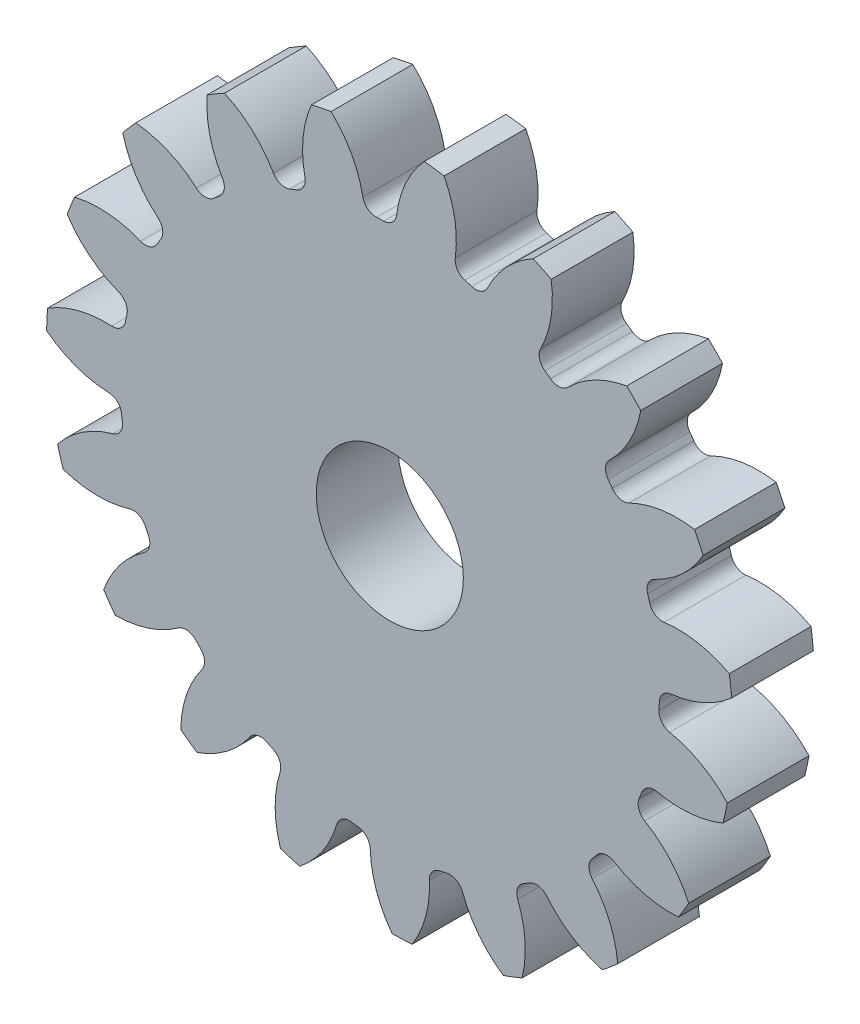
ISO-10303-21;
HEADER;
FILE_DESCRIPTION(('STEP AP214'),'2;1');
FILE_NAME('part.step','',(''),(''),'','','');
FILE_SCHEMA(('AUTOMOTIVE_DESIGN { 1 0 10303 214 1 1 1 1 }'));
ENDSEC;
DATA;
#1=APPLICATION_CONTEXT('core data for automotive mechanical design processes');
#2=APPLICATION_PROTOCOL_DEFINITION('international standard','automotive_design',2000,#1);
#3=PRODUCT_CONTEXT('',#1,'mechanical');
#4=PRODUCT('Part','Part','',(#3));
#5=PRODUCT_RELATED_PRODUCT_CATEGORY('part','',(#4));
#6=PRODUCT_DEFINITION_FORMATION('','',#4);
#7=PRODUCT_DEFINITION_CONTEXT('part definition',#1,'design');
#8=PRODUCT_DEFINITION('design','',#6,#7);
#9=PRODUCT_DEFINITION_SHAPE('','',#8);
#10=(LENGTH_UNIT() NAMED_UNIT(*) SI_UNIT(.MILLI.,.METRE.));
#11=(NAMED_UNIT(*) PLANE_ANGLE_UNIT() SI_UNIT($,.RADIAN.));
#12=(NAMED_UNIT(*) SI_UNIT($,.STERADIAN.) SOLID_ANGLE_UNIT());
#13=UNCERTAINTY_MEASURE_WITH_UNIT(LENGTH_MEASURE(1.E-05),#10,'distance_accuracy_value','');
#14=(GEOMETRIC_REPRESENTATION_CONTEXT(3) GLOBAL_UNCERTAINTY_ASSIGNED_CONTEXT((#13)) GLOBAL_UNIT_ASSIGNED_CONTEXT((#10,
#11,#12)) REPRESENTATION_CONTEXT('',''));
#15=CARTESIAN_POINT('',(0.,0.,0.));
#16=DIRECTION('',(0.,0.,1.));
#17=DIRECTION('',(1.,0.,0.));
#18=AXIS2_PLACEMENT_3D('',#15,#16,#17);
#19=CARTESIAN_POINT('',(0.,0.,127.));
#20=DIRECTION('',(0.,0.,-1.));
#21=DIRECTION('',(-1.,0.,0.));
#22=AXIS2_PLACEMENT_3D('',#19,#20,#21);
#23=CYLINDRICAL_SURFACE('',#22,533.4);
#24=DIRECTION('',(0.,0.,-1.));
#25=VECTOR('',#24,1.);
#26=CARTESIAN_POINT('',(527.601653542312,78.4350379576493,63.5));
#27=LINE('',#26,#25);
#28=CARTESIAN_POINT('',(527.601653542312,78.4350379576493,127.));
#29=VERTEX_POINT('',#28);
#30=CARTESIAN_POINT('',(527.601653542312,78.4350379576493,0.));
#31=VERTEX_POINT('',#30);
#32=EDGE_CURVE('E780',#29,#31,#27,.T.);
#33=ORIENTED_EDGE('',*,*,#32,.F.);
#34=CARTESIAN_POINT('',(0.,0.,127.));
#35=DIRECTION('',(0.,0.,1.));
#36=DIRECTION('',(1.,0.,0.));
#37=AXIS2_PLACEMENT_3D('',#34,#35,#36);
#38=CIRCLE('',#37,533.4);
#39=CARTESIAN_POINT('',(531.279263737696,47.517406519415,127.));
#40=VERTEX_POINT('',#39);
#41=EDGE_CURVE('E1463',#40,#29,#38,.T.);
#42=ORIENTED_EDGE('',*,*,#41,.F.);
#43=DIRECTION('',(0.,0.,-1.));
#44=VECTOR('',#43,1.);
#45=CARTESIAN_POINT('',(531.279263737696,47.517406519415,63.5));
#46=LINE('',#45,#44);
#47=CARTESIAN_POINT('',(531.279263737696,47.517406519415,0.));
#48=VERTEX_POINT('',#47);
#49=EDGE_CURVE('E1457',#48,#40,#46,.F.);
#50=ORIENTED_EDGE('',*,*,#49,.F.);
#51=CARTESIAN_POINT('',(0.,0.,0.));
#52=DIRECTION('',(0.,0.,1.));
#53=DIRECTION('',(1.,0.,0.));
#54=AXIS2_PLACEMENT_3D('',#51,#52,#53);
#55=CIRCLE('',#54,533.4);
#56=EDGE_CURVE('E1468',#48,#31,#55,.T.);
#57=ORIENTED_EDGE('',*,*,#56,.T.);
#58=EDGE_LOOP('',(#33,#42,#50,#57));
#59=FACE_BOUND('',#58,.T.);
#60=ADVANCED_FACE('F33',(#59),#23,.T.);
#61=DIRECTION('',(0.,0.,-1.));
#62=VECTOR('',#61,1.);
#63=CARTESIAN_POINT('',(487.064211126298,217.448877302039,63.5));
#64=LINE('',#63,#62);
#65=CARTESIAN_POINT('',(487.064211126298,217.448877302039,0.));
#66=VERTEX_POINT('',#65);
#67=CARTESIAN_POINT('',(487.064211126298,217.448877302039,127.));
#68=VERTEX_POINT('',#67);
#69=EDGE_CURVE('E751',#66,#68,#64,.F.);
#70=ORIENTED_EDGE('',*,*,#69,.F.);
#71=CARTESIAN_POINT('',(473.546925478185,245.497188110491,0.));
#72=VERTEX_POINT('',#71);
#73=EDGE_CURVE('E1471',#66,#72,#55,.T.);
#74=ORIENTED_EDGE('',*,*,#73,.T.);
#75=DIRECTION('',(0.,0.,-1.));
#76=VECTOR('',#75,1.);
#77=CARTESIAN_POINT('',(473.546925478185,245.497188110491,63.5));
#78=LINE('',#77,#76);
#79=CARTESIAN_POINT('',(473.546925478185,245.497188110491,127.));
#80=VERTEX_POINT('',#79);
#81=EDGE_CURVE('E813',#80,#72,#78,.T.);
#82=ORIENTED_EDGE('',*,*,#81,.F.);
#83=EDGE_CURVE('E1466',#68,#80,#38,.T.);
#84=ORIENTED_EDGE('',*,*,#83,.F.);
#85=EDGE_LOOP('',(#70,#74,#82,#84));
#86=FACE_BOUND('',#85,.T.);
#87=ADVANCED_FACE('F1686',(#86),#23,.T.);
#88=CARTESIAN_POINT('',(0.,0.,127.));
#89=DIRECTION('',(0.,0.,1.));
#90=DIRECTION('',(1.,0.,0.));
#91=AXIS2_PLACEMENT_3D('',#88,#89,#90);
#92=PLANE('',#91);
#93=CARTESIAN_POINT('',(0.,0.,127.000000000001));
#94=DIRECTION('',(0.,0.,1.));
#95=DIRECTION('',(1.,0.,0.));
#96=AXIS2_PLACEMENT_3D('',#93,#94,#95);
#97=CIRCLE('',#96,114.3);
#98=CARTESIAN_POINT('',(114.3,0.,127.000000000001));
#99=VERTEX_POINT('',#98);
#100=EDGE_CURVE('E768',#99,#99,#97,.T.);
#101=ORIENTED_EDGE('',*,*,#100,.F.);
#102=EDGE_LOOP('',(#101));
#103=FACE_BOUND('',#102,.T.);
#104=ORIENTED_EDGE('',*,*,#41,.T.);
#105=CARTESIAN_POINT('',(447.994738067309,-70.4203607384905,127.));
#106=DIRECTION('',(0.,0.,-1.));
#107=DIRECTION('',(0.945817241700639,0.32469946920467,0.));
#108=AXIS2_PLACEMENT_3D('',#105,#106,#107);
#109=CIRCLE('',#108,168.805185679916);
#110=CARTESIAN_POINT('',(426.427564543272,97.0014052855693,127.));
#111=VERTEX_POINT('',#110);
#112=EDGE_CURVE('E760',#111,#29,#109,.T.);
#113=ORIENTED_EDGE('',*,*,#112,.F.);
#114=CARTESIAN_POINT('',(423.785973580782,117.507561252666,127.));
#115=DIRECTION('',(0.,0.,1.));
#116=DIRECTION('',(-0.945817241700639,-0.32469946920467,0.));
#117=AXIS2_PLACEMENT_3D('',#114,#115,#116);
#118=CIRCLE('',#117,20.6756000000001);
#119=CARTESIAN_POINT('',(403.862109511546,111.983063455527,127.));
#120=VERTEX_POINT('',#119);
#121=EDGE_CURVE('E758',#120,#111,#118,.T.);
#122=ORIENTED_EDGE('',*,*,#121,.F.);
#123=CARTESIAN_POINT('',(0.,0.,127.));
#124=DIRECTION('',(0.,0.,-1.));
#125=DIRECTION('',(0.945817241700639,0.32469946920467,0.));
#126=AXIS2_PLACEMENT_3D('',#123,#124,#125);
#127=CIRCLE('',#126,419.1);
#128=CARTESIAN_POINT('',(400.752061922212,122.648256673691,127.));
#129=VERTEX_POINT('',#128);
#130=EDGE_CURVE('E743',#129,#120,#127,.T.);
#131=ORIENTED_EDGE('',*,*,#130,.F.);
#132=CARTESIAN_POINT('',(420.522496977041,128.698904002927,127.));
#133=DIRECTION('',(0.,0.,1.));
#134=DIRECTION('',(-0.945817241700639,-0.32469946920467,0.));
#135=AXIS2_PLACEMENT_3D('',#132,#133,#134);
#136=CIRCLE('',#135,20.6756000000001);
#137=CARTESIAN_POINT('',(411.72782651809,147.410777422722,127.));
#138=VERTEX_POINT('',#137);
#139=EDGE_CURVE('E735',#138,#129,#136,.T.);
#140=ORIENTED_EDGE('',*,*,#139,.F.);
#141=CARTESIAN_POINT('',(339.924058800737,300.183188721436,127.));
#142=DIRECTION('',(0.,0.,-1.));
#143=DIRECTION('',(-0.945817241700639,-0.32469946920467,0.));
#144=AXIS2_PLACEMENT_3D('',#141,#142,#143);
#145=CIRCLE('',#144,168.805185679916);
#146=EDGE_CURVE('E765',#68,#138,#145,.T.);
#147=ORIENTED_EDGE('',*,*,#146,.F.);
#148=ORIENTED_EDGE('',*,*,#83,.T.);
#149=CARTESIAN_POINT('',(446.586601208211,78.8588623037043,127.));
#150=DIRECTION('',(0.,0.,-1.));
#151=DIRECTION('',(0.789140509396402,0.614212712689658,0.));
#152=AXIS2_PLACEMENT_3D('',#149,#150,#151);
#153=CIRCLE('',#152,168.805185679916);
#154=CARTESIAN_POINT('',(371.826238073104,230.206405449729,127.));
#155=VERTEX_POINT('',#154);
#156=EDGE_CURVE('E789',#155,#80,#153,.T.);
#157=ORIENTED_EDGE('',*,*,#156,.F.);
#158=CARTESIAN_POINT('',(362.669437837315,248.743758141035,127.));
#159=DIRECTION('',(0.,0.,1.));
#160=DIRECTION('',(-0.789140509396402,-0.614212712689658,0.));
#161=AXIS2_PLACEMENT_3D('',#158,#159,#160);
#162=CIRCLE('',#161,20.6756000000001);
#163=CARTESIAN_POINT('',(345.618905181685,237.049324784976,127.));
#164=VERTEX_POINT('',#163);
#165=EDGE_CURVE('E787',#164,#155,#162,.T.);
#166=ORIENTED_EDGE('',*,*,#165,.F.);
#167=CARTESIAN_POINT('',(0.,0.,127.));
#168=DIRECTION('',(0.,0.,-1.));
#169=DIRECTION('',(0.789140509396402,0.614212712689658,0.));
#170=AXIS2_PLACEMENT_3D('',#167,#168,#169);
#171=CIRCLE('',#170,419.1);
#172=CARTESIAN_POINT('',(339.214385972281,246.126817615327,127.));
#173=VERTEX_POINT('',#172);
#174=EDGE_CURVE('E784',#173,#164,#171,.T.);
#175=ORIENTED_EDGE('',*,*,#174,.F.);
#176=CARTESIAN_POINT('',(355.948962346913,258.269073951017,127.));
#177=DIRECTION('',(0.,0.,1.));
#178=DIRECTION('',(-0.789140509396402,-0.614212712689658,0.));
#179=AXIS2_PLACEMENT_3D('',#176,#177,#178);
#180=CIRCLE('',#179,20.6756000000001);
#181=CARTESIAN_POINT('',(341.555076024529,273.111461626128,127.));
#182=VERTEX_POINT('',#181);
#183=EDGE_CURVE('E782',#182,#173,#180,.T.);
#184=ORIENTED_EDGE('',*,*,#183,.F.);
#185=CARTESIAN_POINT('',(224.036713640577,394.291597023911,127.));
#186=DIRECTION('',(0.,0.,-1.));
#187=DIRECTION('',(-0.789140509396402,-0.614212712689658,0.));
#188=AXIS2_PLACEMENT_3D('',#185,#186,#187);
#189=CIRCLE('',#188,168.805185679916);
#190=CARTESIAN_POINT('',(390.068193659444,363.816388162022,127.));
#191=VERTEX_POINT('',#190);
#192=EDGE_CURVE('E792',#191,#182,#189,.T.);
#193=ORIENTED_EDGE('',*,*,#192,.F.);
#194=CARTESIAN_POINT('',(368.176040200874,385.955908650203,127.));
#195=VERTEX_POINT('',#194);
#196=EDGE_CURVE('E1517',#191,#195,#38,.T.);
#197=ORIENTED_EDGE('',*,*,#196,.T.);
#198=CARTESIAN_POINT('',(396.783876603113,219.59250399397,127.));
#199=DIRECTION('',(0.,0.,-1.));
#200=DIRECTION('',(0.546948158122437,0.837166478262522,0.));
#201=AXIS2_PLACEMENT_3D('',#198,#199,#200);
#202=CIRCLE('',#201,168.805185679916);
#203=CARTESIAN_POINT('',(276.931769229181,338.464969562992,127.));
#204=VERTEX_POINT('',#203);
#205=EDGE_CURVE('E824',#204,#195,#202,.T.);
#206=ORIENTED_EDGE('',*,*,#205,.F.);
#207=CARTESIAN_POINT('',(262.252041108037,353.024709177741,127.));
#208=DIRECTION('',(0.,0.,1.));
#209=DIRECTION('',(-0.546948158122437,-0.837166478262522,0.));
#210=AXIS2_PLACEMENT_3D('',#207,#208,#209);
#211=CIRCLE('',#210,20.6756000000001);
#212=CARTESIAN_POINT('',(249.922529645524,336.427613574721,127.));
#213=VERTEX_POINT('',#212);
#214=EDGE_CURVE('E822',#213,#204,#211,.T.);
#215=ORIENTED_EDGE('',*,*,#214,.F.);
#216=CARTESIAN_POINT('',(0.,0.,127.));
#217=DIRECTION('',(0.,0.,-1.));
#218=DIRECTION('',(0.546948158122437,0.837166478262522,0.));
#219=AXIS2_PLACEMENT_3D('',#216,#217,#218);
#220=CIRCLE('',#219,419.1);
#221=CARTESIAN_POINT('',(240.917567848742,342.933718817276,127.));
#222=VERTEX_POINT('',#221);
#223=EDGE_CURVE('E819',#222,#213,#220,.T.);
#224=ORIENTED_EDGE('',*,*,#223,.F.);
#225=CARTESIAN_POINT('',(252.80283452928,359.851782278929,127.));
#226=DIRECTION('',(0.,0.,1.));
#227=DIRECTION('',(-0.546948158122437,-0.837166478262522,0.));
#228=AXIS2_PLACEMENT_3D('',#225,#226,#227);
#229=CIRCLE('',#228,20.6756000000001);
#230=CARTESIAN_POINT('',(234.369533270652,369.216281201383,127.));
#231=VERTEX_POINT('',#230);
#232=EDGE_CURVE('E817',#231,#222,#229,.T.);
#233=ORIENTED_EDGE('',*,*,#232,.F.);
#234=CARTESIAN_POINT('',(83.8715142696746,445.672392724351,127.));
#235=DIRECTION('',(0.,0.,-1.));
#236=DIRECTION('',(-0.546948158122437,-0.837166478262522,0.));
#237=AXIS2_PLACEMENT_3D('',#234,#235,#236);
#238=CIRCLE('',#237,168.805185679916);
#239=CARTESIAN_POINT('',(250.80223487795,470.758748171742,127.));
#240=VERTEX_POINT('',#239);
#241=EDGE_CURVE('E827',#240,#231,#238,.T.);
#242=ORIENTED_EDGE('',*,*,#241,.F.);
#243=CARTESIAN_POINT('',(222.90756812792,484.590317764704,127.));
#244=VERTEX_POINT('',#243);
#245=EDGE_CURVE('E1668',#240,#244,#38,.T.);
#246=ORIENTED_EDGE('',*,*,#245,.T.);
#247=CARTESIAN_POINT('',(303.983462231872,336.52989054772,127.));
#248=DIRECTION('',(0.,0.,-1.));
#249=DIRECTION('',(0.24548548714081,0.969400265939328,0.));
#250=AXIS2_PLACEMENT_3D('',#247,#248,#249);
#251=CIRCLE('',#250,168.805185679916);
#252=CARTESIAN_POINT('',(152.027446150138,410.045602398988,127.));
#253=VERTEX_POINT('',#252);
#254=EDGE_CURVE('E862',#253,#244,#251,.T.);
#255=ORIENTED_EDGE('',*,*,#254,.F.);
#256=CARTESIAN_POINT('',(133.415566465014,419.049955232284,127.));
#257=DIRECTION('',(0.,0.,1.));
#258=DIRECTION('',(-0.24548548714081,-0.969400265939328,0.));
#259=AXIS2_PLACEMENT_3D('',#256,#257,#258);
#260=CIRCLE('',#259,20.6756000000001);
#261=CARTESIAN_POINT('',(127.143170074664,399.348750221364,127.));
#262=VERTEX_POINT('',#261);
#263=EDGE_CURVE('E860',#262,#253,#260,.T.);
#264=ORIENTED_EDGE('',*,*,#263,.F.);
#265=CARTESIAN_POINT('',(0.,0.,127.));
#266=DIRECTION('',(0.,0.,-1.));
#267=DIRECTION('',(0.24548548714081,0.969400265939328,0.));
#268=AXIS2_PLACEMENT_3D('',#265,#266,#267);
#269=CIRCLE('',#268,419.1);
#270=CARTESIAN_POINT('',(116.513593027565,402.578430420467,127.));
#271=VERTEX_POINT('',#270);
#272=EDGE_CURVE('E857',#271,#262,#269,.T.);
#273=ORIENTED_EDGE('',*,*,#272,.F.);
#274=CARTESIAN_POINT('',(122.261596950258,422.438966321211,127.));
#275=DIRECTION('',(0.,0.,1.));
#276=DIRECTION('',(-0.24548548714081,-0.969400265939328,0.));
#277=AXIS2_PLACEMENT_3D('',#274,#275,#276);
#278=CIRCLE('',#277,20.6756000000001);
#279=CARTESIAN_POINT('',(101.786414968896,425.310787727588,127.));
#280=VERTEX_POINT('',#279);
#281=EDGE_CURVE('E855',#280,#271,#278,.T.);
#282=ORIENTED_EDGE('',*,*,#281,.F.);
#283=CARTESIAN_POINT('',(-65.3824650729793,448.757669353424,127.));
#284=DIRECTION('',(0.,0.,-1.));
#285=DIRECTION('',(-0.24548548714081,-0.969400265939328,0.));
#286=AXIS2_PLACEMENT_3D('',#283,#284,#285);
#287=CIRCLE('',#286,168.805185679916);
#288=CARTESIAN_POINT('',(84.3579623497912,526.687093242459,127.));
#289=VERTEX_POINT('',#288);
#290=EDGE_CURVE('E865',#289,#280,#287,.T.);
#291=ORIENTED_EDGE('',*,*,#290,.F.);
#292=CARTESIAN_POINT('',(53.483602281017,530.711846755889,127.));
#293=VERTEX_POINT('',#292);
#294=EDGE_CURVE('E1664',#289,#293,#38,.T.);
#295=ORIENTED_EDGE('',*,*,#294,.T.);
#296=CARTESIAN_POINT('',(178.241722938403,416.999041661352,127.));
#297=DIRECTION('',(0.,0.,-1.));
#298=DIRECTION('',(-0.0825793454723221,0.996584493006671,0.));
#299=AXIS2_PLACEMENT_3D('',#296,#297,#298);
#300=CIRCLE('',#299,168.805185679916);
#301=CARTESIAN_POINT('',(10.6485903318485,437.191431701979,127.));
#302=VERTEX_POINT('',#301);
#303=EDGE_CURVE('E900',#302,#293,#300,.T.);
#304=ORIENTED_EDGE('',*,*,#303,.F.);
#305=CARTESIAN_POINT('',(-9.87855496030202,439.664636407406,127.));
#306=DIRECTION('',(0.,0.,1.));
#307=DIRECTION('',(0.0825793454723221,-0.996584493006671,0.));
#308=AXIS2_PLACEMENT_3D('',#305,#306,#307);
#309=CIRCLE('',#308,20.6756000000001);
#310=CARTESIAN_POINT('',(-9.4141248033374,418.99425324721,127.));
#311=VERTEX_POINT('',#310);
#312=EDGE_CURVE('E898',#311,#302,#309,.T.);
#313=ORIENTED_EDGE('',*,*,#312,.F.);
#314=CARTESIAN_POINT('',(0.,0.,127.));
#315=DIRECTION('',(0.,0.,-1.));
#316=DIRECTION('',(-0.0825793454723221,0.996584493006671,0.));
#317=AXIS2_PLACEMENT_3D('',#314,#315,#316);
#318=CIRCLE('',#317,419.1);
#319=CARTESIAN_POINT('',(-20.516437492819,418.597522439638,127.));
#320=VERTEX_POINT('',#319);
#321=EDGE_CURVE('E895',#320,#311,#318,.T.);
#322=ORIENTED_EDGE('',*,*,#321,.F.);
#323=CARTESIAN_POINT('',(-21.5285817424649,439.24833354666,127.));
#324=DIRECTION('',(0.,0.,1.));
#325=DIRECTION('',(0.0825793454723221,-0.996584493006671,0.));
#326=AXIS2_PLACEMENT_3D('',#323,#324,#325);
#327=CIRCLE('',#326,20.6756000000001);
#328=CARTESIAN_POINT('',(-41.8268407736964,435.31627102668,127.));
#329=VERTEX_POINT('',#328);
#330=EDGE_CURVE('E893',#329,#320,#327,.T.);
#331=ORIENTED_EDGE('',*,*,#330,.F.);
#332=CARTESIAN_POINT('',(-207.551239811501,403.213089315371,127.));
#333=DIRECTION('',(0.,0.,-1.));
#334=DIRECTION('',(0.0825793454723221,-0.996584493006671,0.));
#335=AXIS2_PLACEMENT_3D('',#332,#333,#334);
#336=CIRCLE('',#335,168.805185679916);
#337=CARTESIAN_POINT('',(-91.2278043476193,525.540719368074,127.));
#338=VERTEX_POINT('',#337);
#339=EDGE_CURVE('E903',#338,#329,#336,.T.);
#340=ORIENTED_EDGE('',*,*,#339,.F.);
#341=CARTESIAN_POINT('',(-121.736141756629,519.322512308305,127.));
#342=VERTEX_POINT('',#341);
#343=EDGE_CURVE('E1660',#338,#342,#38,.T.);
#344=ORIENTED_EDGE('',*,*,#343,.T.);
#345=CARTESIAN_POINT('',(33.1847272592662,452.279876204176,127.));
#346=DIRECTION('',(0.,0.,-1.));
#347=DIRECTION('',(-0.40169542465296,0.915773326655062,0.));
#348=AXIS2_PLACEMENT_3D('',#345,#346,#347);
#349=CIRCLE('',#348,168.805185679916);
#350=CARTESIAN_POINT('',(-131.884205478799,416.960785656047,127.));
#351=VERTEX_POINT('',#350);
#352=EDGE_CURVE('E938',#351,#342,#349,.T.);
#353=ORIENTED_EDGE('',*,*,#352,.F.);
#354=CARTESIAN_POINT('',(-152.102181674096,412.634832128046,127.));
#355=DIRECTION('',(0.,0.,1.));
#356=DIRECTION('',(0.40169542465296,-0.915773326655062,0.));
#357=AXIS2_PLACEMENT_3D('',#354,#355,#356);
#358=CIRCLE('',#357,20.6756000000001);
#359=CARTESIAN_POINT('',(-144.9512531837,393.235227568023,127.));
#360=VERTEX_POINT('',#359);
#361=EDGE_CURVE('E936',#360,#351,#358,.T.);
#362=ORIENTED_EDGE('',*,*,#361,.F.);
#363=CARTESIAN_POINT('',(0.,0.,127.));
#364=DIRECTION('',(0.,0.,-1.));
#365=DIRECTION('',(-0.40169542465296,0.915773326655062,0.));
#366=AXIS2_PLACEMENT_3D('',#363,#364,#365);
#367=CIRCLE('',#366,419.1);
#368=CARTESIAN_POINT('',(-155.323193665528,389.255077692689,127.));
#369=VERTEX_POINT('',#368);
#370=EDGE_CURVE('E933',#369,#360,#367,.T.);
#371=ORIENTED_EDGE('',*,*,#370,.F.);
#372=CARTESIAN_POINT('',(-162.985804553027,408.458328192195,127.));
#373=DIRECTION('',(0.,0.,1.));
#374=DIRECTION('',(0.40169542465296,-0.915773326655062,0.));
#375=AXIS2_PLACEMENT_3D('',#372,#373,#374);
#376=CIRCLE('',#375,20.6756000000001);
#377=CARTESIAN_POINT('',(-180.907509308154,398.148481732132,127.));
#378=VERTEX_POINT('',#377);
#379=EDGE_CURVE('E931',#378,#369,#376,.T.);
#380=ORIENTED_EDGE('',*,*,#379,.F.);
#381=CARTESIAN_POINT('',(-327.228617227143,313.974114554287,127.));
#382=DIRECTION('',(0.,0.,-1.));
#383=DIRECTION('',(0.40169542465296,-0.915773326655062,0.));
#384=AXIS2_PLACEMENT_3D('',#381,#382,#383);
#385=CIRCLE('',#384,168.805185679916);
#386=CARTESIAN_POINT('',(-256.927622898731,467.443853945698,127.));
#387=VERTEX_POINT('',#386);
#388=EDGE_CURVE('E941',#387,#378,#385,.T.);
#389=ORIENTED_EDGE('',*,*,#388,.F.);
#390=CARTESIAN_POINT('',(-283.763885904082,451.656525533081,127.));
#391=VERTEX_POINT('',#390);
#392=EDGE_CURVE('E1656',#387,#391,#38,.T.);
#393=ORIENTED_EDGE('',*,*,#392,.T.);
#394=CARTESIAN_POINT('',(-115.468348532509,438.549168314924,127.));
#395=DIRECTION('',(0.,0.,-1.));
#396=DIRECTION('',(-0.677281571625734,0.735723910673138,0.));
#397=AXIS2_PLACEMENT_3D('',#394,#395,#396);
#398=CIRCLE('',#397,168.805185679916);
#399=CARTESIAN_POINT('',(-260.125301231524,351.545968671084,127.));
#400=VERTEX_POINT('',#399);
#401=EDGE_CURVE('E976',#400,#391,#398,.T.);
#402=ORIENTED_EDGE('',*,*,#401,.F.);
#403=CARTESIAN_POINT('',(-277.843176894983,340.889641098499,127.));
#404=DIRECTION('',(0.,0.,1.));
#405=DIRECTION('',(0.677281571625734,-0.735723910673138,0.));
#406=AXIS2_PLACEMENT_3D('',#403,#404,#405);
#407=CIRCLE('',#406,20.6756000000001);
#408=CARTESIAN_POINT('',(-264.780664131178,324.863063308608,127.));
#409=VERTEX_POINT('',#408);
#410=EDGE_CURVE('E974',#409,#400,#407,.T.);
#411=ORIENTED_EDGE('',*,*,#410,.F.);
#412=CARTESIAN_POINT('',(0.,0.,127.));
#413=DIRECTION('',(0.,0.,-1.));
#414=DIRECTION('',(-0.677281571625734,0.735723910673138,0.));
#415=AXIS2_PLACEMENT_3D('',#412,#413,#414);
#416=CIRCLE('',#415,419.1);
#417=CARTESIAN_POINT('',(-273.298271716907,317.730805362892,127.));
#418=VERTEX_POINT('',#417);
#419=EDGE_CURVE('E971',#418,#409,#416,.T.);
#420=ORIENTED_EDGE('',*,*,#419,.F.);
#421=CARTESIAN_POINT('',(-286.780986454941,333.405525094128,127.));
#422=DIRECTION('',(0.,0.,1.));
#423=DIRECTION('',(0.677281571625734,-0.735723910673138,0.));
#424=AXIS2_PLACEMENT_3D('',#421,#422,#423);
#425=CIRCLE('',#424,20.6756000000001);
#426=CARTESIAN_POINT('',(-300.384042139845,317.835126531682,127.));
#427=VERTEX_POINT('',#426);
#428=EDGE_CURVE('E969',#427,#418,#425,.T.);
#429=ORIENTED_EDGE('',*,*,#428,.F.);
#430=CARTESIAN_POINT('',(-411.445696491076,190.711172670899,127.));
#431=DIRECTION('',(0.,0.,-1.));
#432=DIRECTION('',(0.677281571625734,-0.735723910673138,0.));
#433=AXIS2_PLACEMENT_3D('',#430,#431,#432);
#434=CIRCLE('',#433,168.805185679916);
#435=CARTESIAN_POINT('',(-394.785346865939,358.692193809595,127.));
#436=VERTEX_POINT('',#435);
#437=EDGE_CURVE('E979',#436,#427,#434,.T.);
#438=ORIENTED_EDGE('',*,*,#437,.F.);
#439=CARTESIAN_POINT('',(-415.041409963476,335.046546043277,127.));
#440=VERTEX_POINT('',#439);
#441=EDGE_CURVE('E1652',#436,#440,#38,.T.);
#442=ORIENTED_EDGE('',*,*,#441,.T.);
#443=CARTESIAN_POINT('',(-251.608637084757,377.294853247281,127.));
#444=DIRECTION('',(0.,0.,-1.));
#445=DIRECTION('',(-0.879473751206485,0.475947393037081,0.));
#446=AXIS2_PLACEMENT_3D('',#443,#444,#445);
#447=CIRCLE('',#446,168.805185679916);
#448=CARTESIAN_POINT('',(-360.177784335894,248.035691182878,127.));
#449=VERTEX_POINT('',#448);
#450=EDGE_CURVE('E1014',#449,#440,#447,.T.);
#451=ORIENTED_EDGE('',*,*,#450,.F.);
#452=CARTESIAN_POINT('',(-373.475552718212,232.203768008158,127.));
#453=DIRECTION('',(0.,0.,1.));
#454=DIRECTION('',(0.879473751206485,-0.475947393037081,0.));
#455=AXIS2_PLACEMENT_3D('',#452,#453,#454);
#456=CIRCLE('',#455,20.6756000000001);
#457=CARTESIAN_POINT('',(-355.916981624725,221.286945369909,127.));
#458=VERTEX_POINT('',#457);
#459=EDGE_CURVE('E1012',#458,#449,#456,.T.);
#460=ORIENTED_EDGE('',*,*,#459,.F.);
#461=CARTESIAN_POINT('',(0.,0.,127.));
#462=DIRECTION('',(0.,0.,-1.));
#463=DIRECTION('',(-0.879473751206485,0.475947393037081,0.));
#464=AXIS2_PLACEMENT_3D('',#461,#462,#463);
#465=CIRCLE('',#464,419.1);
#466=CARTESIAN_POINT('',(-361.657241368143,211.775470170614,127.));
#467=VERTEX_POINT('',#466);
#468=EDGE_CURVE('E1009',#467,#458,#465,.T.);
#469=ORIENTED_EDGE('',*,*,#468,.F.);
#470=CARTESIAN_POINT('',(-379.498998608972,222.223060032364,127.));
#471=DIRECTION('',(0.,0.,1.));
#472=DIRECTION('',(0.879473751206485,-0.475947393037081,0.));
#473=AXIS2_PLACEMENT_3D('',#470,#471,#472);
#474=CIRCLE('',#473,20.6756000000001);
#475=CARTESIAN_POINT('',(-387.309303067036,203.079403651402,127.));
#476=VERTEX_POINT('',#475);
#477=EDGE_CURVE('E1007',#476,#467,#474,.T.);
#478=ORIENTED_EDGE('',*,*,#477,.F.);
#479=CARTESIAN_POINT('',(-451.07625030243,46.7817160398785,127.));
#480=DIRECTION('',(0.,0.,-1.));
#481=DIRECTION('',(0.879473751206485,-0.475947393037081,0.));
#482=AXIS2_PLACEMENT_3D('',#479,#480,#481);
#483=CIRCLE('',#482,168.805185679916);
#484=CARTESIAN_POINT('',(-489.86195277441,211.070668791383,127.));
#485=VERTEX_POINT('',#484);
#486=EDGE_CURVE('E1017',#485,#476,#483,.T.);
#487=ORIENTED_EDGE('',*,*,#486,.F.);
#488=CARTESIAN_POINT('',(-501.342757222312,182.129074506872,127.));
#489=VERTEX_POINT('',#488);
#490=EDGE_CURVE('E1648',#485,#489,#38,.T.);
#491=ORIENTED_EDGE('',*,*,#490,.T.);
#492=CARTESIAN_POINT('',(-360.483225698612,275.154786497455,127.));
#493=DIRECTION('',(0.,0.,-1.));
#494=DIRECTION('',(-0.986361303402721,0.164594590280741,0.));
#495=AXIS2_PLACEMENT_3D('',#492,#493,#494);
#496=CIRCLE('',#495,168.805185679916);
#497=CARTESIAN_POINT('',(-421.199415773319,117.646897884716,127.));
#498=VERTEX_POINT('',#497);
#499=EDGE_CURVE('E1052',#498,#489,#496,.T.);
#500=ORIENTED_EDGE('',*,*,#499,.F.);
#501=CARTESIAN_POINT('',(-428.636057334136,98.3550136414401,127.));
#502=DIRECTION('',(0.,0.,1.));
#503=DIRECTION('',(0.986361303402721,-0.164594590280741,0.));
#504=AXIS2_PLACEMENT_3D('',#501,#502,#503);
#505=CIRCLE('',#504,20.6756000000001);
#506=CARTESIAN_POINT('',(-408.484171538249,93.7309532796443,127.));
#507=VERTEX_POINT('',#506);
#508=EDGE_CURVE('E1050',#507,#498,#505,.T.);
#509=ORIENTED_EDGE('',*,*,#508,.F.);
#510=CARTESIAN_POINT('',(0.,0.,127.));
#511=DIRECTION('',(0.,0.,-1.));
#512=DIRECTION('',(-0.986361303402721,0.164594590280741,0.));
#513=AXIS2_PLACEMENT_3D('',#510,#511,#512);
#514=CIRCLE('',#513,419.1);
#515=CARTESIAN_POINT('',(-410.825037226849,82.8709767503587,127.));
#516=VERTEX_POINT('',#515);
#517=EDGE_CURVE('E1047',#516,#507,#514,.T.);
#518=ORIENTED_EDGE('',*,*,#517,.F.);
#519=CARTESIAN_POINT('',(-431.09240573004,86.9592782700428,127.));
#520=DIRECTION('',(0.,0.,1.));
#521=DIRECTION('',(0.986361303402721,-0.164594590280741,0.));
#522=AXIS2_PLACEMENT_3D('',#519,#520,#521);
#523=CIRCLE('',#522,20.6756000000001);
#524=CARTESIAN_POINT('',(-432.263591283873,66.3168762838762,127.));
#525=VERTEX_POINT('',#524);
#526=EDGE_CURVE('E1045',#525,#516,#523,.T.);
#527=ORIENTED_EDGE('',*,*,#526,.F.);
#528=CARTESIAN_POINT('',(-441.825693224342,-102.217265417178,127.));
#529=DIRECTION('',(0.,0.,-1.));
#530=DIRECTION('',(0.986361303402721,-0.164594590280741,0.));
#531=AXIS2_PLACEMENT_3D('',#528,#529,#530);
#532=CIRCLE('',#531,168.805185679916);
#533=CARTESIAN_POINT('',(-531.854415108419,40.5763617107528,127.));
#534=VERTEX_POINT('',#533);
#535=EDGE_CURVE('E1055',#534,#525,#532,.T.);
#536=ORIENTED_EDGE('',*,*,#535,.F.);
#537=CARTESIAN_POINT('',(-533.31583760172,9.47509172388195,127.));
#538=VERTEX_POINT('',#537);
#539=EDGE_CURVE('E1644',#534,#538,#38,.T.);
#540=ORIENTED_EDGE('',*,*,#539,.T.);
#541=CARTESIAN_POINT('',(-430.29386333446,143.197429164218,127.));
#542=DIRECTION('',(0.,0.,-1.));
#543=DIRECTION('',(-0.986361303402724,-0.164594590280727,0.));
#544=AXIS2_PLACEMENT_3D('',#541,#542,#543);
#545=CIRCLE('',#544,168.805185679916);
#546=CARTESIAN_POINT('',(-436.577554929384,-25.4907622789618,127.));
#547=VERTEX_POINT('',#546);
#548=EDGE_CURVE('E1090',#547,#538,#545,.T.);
#549=ORIENTED_EDGE('',*,*,#548,.F.);
#550=CARTESIAN_POINT('',(-437.347194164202,-46.1520325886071,127.));
#551=DIRECTION('',(0.,0.,1.));
#552=DIRECTION('',(0.986361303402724,0.164594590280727,0.));
#553=AXIS2_PLACEMENT_3D('',#550,#551,#552);
#554=CIRCLE('',#553,20.6756000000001);
#555=CARTESIAN_POINT('',(-416.785763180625,-43.9822419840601,127.));
#556=VERTEX_POINT('',#555);
#557=EDGE_CURVE('E1088',#556,#547,#554,.T.);
#558=ORIENTED_EDGE('',*,*,#557,.F.);
#559=CARTESIAN_POINT('',(0.,0.,127.));
#560=DIRECTION('',(0.,0.,-1.));
#561=DIRECTION('',(-0.986361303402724,-0.164594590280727,0.));
#562=AXIS2_PLACEMENT_3D('',#559,#560,#561);
#563=CIRCLE('',#562,419.1);
#564=CARTESIAN_POINT('',(-415.473565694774,-55.0138728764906,127.));
#565=VERTEX_POINT('',#564);
#566=EDGE_CURVE('E1085',#565,#556,#563,.T.);
#567=ORIENTED_EDGE('',*,*,#566,.F.);
#568=CARTESIAN_POINT('',(-435.970261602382,-57.7278906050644,127.));
#569=DIRECTION('',(0.,0.,1.));
#570=DIRECTION('',(0.986361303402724,0.164594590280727,0.));
#571=AXIS2_PLACEMENT_3D('',#568,#569,#570);
#572=CIRCLE('',#571,20.6756000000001);
#573=CARTESIAN_POINT('',(-430.37541212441,-77.6321136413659,127.));
#574=VERTEX_POINT('',#573);
#575=EDGE_CURVE('E1083',#574,#565,#572,.T.);
#576=ORIENTED_EDGE('',*,*,#575,.F.);
#577=CARTESIAN_POINT('',(-384.696466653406,-240.139420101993,127.));
#578=DIRECTION('',(0.,0.,-1.));
#579=DIRECTION('',(0.986361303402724,0.164594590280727,0.));
#580=AXIS2_PLACEMENT_3D('',#577,#578,#579);
#581=CIRCLE('',#580,168.805185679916);
#582=CARTESIAN_POINT('',(-516.212198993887,-134.31502376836,127.));
#583=VERTEX_POINT('',#582);
#584=EDGE_CURVE('E1093',#583,#574,#581,.T.);
#585=ORIENTED_EDGE('',*,*,#584,.F.);
#586=CARTESIAN_POINT('',(-507.495871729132,-164.205664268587,127.));
#587=VERTEX_POINT('',#586);
#588=EDGE_CURVE('E1640',#583,#587,#38,.T.);
#589=ORIENTED_EDGE('',*,*,#588,.T.);
#590=CARTESIAN_POINT('',(-453.475484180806,-4.27759155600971,127.));
#591=DIRECTION('',(0.,0.,-1.));
#592=DIRECTION('',(-0.879473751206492,-0.475947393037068,0.));
#593=AXIS2_PLACEMENT_3D('',#590,#591,#592);
#594=CIRCLE('',#593,168.805185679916);
#595=CARTESIAN_POINT('',(-404.645741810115,-165.866102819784,127.));
#596=VERTEX_POINT('',#595);
#597=EDGE_CURVE('E1128',#596,#587,#594,.T.);
#598=ORIENTED_EDGE('',*,*,#597,.F.);
#599=CARTESIAN_POINT('',(-398.664976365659,-185.657789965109,127.));
#600=DIRECTION('',(0.,0.,1.));
#601=DIRECTION('',(0.879473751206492,0.475947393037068,0.));
#602=AXIS2_PLACEMENT_3D('',#599,#600,#601);
#603=CIRCLE('',#602,20.6756000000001);
#604=CARTESIAN_POINT('',(-379.922150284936,-176.929278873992,127.));
#605=VERTEX_POINT('',#604);
#606=EDGE_CURVE('E1126',#605,#596,#603,.T.);
#607=ORIENTED_EDGE('',*,*,#606,.F.);
#608=CARTESIAN_POINT('',(0.,0.,127.));
#609=DIRECTION('',(0.,0.,-1.));
#610=DIRECTION('',(-0.879473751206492,-0.475947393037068,0.));
#611=AXIS2_PLACEMENT_3D('',#608,#609,#610);
#612=CIRCLE('',#611,419.1);
#613=CARTESIAN_POINT('',(-375.099086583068,-186.937115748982,127.));
#614=VERTEX_POINT('',#613);
#615=EDGE_CURVE('E1123',#614,#605,#612,.T.);
#616=ORIENTED_EDGE('',*,*,#615,.F.);
#617=CARTESIAN_POINT('',(-393.603974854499,-196.159346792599,127.));
#618=DIRECTION('',(0.,0.,1.));
#619=DIRECTION('',(0.879473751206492,0.475947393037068,0.));
#620=AXIS2_PLACEMENT_3D('',#617,#618,#619);
#621=CIRCLE('',#620,20.6756000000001);
#622=CARTESIAN_POINT('',(-381.849379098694,-213.16845946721,127.));
#623=VERTEX_POINT('',#622);
#624=EDGE_CURVE('E1121',#623,#614,#621,.T.);
#625=ORIENTED_EDGE('',*,*,#624,.F.);
#626=CARTESIAN_POINT('',(-285.879408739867,-352.038742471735,127.));
#627=DIRECTION('',(0.,0.,-1.));
#628=DIRECTION('',(0.879473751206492,0.475947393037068,0.));
#629=AXIS2_PLACEMENT_3D('',#626,#627,#628);
#630=CIRCLE('',#629,168.805185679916);
#631=CARTESIAN_POINT('',(-444.630381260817,-294.651292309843,127.));
#632=VERTEX_POINT('',#631);
#633=EDGE_CURVE('E1131',#632,#623,#630,.T.);
#634=ORIENTED_EDGE('',*,*,#633,.F.);
#635=CARTESIAN_POINT('',(-426.680853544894,-320.092188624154,127.));
#636=VERTEX_POINT('',#635);
#637=EDGE_CURVE('E1636',#632,#636,#38,.T.);
#638=ORIENTED_EDGE('',*,*,#637,.T.);
#639=CARTESIAN_POINT('',(-427.515999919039,-151.289068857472,127.));
#640=DIRECTION('',(0.,0.,-1.));
#641=DIRECTION('',(-0.677281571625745,-0.735723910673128,0.));
#642=AXIS2_PLACEMENT_3D('',#639,#640,#641);
#643=CIRCLE('',#642,168.805185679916);
#644=CARTESIAN_POINT('',(-328.864283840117,-288.267277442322,127.));
#645=VERTEX_POINT('',#644);
#646=EDGE_CURVE('E1166',#645,#636,#643,.T.);
#647=ORIENTED_EDGE('',*,*,#646,.F.);
#648=CARTESIAN_POINT('',(-316.781222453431,-305.044645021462,127.));
#649=DIRECTION('',(0.,0.,1.));
#650=DIRECTION('',(0.677281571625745,0.735723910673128,0.));
#651=AXIS2_PLACEMENT_3D('',#648,#649,#650);
#652=CIRCLE('',#651,20.6756000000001);
#653=CARTESIAN_POINT('',(-301.888077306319,-290.703283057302,127.));
#654=VERTEX_POINT('',#653);
#655=EDGE_CURVE('E1164',#654,#645,#652,.T.);
#656=ORIENTED_EDGE('',*,*,#655,.F.);
#657=CARTESIAN_POINT('',(0.,0.,127.));
#658=DIRECTION('',(0.,0.,-1.));
#659=DIRECTION('',(-0.677281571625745,-0.735723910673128,0.));
#660=AXIS2_PLACEMENT_3D('',#657,#658,#659);
#661=CIRCLE('',#660,419.1);
#662=CARTESIAN_POINT('',(-294.076801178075,-298.602821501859,127.));
#663=VERTEX_POINT('',#662);
#664=EDGE_CURVE('E1161',#663,#654,#661,.T.);
#665=ORIENTED_EDGE('',*,*,#664,.F.);
#666=CARTESIAN_POINT('',(-308.584590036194,-313.333894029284,127.));
#667=DIRECTION('',(0.,0.,1.));
#668=DIRECTION('',(0.677281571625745,0.735723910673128,0.));
#669=AXIS2_PLACEMENT_3D('',#666,#667,#668);
#670=CIRCLE('',#669,20.6756000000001);
#671=CARTESIAN_POINT('',(-291.944040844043,-325.604695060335,127.));
#672=VERTEX_POINT('',#671);
#673=EDGE_CURVE('E1159',#672,#663,#670,.T.);
#674=ORIENTED_EDGE('',*,*,#673,.F.);
#675=CARTESIAN_POINT('',(-156.082881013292,-425.78920465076,127.));
#676=DIRECTION('',(0.,0.,-1.));
#677=DIRECTION('',(0.677281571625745,0.735723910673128,0.));
#678=AXIS2_PLACEMENT_3D('',#675,#676,#677);
#679=CIRCLE('',#678,168.805185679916);
#680=CARTESIAN_POINT('',(-324.865962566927,-423.057521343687,127.));
#681=VERTEX_POINT('',#680);
#682=EDGE_CURVE('E1169',#681,#672,#679,.T.);
#683=ORIENTED_EDGE('',*,*,#682,.F.);
#684=CARTESIAN_POINT('',(-299.628344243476,-441.291757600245,127.));
#685=VERTEX_POINT('',#684);
#686=EDGE_CURVE('E1632',#681,#685,#38,.T.);
#687=ORIENTED_EDGE('',*,*,#686,.T.);
#688=CARTESIAN_POINT('',(-355.228523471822,-281.906028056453,127.));
#689=DIRECTION('',(0.,0.,-1.));
#690=DIRECTION('',(-0.401695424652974,-0.915773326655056,0.));
#691=AXIS2_PLACEMENT_3D('',#688,#689,#690);
#692=CIRCLE('',#691,168.805185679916);
#693=CARTESIAN_POINT('',(-217.445277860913,-379.430219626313,127.));
#694=VERTEX_POINT('',#693);
#695=EDGE_CURVE('E1204',#694,#685,#692,.T.);
#696=ORIENTED_EDGE('',*,*,#695,.F.);
#697=CARTESIAN_POINT('',(-200.569307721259,-391.375179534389,127.));
#698=DIRECTION('',(0.,0.,1.));
#699=DIRECTION('',(0.401695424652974,0.915773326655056,0.));
#700=AXIS2_PLACEMENT_3D('',#697,#698,#699);
#701=CIRCLE('',#700,20.6756000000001);
#702=CARTESIAN_POINT('',(-191.139746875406,-372.975075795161,127.));
#703=VERTEX_POINT('',#702);
#704=EDGE_CURVE('E1202',#703,#694,#701,.T.);
#705=ORIENTED_EDGE('',*,*,#704,.F.);
#706=CARTESIAN_POINT('',(0.,0.,127.));
#707=DIRECTION('',(0.,0.,-1.));
#708=DIRECTION('',(-0.401695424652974,-0.915773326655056,0.));
#709=AXIS2_PLACEMENT_3D('',#706,#707,#708);
#710=CIRCLE('',#709,419.1);
#711=CARTESIAN_POINT('',(-181.186731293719,-377.910278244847,127.));
#712=VERTEX_POINT('',#711);
#713=EDGE_CURVE('E1199',#712,#703,#710,.T.);
#714=ORIENTED_EDGE('',*,*,#713,.F.);
#715=CARTESIAN_POINT('',(-190.125276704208,-396.553851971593,127.));
#716=DIRECTION('',(0.,0.,1.));
#717=DIRECTION('',(0.401695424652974,0.915773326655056,0.));
#718=AXIS2_PLACEMENT_3D('',#715,#716,#717);
#719=CIRCLE('',#718,20.6756000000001);
#720=CARTESIAN_POINT('',(-170.402035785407,-402.756609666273,127.));
#721=VERTEX_POINT('',#720);
#722=EDGE_CURVE('E1197',#721,#712,#719,.T.);
#723=ORIENTED_EDGE('',*,*,#722,.F.);
#724=CARTESIAN_POINT('',(-9.372351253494,-453.398799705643,127.));
#725=DIRECTION('',(0.,0.,-1.));
#726=DIRECTION('',(0.401695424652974,0.915773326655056,0.));
#727=AXIS2_PLACEMENT_3D('',#724,#725,#726);
#728=CIRCLE('',#727,168.805185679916);
#729=CARTESIAN_POINT('',(-169.897276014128,-505.618903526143,127.));
#730=VERTEX_POINT('',#729);
#731=EDGE_CURVE('E1207',#730,#721,#728,.T.);
#732=ORIENTED_EDGE('',*,*,#731,.F.);
#733=CARTESIAN_POINT('',(-140.106454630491,-514.670517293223,127.));
#734=VERTEX_POINT('',#733);
#735=EDGE_CURVE('E1628',#730,#734,#38,.T.);
#736=ORIENTED_EDGE('',*,*,#735,.T.);
#737=CARTESIAN_POINT('',(-244.446524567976,-381.9740948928,127.));
#738=DIRECTION('',(0.,0.,-1.));
#739=DIRECTION('',(-0.082579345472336,-0.99658449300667,0.));
#740=AXIS2_PLACEMENT_3D('',#737,#738,#739);
#741=CIRCLE('',#740,168.805185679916);
#742=CARTESIAN_POINT('',(-82.4627020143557,-429.476010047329,127.));
#743=VERTEX_POINT('',#742);
#744=EDGE_CURVE('E1242',#743,#734,#741,.T.);
#745=ORIENTED_EDGE('',*,*,#744,.F.);
#746=CARTESIAN_POINT('',(-62.622596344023,-435.29414053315,127.));
#747=DIRECTION('',(0.,0.,1.));
#748=DIRECTION('',(0.082579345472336,0.99658449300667,0.));
#749=AXIS2_PLACEMENT_3D('',#746,#747,#748);
#750=CIRCLE('',#749,20.6756000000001);
#751=CARTESIAN_POINT('',(-59.6784590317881,-414.829231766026,127.));
#752=VERTEX_POINT('',#751);
#753=EDGE_CURVE('E1240',#752,#743,#750,.T.);
#754=ORIENTED_EDGE('',*,*,#753,.F.);
#755=CARTESIAN_POINT('',(0.,0.,127.));
#756=DIRECTION('',(0.,0.,-1.));
#757=DIRECTION('',(-0.082579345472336,-0.99658449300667,0.));
#758=AXIS2_PLACEMENT_3D('',#755,#756,#757);
#759=CIRCLE('',#758,419.1);
#760=CARTESIAN_POINT('',(-48.6622676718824,-416.265292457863,127.));
#761=VERTEX_POINT('',#760);
#762=EDGE_CURVE('E1237',#761,#752,#759,.T.);
#763=ORIENTED_EDGE('',*,*,#762,.F.);
#764=CARTESIAN_POINT('',(-51.0629395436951,-436.801046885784,127.));
#765=DIRECTION('',(0.,0.,1.));
#766=DIRECTION('',(0.082579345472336,0.99658449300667,0.));
#767=AXIS2_PLACEMENT_3D('',#764,#765,#766);
#768=CIRCLE('',#767,20.6756000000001);
#769=CARTESIAN_POINT('',(-30.3943260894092,-436.263596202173,127.));
#770=VERTEX_POINT('',#769);
#771=EDGE_CURVE('E1235',#770,#761,#768,.T.);
#772=ORIENTED_EDGE('',*,*,#771,.F.);
#773=CARTESIAN_POINT('',(138.353818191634,-431.875599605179,127.));
#774=DIRECTION('',(0.,0.,-1.));
#775=DIRECTION('',(0.082579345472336,0.99658449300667,0.));
#776=AXIS2_PLACEMENT_3D('',#773,#774,#775);
#777=CIRCLE('',#776,168.805185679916);
#778=CARTESIAN_POINT('',(3.4824166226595,-533.388632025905,127.));
#779=VERTEX_POINT('',#778);
#780=EDGE_CURVE('E1245',#779,#770,#777,.T.);
#781=ORIENTED_EDGE('',*,*,#780,.F.);
#782=CARTESIAN_POINT('',(34.5981433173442,-532.276740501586,127.));
#783=VERTEX_POINT('',#782);
#784=EDGE_CURVE('E1624',#779,#783,#38,.T.);
#785=ORIENTED_EDGE('',*,*,#784,.T.);
#786=CARTESIAN_POINT('',(-107.174951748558,-440.649341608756,127.));
#787=DIRECTION('',(0.,0.,-1.));
#788=DIRECTION('',(0.245485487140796,-0.969400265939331,0.));
#789=AXIS2_PLACEMENT_3D('',#786,#787,#788);
#790=CIRCLE('',#789,168.805185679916);
#791=CARTESIAN_POINT('',(61.4559871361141,-432.981410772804,127.));
#792=VERTEX_POINT('',#791);
#793=EDGE_CURVE('E1280',#792,#783,#790,.T.);
#794=ORIENTED_EDGE('',*,*,#793,.F.);
#795=CARTESIAN_POINT('',(82.1102450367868,-432.042227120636,127.));
#796=DIRECTION('',(0.,0.,1.));
#797=DIRECTION('',(-0.245485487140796,0.969400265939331,0.));
#798=AXIS2_PLACEMENT_3D('',#795,#796,#797);
#799=CIRCLE('',#798,20.6756000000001);
#800=CARTESIAN_POINT('',(78.2499158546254,-411.730203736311,127.));
#801=VERTEX_POINT('',#800);
#802=EDGE_CURVE('E1278',#801,#792,#799,.T.);
#803=ORIENTED_EDGE('',*,*,#802,.F.);
#804=CARTESIAN_POINT('',(0.,0.,127.));
#805=DIRECTION('',(0.,0.,-1.));
#806=DIRECTION('',(0.245485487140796,-0.969400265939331,0.));
#807=AXIS2_PLACEMENT_3D('',#804,#805,#806);
#808=CIRCLE('',#807,419.1);
#809=CARTESIAN_POINT('',(89.1355077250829,-409.51150321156,127.));
#810=VERTEX_POINT('',#809);
#811=EDGE_CURVE('E1275',#810,#801,#808,.T.);
#812=ORIENTED_EDGE('',*,*,#811,.F.);
#813=CARTESIAN_POINT('',(93.5328594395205,-429.714070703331,127.));
#814=DIRECTION('',(0.,0.,1.));
#815=DIRECTION('',(-0.245485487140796,0.969400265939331,0.));
#816=AXIS2_PLACEMENT_3D('',#813,#814,#815);
#817=CIRCLE('',#816,20.6756000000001);
#818=CARTESIAN_POINT('',(112.907080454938,-422.494652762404,127.));
#819=VERTEX_POINT('',#818);
#820=EDGE_CURVE('E1273',#819,#810,#817,.T.);
#821=ORIENTED_EDGE('',*,*,#820,.F.);
#822=CARTESIAN_POINT('',(271.087204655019,-363.551977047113,127.));
#823=DIRECTION('',(0.,0.,-1.));
#824=DIRECTION('',(-0.245485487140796,0.969400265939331,0.));
#825=AXIS2_PLACEMENT_3D('',#822,#823,#824);
#826=CIRCLE('',#825,168.805185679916);
#827=CARTESIAN_POINT('',(176.48473538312,-503.357425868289,127.));
#828=VERTEX_POINT('',#827);
#829=EDGE_CURVE('E1283',#828,#819,#826,.T.);
#830=ORIENTED_EDGE('',*,*,#829,.F.);
#831=CARTESIAN_POINT('',(205.553495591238,-492.202519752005,127.));
#832=VERTEX_POINT('',#831);
#833=EDGE_CURVE('E1620',#828,#832,#38,.T.);
#834=ORIENTED_EDGE('',*,*,#833,.T.);
#835=CARTESIAN_POINT('',(41.7106900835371,-451.573394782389,127.));
#836=DIRECTION('',(0.,0.,-1.));
#837=DIRECTION('',(0.546948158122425,-0.83716647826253,0.));
#838=AXIS2_PLACEMENT_3D('',#835,#836,#837);
#839=CIRCLE('',#838,168.805185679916);
#840=CARTESIAN_POINT('',(198.714966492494,-389.566557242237,127.));
#841=VERTEX_POINT('',#840);
#842=EDGE_CURVE('E1318',#841,#832,#839,.T.);
#843=ORIENTED_EDGE('',*,*,#842,.F.);
#844=CARTESIAN_POINT('',(217.945167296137,-381.971834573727,127.));
#845=DIRECTION('',(0.,0.,1.));
#846=DIRECTION('',(-0.546948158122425,0.83716647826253,0.));
#847=AXIS2_PLACEMENT_3D('',#844,#845,#846);
#848=CIRCLE('',#847,20.6756000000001);
#849=CARTESIAN_POINT('',(207.698698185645,-364.01381947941,127.));
#850=VERTEX_POINT('',#849);
#851=EDGE_CURVE('E1316',#850,#841,#848,.T.);
#852=ORIENTED_EDGE('',*,*,#851,.F.);
#853=CARTESIAN_POINT('',(0.,0.,127.));
#854=DIRECTION('',(0.,0.,-1.));
#855=DIRECTION('',(0.546948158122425,-0.83716647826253,0.));
#856=AXIS2_PLACEMENT_3D('',#853,#854,#855);
#857=CIRCLE('',#856,419.1);
#858=CARTESIAN_POINT('',(217.274067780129,-358.380788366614,127.));
#859=VERTEX_POINT('',#858);
#860=EDGE_CURVE('E1313',#859,#850,#857,.T.);
#861=ORIENTED_EDGE('',*,*,#860,.F.);
#862=CARTESIAN_POINT('',(227.992921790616,-376.060907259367,127.));
#863=DIRECTION('',(0.,0.,1.));
#864=DIRECTION('',(-0.546948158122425,0.83716647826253,0.));
#865=AXIS2_PLACEMENT_3D('',#862,#863,#864);
#866=CIRCLE('',#865,20.6756000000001);
#867=CARTESIAN_POINT('',(243.973252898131,-362.941858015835,127.));
#868=VERTEX_POINT('',#867);
#869=EDGE_CURVE('E1311',#868,#859,#866,.T.);
#870=ORIENTED_EDGE('',*,*,#869,.F.);
#871=CARTESIAN_POINT('',(374.444086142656,-255.831856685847,127.));
#872=DIRECTION('',(0.,0.,-1.));
#873=DIRECTION('',(-0.546948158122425,0.83716647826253,0.));
#874=AXIS2_PLACEMENT_3D('',#871,#872,#873);
#875=CIRCLE('',#874,168.805185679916);
#876=CARTESIAN_POINT('',(330.362194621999,-418.779632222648,127.));
#877=VERTEX_POINT('',#876);
#878=EDGE_CURVE('E1321',#877,#868,#875,.T.);
#879=ORIENTED_EDGE('',*,*,#878,.F.);
#880=CARTESIAN_POINT('',(354.233937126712,-398.790518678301,127.));
#881=VERTEX_POINT('',#880);
#882=EDGE_CURVE('E1616',#877,#881,#38,.T.);
#883=ORIENTED_EDGE('',*,*,#882,.T.);
#884=CARTESIAN_POINT('',(186.07633143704,-413.562463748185,127.));
#885=DIRECTION('',(0.,0.,-1.));
#886=DIRECTION('',(0.789140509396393,-0.614212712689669,0.));
#887=AXIS2_PLACEMENT_3D('',#884,#885,#886);
#888=CIRCLE('',#887,168.805185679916);
#889=CARTESIAN_POINT('',(314.440095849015,-303.936122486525,127.));
#890=VERTEX_POINT('',#889);
#891=EDGE_CURVE('E1356',#890,#881,#888,.T.);
#892=ORIENTED_EDGE('',*,*,#891,.F.);
#893=CARTESIAN_POINT('',(330.162348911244,-290.508866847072,127.));
#894=DIRECTION('',(0.,0.,1.));
#895=DIRECTION('',(-0.789140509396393,0.614212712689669,0.));
#896=AXIS2_PLACEMENT_3D('',#893,#894,#895);
#897=CIRCLE('',#896,20.6756000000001);
#898=CARTESIAN_POINT('',(314.640103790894,-276.850889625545,127.));
#899=VERTEX_POINT('',#898);
#900=EDGE_CURVE('E1354',#899,#890,#897,.T.);
#901=ORIENTED_EDGE('',*,*,#900,.F.);
#902=CARTESIAN_POINT('',(0.,0.,127.));
#903=DIRECTION('',(0.,0.,-1.));
#904=DIRECTION('',(0.789140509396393,-0.614212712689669,0.));
#905=AXIS2_PLACEMENT_3D('',#902,#903,#904);
#906=CIRCLE('',#905,419.1);
#907=CARTESIAN_POINT('',(321.867611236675,-268.413954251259,127.));
#908=VERTEX_POINT('',#907);
#909=EDGE_CURVE('E1351',#908,#899,#906,.T.);
#910=ORIENTED_EDGE('',*,*,#909,.F.);
#911=CARTESIAN_POINT('',(337.746413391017,-281.655709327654,127.));
#912=DIRECTION('',(0.,0.,1.));
#913=DIRECTION('',(-0.789140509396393,0.614212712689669,0.));
#914=AXIS2_PLACEMENT_3D('',#911,#912,#913);
#915=CIRCLE('',#914,20.6756000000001);
#916=CARTESIAN_POINT('',(348.601137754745,-264.058681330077,127.));
#917=VERTEX_POINT('',#916);
#918=EDGE_CURVE('E1349',#917,#908,#915,.T.);
#919=ORIENTED_EDGE('',*,*,#918,.F.);
#920=CARTESIAN_POINT('',(437.224140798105,-120.388385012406,127.));
#921=DIRECTION('',(0.,0.,-1.));
#922=DIRECTION('',(-0.789140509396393,0.614212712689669,0.));
#923=AXIS2_PLACEMENT_3D('',#920,#921,#922);
#924=CIRCLE('',#923,168.805185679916);
#925=CARTESIAN_POINT('',(448.439783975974,-288.820567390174,127.));
#926=VERTEX_POINT('',#925);
#927=EDGE_CURVE('E1359',#926,#917,#924,.T.);
#928=ORIENTED_EDGE('',*,*,#927,.F.);
#929=CARTESIAN_POINT('',(464.527635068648,-262.163377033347,127.));
#930=VERTEX_POINT('',#929);
#931=EDGE_CURVE('E1615',#926,#930,#38,.T.);
#932=ORIENTED_EDGE('',*,*,#931,.T.);
#933=CARTESIAN_POINT('',(310.277715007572,-330.735622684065,127.));
#934=DIRECTION('',(0.,0.,-1.));
#935=DIRECTION('',(0.945817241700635,-0.324699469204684,0.));
#936=AXIS2_PLACEMENT_3D('',#933,#934,#935);
#937=CIRCLE('',#936,168.805185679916);
#938=CARTESIAN_POINT('',(396.090761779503,-185.369492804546,127.));
#939=VERTEX_POINT('',#938);
#940=EDGE_CURVE('E1394',#939,#930,#937,.T.);
#941=ORIENTED_EDGE('',*,*,#940,.F.);
#942=CARTESIAN_POINT('',(406.601317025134,-167.564755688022,127.));
#943=DIRECTION('',(0.,0.,1.));
#944=DIRECTION('',(-0.945817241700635,0.324699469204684,0.));
#945=AXIS2_PLACEMENT_3D('',#942,#943,#944);
#946=CIRCLE('',#945,20.6756000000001);
#947=CARTESIAN_POINT('',(387.485372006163,-159.68687009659,127.));
#948=VERTEX_POINT('',#947);
#949=EDGE_CURVE('E1392',#948,#939,#946,.T.);
#950=ORIENTED_EDGE('',*,*,#949,.F.);
#951=CARTESIAN_POINT('',(0.,0.,127.));
#952=DIRECTION('',(0.,0.,-1.));
#953=DIRECTION('',(0.945817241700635,-0.324699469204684,0.));
#954=AXIS2_PLACEMENT_3D('',#951,#952,#953);
#955=CIRCLE('',#954,419.1);
#956=CARTESIAN_POINT('',(391.581804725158,-149.360303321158,127.));
#957=VERTEX_POINT('',#956);
#958=EDGE_CURVE('E1389',#957,#948,#955,.T.);
#959=ORIENTED_EDGE('',*,*,#958,.F.);
#960=CARTESIAN_POINT('',(410.899840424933,-156.728744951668,127.));
#961=DIRECTION('',(0.,0.,1.));
#962=DIRECTION('',(-0.945817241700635,0.324699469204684,0.));
#963=AXIS2_PLACEMENT_3D('',#960,#961,#962);
#964=CIRCLE('',#963,20.6756000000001);
#965=CARTESIAN_POINT('',(415.452680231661,-136.560649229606,127.));
#966=VERTEX_POINT('',#965);
#967=EDGE_CURVE('E1387',#966,#957,#964,.T.);
#968=ORIENTED_EDGE('',*,*,#967,.F.);
#969=CARTESIAN_POINT('',(452.624175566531,28.1010361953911,127.));
#970=DIRECTION('',(0.,0.,-1.));
#971=DIRECTION('',(-0.945817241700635,0.324699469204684,0.));
#972=AXIS2_PLACEMENT_3D('',#969,#970,#971);
#973=CIRCLE('',#972,168.805185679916);
#974=CARTESIAN_POINT('',(517.921964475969,-127.563312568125,127.));
#975=VERTEX_POINT('',#974);
#976=EDGE_CURVE('E1397',#975,#966,#973,.T.);
#977=ORIENTED_EDGE('',*,*,#976,.F.);
#978=CARTESIAN_POINT('',(524.482555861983,-97.1267656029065,127.));
#979=VERTEX_POINT('',#978);
#980=EDGE_CURVE('E1467',#975,#979,#38,.T.);
#981=ORIENTED_EDGE('',*,*,#980,.T.);
#982=CARTESIAN_POINT('',(400.855693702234,-212.068445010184,127.));
#983=DIRECTION('',(0.,0.,-1.));
#984=DIRECTION('',(1.,0.,0.));
#985=AXIS2_PLACEMENT_3D('',#982,#983,#984);
#986=CIRCLE('',#985,168.805185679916);
#987=CARTESIAN_POINT('',(434.81884768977,-46.7152022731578,127.));
#988=VERTEX_POINT('',#987);
#989=EDGE_CURVE('E1432',#988,#979,#986,.T.);
#990=ORIENTED_EDGE('',*,*,#989,.F.);
#991=CARTESIAN_POINT('',(438.978723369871,-26.4624032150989,127.));
#992=DIRECTION('',(0.,0.,1.));
#993=DIRECTION('',(-1.,0.,0.));
#994=AXIS2_PLACEMENT_3D('',#991,#992,#993);
#995=CIRCLE('',#994,20.6756000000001);
#996=CARTESIAN_POINT('',(418.340587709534,-25.2183003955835,127.));
#997=VERTEX_POINT('',#996);
#998=EDGE_CURVE('E1430',#997,#988,#995,.T.);
#999=ORIENTED_EDGE('',*,*,#998,.F.);
#1000=CARTESIAN_POINT('',(0.,0.,127.));
#1001=DIRECTION('',(0.,0.,-1.));
#1002=DIRECTION('',(1.,0.,0.));
#1003=AXIS2_PLACEMENT_3D('',#1000,#1001,#1002);
#1004=CIRCLE('',#1003,419.1);
#1005=CARTESIAN_POINT('',(418.862033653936,-14.1211459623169,127.));
#1006=VERTEX_POINT('',#1005);
#1007=EDGE_CURVE('E1427',#1006,#997,#1004,.T.);
#1008=ORIENTED_EDGE('',*,*,#1007,.F.);
#1009=CARTESIAN_POINT('',(439.525893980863,-14.8177891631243,127.));
#1010=DIRECTION('',(0.,0.,1.));
#1011=DIRECTION('',(-1.,0.,0.));
#1012=AXIS2_PLACEMENT_3D('',#1009,#1010,#1011);
#1013=CIRCLE('',#1012,20.6756000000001);
#1014=CARTESIAN_POINT('',(437.283478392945,5.73584817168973,127.));
#1015=VERTEX_POINT('',#1014);
#1016=EDGE_CURVE('E1425',#1015,#1006,#1013,.T.);
#1017=ORIENTED_EDGE('',*,*,#1016,.F.);
#1018=CARTESIAN_POINT('',(418.975357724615,173.545274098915,127.));
#1019=DIRECTION('',(0.,0.,-1.));
#1020=DIRECTION('',(-1.,0.,0.));
#1021=AXIS2_PLACEMENT_3D('',#1018,#1019,#1020);
#1022=CIRCLE('',#1021,168.805185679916);
#1023=EDGE_CURVE('E1435',#40,#1015,#1022,.T.);
#1024=ORIENTED_EDGE('',*,*,#1023,.F.);
#1025=EDGE_LOOP('',(#104,#113,#122,#131,#140,#147,#148,#157,#166,#175,#184,#193,#197,#206,#215,
#224,#233,#242,#246,#255,#264,#273,#282,#291,#295,#304,#313,#322,#331,#340,#344,#353,#362,#371,
#380,#389,#393,#402,#411,#420,#429,#438,#442,#451,#460,#469,#478,#487,#491,#500,#509,#518,#527,
#536,#540,#549,#558,#567,#576,#585,#589,#598,#607,#616,#625,#634,#638,#647,#656,#665,#674,#683,
#687,#696,#705,#714,#723,#732,#736,#745,#754,#763,#772,#781,#785,#794,#803,#812,#821,#830,#834,
#843,#852,#861,#870,#879,#883,#892,#901,#910,#919,#928,#932,#941,#950,#959,#968,#977,#981,#990,
#999,#1008,#1017,#1024));
#1026=FACE_BOUND('',#1025,.T.);
#1027=ADVANCED_FACE('F756',(#103,#1026),#92,.T.);
#1028=CARTESIAN_POINT('',(0.,0.,0.));
#1029=DIRECTION('',(0.,0.,1.));
#1030=DIRECTION('',(1.,0.,0.));
#1031=AXIS2_PLACEMENT_3D('',#1028,#1029,#1030);
#1032=PLANE('',#1031);
#1033=CARTESIAN_POINT('',(0.,0.,0.));
#1034=DIRECTION('',(0.,0.,1.));
#1035=DIRECTION('',(1.,0.,0.));
#1036=AXIS2_PLACEMENT_3D('',#1033,#1034,#1035);
#1037=CIRCLE('',#1036,114.3);
#1038=CARTESIAN_POINT('',(114.3,0.,-1.77635683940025E-12));
#1039=VERTEX_POINT('',#1038);
#1040=EDGE_CURVE('E36',#1039,#1039,#1037,.T.);
#1041=ORIENTED_EDGE('',*,*,#1040,.T.);
#1042=EDGE_LOOP('',(#1041));
#1043=FACE_BOUND('',#1042,.T.);
#1044=CARTESIAN_POINT('',(447.994738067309,-70.4203607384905,0.));
#1045=DIRECTION('',(0.,0.,-1.));
#1046=DIRECTION('',(0.945817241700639,0.32469946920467,0.));
#1047=AXIS2_PLACEMENT_3D('',#1044,#1045,#1046);
#1048=CIRCLE('',#1047,168.805185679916);
#1049=CARTESIAN_POINT('',(426.427564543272,97.0014052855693,0.));
#1050=VERTEX_POINT('',#1049);
#1051=EDGE_CURVE('E744',#1050,#31,#1048,.T.);
#1052=ORIENTED_EDGE('',*,*,#1051,.T.);
#1053=ORIENTED_EDGE('',*,*,#56,.F.);
#1054=CARTESIAN_POINT('',(418.975357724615,173.545274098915,0.));
#1055=DIRECTION('',(0.,0.,1.));
#1056=DIRECTION('',(1.,0.,0.));
#1057=AXIS2_PLACEMENT_3D('',#1054,#1055,#1056);
#1058=CIRCLE('',#1057,168.805185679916);
#1059=CARTESIAN_POINT('',(437.283478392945,5.73584817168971,0.));
#1060=VERTEX_POINT('',#1059);
#1061=EDGE_CURVE('E1465',#1060,#48,#1058,.T.);
#1062=ORIENTED_EDGE('',*,*,#1061,.F.);
#1063=CARTESIAN_POINT('',(439.525893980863,-14.8177891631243,0.));
#1064=DIRECTION('',(0.,0.,1.));
#1065=DIRECTION('',(-1.,0.,0.));
#1066=AXIS2_PLACEMENT_3D('',#1063,#1064,#1065);
#1067=CIRCLE('',#1066,20.6756000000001);
#1068=CARTESIAN_POINT('',(418.862033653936,-14.1211459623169,0.));
#1069=VERTEX_POINT('',#1068);
#1070=EDGE_CURVE('E1424',#1060,#1069,#1067,.T.);
#1071=ORIENTED_EDGE('',*,*,#1070,.T.);
#1072=CARTESIAN_POINT('',(0.,0.,0.));
#1073=DIRECTION('',(0.,0.,-1.));
#1074=DIRECTION('',(1.,0.,0.));
#1075=AXIS2_PLACEMENT_3D('',#1072,#1073,#1074);
#1076=CIRCLE('',#1075,419.1);
#1077=CARTESIAN_POINT('',(418.340587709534,-25.2183003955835,0.));
#1078=VERTEX_POINT('',#1077);
#1079=EDGE_CURVE('E1440',#1069,#1078,#1076,.T.);
#1080=ORIENTED_EDGE('',*,*,#1079,.T.);
#1081=CARTESIAN_POINT('',(438.978723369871,-26.4624032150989,0.));
#1082=DIRECTION('',(0.,0.,1.));
#1083=DIRECTION('',(-1.,0.,0.));
#1084=AXIS2_PLACEMENT_3D('',#1081,#1082,#1083);
#1085=CIRCLE('',#1084,20.6756000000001);
#1086=CARTESIAN_POINT('',(434.81884768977,-46.7152022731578,0.));
#1087=VERTEX_POINT('',#1086);
#1088=EDGE_CURVE('E1443',#1078,#1087,#1085,.T.);
#1089=ORIENTED_EDGE('',*,*,#1088,.T.);
#1090=CARTESIAN_POINT('',(400.855693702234,-212.068445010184,0.));
#1091=DIRECTION('',(0.,0.,-1.));
#1092=DIRECTION('',(1.,0.,0.));
#1093=AXIS2_PLACEMENT_3D('',#1090,#1091,#1092);
#1094=CIRCLE('',#1093,168.805185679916);
#1095=CARTESIAN_POINT('',(524.482555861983,-97.1267656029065,0.));
#1096=VERTEX_POINT('',#1095);
#1097=EDGE_CURVE('E1428',#1087,#1096,#1094,.T.);
#1098=ORIENTED_EDGE('',*,*,#1097,.T.);
#1099=CARTESIAN_POINT('',(517.921964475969,-127.563312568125,0.));
#1100=VERTEX_POINT('',#1099);
#1101=EDGE_CURVE('E1462',#1100,#1096,#55,.T.);
#1102=ORIENTED_EDGE('',*,*,#1101,.F.);
#1103=CARTESIAN_POINT('',(452.624175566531,28.1010361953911,0.));
#1104=DIRECTION('',(0.,0.,1.));
#1105=DIRECTION('',(1.,0.,0.));
#1106=AXIS2_PLACEMENT_3D('',#1103,#1104,#1105);
#1107=CIRCLE('',#1106,168.805185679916);
#1108=CARTESIAN_POINT('',(415.452680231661,-136.560649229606,0.));
#1109=VERTEX_POINT('',#1108);
#1110=EDGE_CURVE('E1473',#1109,#1100,#1107,.T.);
#1111=ORIENTED_EDGE('',*,*,#1110,.F.);
#1112=CARTESIAN_POINT('',(410.899840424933,-156.728744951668,0.));
#1113=DIRECTION('',(0.,0.,1.));
#1114=DIRECTION('',(-0.945817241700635,0.324699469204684,0.));
#1115=AXIS2_PLACEMENT_3D('',#1112,#1113,#1114);
#1116=CIRCLE('',#1115,20.6756000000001);
#1117=CARTESIAN_POINT('',(391.581804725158,-149.360303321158,0.));
#1118=VERTEX_POINT('',#1117);
#1119=EDGE_CURVE('E1386',#1109,#1118,#1116,.T.);
#1120=ORIENTED_EDGE('',*,*,#1119,.T.);
#1121=CARTESIAN_POINT('',(0.,0.,0.));
#1122=DIRECTION('',(0.,0.,-1.));
#1123=DIRECTION('',(0.945817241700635,-0.324699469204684,0.));
#1124=AXIS2_PLACEMENT_3D('',#1121,#1122,#1123);
#1125=CIRCLE('',#1124,419.1);
#1126=CARTESIAN_POINT('',(387.485372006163,-159.68687009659,0.));
#1127=VERTEX_POINT('',#1126);
#1128=EDGE_CURVE('E1402',#1118,#1127,#1125,.T.);
#1129=ORIENTED_EDGE('',*,*,#1128,.T.);
#1130=CARTESIAN_POINT('',(406.601317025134,-167.564755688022,0.));
#1131=DIRECTION('',(0.,0.,1.));
#1132=DIRECTION('',(-0.945817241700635,0.324699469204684,0.));
#1133=AXIS2_PLACEMENT_3D('',#1130,#1131,#1132);
#1134=CIRCLE('',#1133,20.6756000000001);
#1135=CARTESIAN_POINT('',(396.090761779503,-185.369492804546,0.));
#1136=VERTEX_POINT('',#1135);
#1137=EDGE_CURVE('E1405',#1127,#1136,#1134,.T.);
#1138=ORIENTED_EDGE('',*,*,#1137,.T.);
#1139=CARTESIAN_POINT('',(310.277715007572,-330.735622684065,0.));
#1140=DIRECTION('',(0.,0.,-1.));
#1141=DIRECTION('',(0.945817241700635,-0.324699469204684,0.));
#1142=AXIS2_PLACEMENT_3D('',#1139,#1140,#1141);
#1143=CIRCLE('',#1142,168.805185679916);
#1144=CARTESIAN_POINT('',(464.527635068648,-262.163377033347,0.));
#1145=VERTEX_POINT('',#1144);
#1146=EDGE_CURVE('E1390',#1136,#1145,#1143,.T.);
#1147=ORIENTED_EDGE('',*,*,#1146,.T.);
#1148=CARTESIAN_POINT('',(448.439783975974,-288.820567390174,0.));
#1149=VERTEX_POINT('',#1148);
#1150=EDGE_CURVE('E1586',#1149,#1145,#55,.T.);
#1151=ORIENTED_EDGE('',*,*,#1150,.F.);
#1152=CARTESIAN_POINT('',(437.224140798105,-120.388385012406,0.));
#1153=DIRECTION('',(0.,0.,1.));
#1154=DIRECTION('',(1.,0.,0.));
#1155=AXIS2_PLACEMENT_3D('',#1152,#1153,#1154);
#1156=CIRCLE('',#1155,168.805185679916);
#1157=CARTESIAN_POINT('',(348.601137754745,-264.058681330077,0.));
#1158=VERTEX_POINT('',#1157);
#1159=EDGE_CURVE('E1475',#1158,#1149,#1156,.T.);
#1160=ORIENTED_EDGE('',*,*,#1159,.F.);
#1161=CARTESIAN_POINT('',(337.746413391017,-281.655709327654,0.));
#1162=DIRECTION('',(0.,0.,1.));
#1163=DIRECTION('',(-0.789140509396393,0.614212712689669,0.));
#1164=AXIS2_PLACEMENT_3D('',#1161,#1162,#1163);
#1165=CIRCLE('',#1164,20.6756000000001);
#1166=CARTESIAN_POINT('',(321.867611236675,-268.413954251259,0.));
#1167=VERTEX_POINT('',#1166);
#1168=EDGE_CURVE('E1348',#1158,#1167,#1165,.T.);
#1169=ORIENTED_EDGE('',*,*,#1168,.T.);
#1170=CARTESIAN_POINT('',(0.,0.,0.));
#1171=DIRECTION('',(0.,0.,-1.));
#1172=DIRECTION('',(0.789140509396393,-0.614212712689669,0.));
#1173=AXIS2_PLACEMENT_3D('',#1170,#1171,#1172);
#1174=CIRCLE('',#1173,419.1);
#1175=CARTESIAN_POINT('',(314.640103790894,-276.850889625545,0.));
#1176=VERTEX_POINT('',#1175);
#1177=EDGE_CURVE('E1364',#1167,#1176,#1174,.T.);
#1178=ORIENTED_EDGE('',*,*,#1177,.T.);
#1179=CARTESIAN_POINT('',(330.162348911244,-290.508866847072,0.));
#1180=DIRECTION('',(0.,0.,1.));
#1181=DIRECTION('',(-0.789140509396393,0.614212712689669,0.));
#1182=AXIS2_PLACEMENT_3D('',#1179,#1180,#1181);
#1183=CIRCLE('',#1182,20.6756000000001);
#1184=CARTESIAN_POINT('',(314.440095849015,-303.936122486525,0.));
#1185=VERTEX_POINT('',#1184);
#1186=EDGE_CURVE('E1367',#1176,#1185,#1183,.T.);
#1187=ORIENTED_EDGE('',*,*,#1186,.T.);
#1188=CARTESIAN_POINT('',(186.07633143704,-413.562463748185,0.));
#1189=DIRECTION('',(0.,0.,-1.));
#1190=DIRECTION('',(0.789140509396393,-0.614212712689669,0.));
#1191=AXIS2_PLACEMENT_3D('',#1188,#1189,#1190);
#1192=CIRCLE('',#1191,168.805185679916);
#1193=CARTESIAN_POINT('',(354.233937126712,-398.790518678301,0.));
#1194=VERTEX_POINT('',#1193);
#1195=EDGE_CURVE('E1352',#1185,#1194,#1192,.T.);
#1196=ORIENTED_EDGE('',*,*,#1195,.T.);
#1197=CARTESIAN_POINT('',(330.362194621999,-418.779632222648,0.));
#1198=VERTEX_POINT('',#1197);
#1199=EDGE_CURVE('E1581',#1198,#1194,#55,.T.);
#1200=ORIENTED_EDGE('',*,*,#1199,.F.);
#1201=CARTESIAN_POINT('',(374.444086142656,-255.831856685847,0.));
#1202=DIRECTION('',(0.,0.,1.));
#1203=DIRECTION('',(1.,0.,0.));
#1204=AXIS2_PLACEMENT_3D('',#1201,#1202,#1203);
#1205=CIRCLE('',#1204,168.805185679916);
#1206=CARTESIAN_POINT('',(243.973252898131,-362.941858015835,0.));
#1207=VERTEX_POINT('',#1206);
#1208=EDGE_CURVE('E1477',#1207,#1198,#1205,.T.);
#1209=ORIENTED_EDGE('',*,*,#1208,.F.);
#1210=CARTESIAN_POINT('',(227.992921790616,-376.060907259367,0.));
#1211=DIRECTION('',(0.,0.,1.));
#1212=DIRECTION('',(-0.546948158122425,0.83716647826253,0.));
#1213=AXIS2_PLACEMENT_3D('',#1210,#1211,#1212);
#1214=CIRCLE('',#1213,20.6756000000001);
#1215=CARTESIAN_POINT('',(217.274067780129,-358.380788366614,0.));
#1216=VERTEX_POINT('',#1215);
#1217=EDGE_CURVE('E1310',#1207,#1216,#1214,.T.);
#1218=ORIENTED_EDGE('',*,*,#1217,.T.);
#1219=CARTESIAN_POINT('',(0.,0.,0.));
#1220=DIRECTION('',(0.,0.,-1.));
#1221=DIRECTION('',(0.546948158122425,-0.83716647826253,0.));
#1222=AXIS2_PLACEMENT_3D('',#1219,#1220,#1221);
#1223=CIRCLE('',#1222,419.1);
#1224=CARTESIAN_POINT('',(207.698698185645,-364.01381947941,0.));
#1225=VERTEX_POINT('',#1224);
#1226=EDGE_CURVE('E1326',#1216,#1225,#1223,.T.);
#1227=ORIENTED_EDGE('',*,*,#1226,.T.);
#1228=CARTESIAN_POINT('',(217.945167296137,-381.971834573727,0.));
#1229=DIRECTION('',(0.,0.,1.));
#1230=DIRECTION('',(-0.546948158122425,0.83716647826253,0.));
#1231=AXIS2_PLACEMENT_3D('',#1228,#1229,#1230);
#1232=CIRCLE('',#1231,20.6756000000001);
#1233=CARTESIAN_POINT('',(198.714966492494,-389.566557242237,0.));
#1234=VERTEX_POINT('',#1233);
#1235=EDGE_CURVE('E1329',#1225,#1234,#1232,.T.);
#1236=ORIENTED_EDGE('',*,*,#1235,.T.);
#1237=CARTESIAN_POINT('',(41.7106900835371,-451.573394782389,0.));
#1238=DIRECTION('',(0.,0.,-1.));
#1239=DIRECTION('',(0.546948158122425,-0.83716647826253,0.));
#1240=AXIS2_PLACEMENT_3D('',#1237,#1238,#1239);
#1241=CIRCLE('',#1240,168.805185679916);
#1242=CARTESIAN_POINT('',(205.553495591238,-492.202519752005,0.));
#1243=VERTEX_POINT('',#1242);
#1244=EDGE_CURVE('E1314',#1234,#1243,#1241,.T.);
#1245=ORIENTED_EDGE('',*,*,#1244,.T.);
#1246=CARTESIAN_POINT('',(176.48473538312,-503.357425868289,0.));
#1247=VERTEX_POINT('',#1246);
#1248=EDGE_CURVE('E1576',#1247,#1243,#55,.T.);
#1249=ORIENTED_EDGE('',*,*,#1248,.F.);
#1250=CARTESIAN_POINT('',(271.087204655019,-363.551977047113,0.));
#1251=DIRECTION('',(0.,0.,1.));
#1252=DIRECTION('',(1.,0.,0.));
#1253=AXIS2_PLACEMENT_3D('',#1250,#1251,#1252);
#1254=CIRCLE('',#1253,168.805185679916);
#1255=CARTESIAN_POINT('',(112.907080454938,-422.494652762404,0.));
#1256=VERTEX_POINT('',#1255);
#1257=EDGE_CURVE('E1479',#1256,#1247,#1254,.T.);
#1258=ORIENTED_EDGE('',*,*,#1257,.F.);
#1259=CARTESIAN_POINT('',(93.5328594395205,-429.714070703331,0.));
#1260=DIRECTION('',(0.,0.,1.));
#1261=DIRECTION('',(-0.245485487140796,0.969400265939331,0.));
#1262=AXIS2_PLACEMENT_3D('',#1259,#1260,#1261);
#1263=CIRCLE('',#1262,20.6756000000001);
#1264=CARTESIAN_POINT('',(89.1355077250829,-409.51150321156,0.));
#1265=VERTEX_POINT('',#1264);
#1266=EDGE_CURVE('E1272',#1256,#1265,#1263,.T.);
#1267=ORIENTED_EDGE('',*,*,#1266,.T.);
#1268=CARTESIAN_POINT('',(0.,0.,0.));
#1269=DIRECTION('',(0.,0.,-1.));
#1270=DIRECTION('',(0.245485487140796,-0.969400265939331,0.));
#1271=AXIS2_PLACEMENT_3D('',#1268,#1269,#1270);
#1272=CIRCLE('',#1271,419.1);
#1273=CARTESIAN_POINT('',(78.2499158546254,-411.730203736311,0.));
#1274=VERTEX_POINT('',#1273);
#1275=EDGE_CURVE('E1288',#1265,#1274,#1272,.T.);
#1276=ORIENTED_EDGE('',*,*,#1275,.T.);
#1277=CARTESIAN_POINT('',(82.1102450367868,-432.042227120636,0.));
#1278=DIRECTION('',(0.,0.,1.));
#1279=DIRECTION('',(-0.245485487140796,0.969400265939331,0.));
#1280=AXIS2_PLACEMENT_3D('',#1277,#1278,#1279);
#1281=CIRCLE('',#1280,20.6756000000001);
#1282=CARTESIAN_POINT('',(61.4559871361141,-432.981410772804,0.));
#1283=VERTEX_POINT('',#1282);
#1284=EDGE_CURVE('E1291',#1274,#1283,#1281,.T.);
#1285=ORIENTED_EDGE('',*,*,#1284,.T.);
#1286=CARTESIAN_POINT('',(-107.174951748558,-440.649341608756,0.));
#1287=DIRECTION('',(0.,0.,-1.));
#1288=DIRECTION('',(0.245485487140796,-0.969400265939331,0.));
#1289=AXIS2_PLACEMENT_3D('',#1286,#1287,#1288);
#1290=CIRCLE('',#1289,168.805185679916);
#1291=CARTESIAN_POINT('',(34.5981433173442,-532.276740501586,0.));
#1292=VERTEX_POINT('',#1291);
#1293=EDGE_CURVE('E1276',#1283,#1292,#1290,.T.);
#1294=ORIENTED_EDGE('',*,*,#1293,.T.);
#1295=CARTESIAN_POINT('',(3.4824166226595,-533.388632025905,0.));
#1296=VERTEX_POINT('',#1295);
#1297=EDGE_CURVE('E1571',#1296,#1292,#55,.T.);
#1298=ORIENTED_EDGE('',*,*,#1297,.F.);
#1299=CARTESIAN_POINT('',(138.353818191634,-431.875599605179,0.));
#1300=DIRECTION('',(0.,0.,1.));
#1301=DIRECTION('',(1.,0.,0.));
#1302=AXIS2_PLACEMENT_3D('',#1299,#1300,#1301);
#1303=CIRCLE('',#1302,168.805185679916);
#1304=CARTESIAN_POINT('',(-30.3943260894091,-436.263596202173,0.));
#1305=VERTEX_POINT('',#1304);
#1306=EDGE_CURVE('E1481',#1305,#1296,#1303,.T.);
#1307=ORIENTED_EDGE('',*,*,#1306,.F.);
#1308=CARTESIAN_POINT('',(-51.0629395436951,-436.801046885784,0.));
#1309=DIRECTION('',(0.,0.,1.));
#1310=DIRECTION('',(0.082579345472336,0.99658449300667,0.));
#1311=AXIS2_PLACEMENT_3D('',#1308,#1309,#1310);
#1312=CIRCLE('',#1311,20.6756000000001);
#1313=CARTESIAN_POINT('',(-48.6622676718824,-416.265292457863,0.));
#1314=VERTEX_POINT('',#1313);
#1315=EDGE_CURVE('E1234',#1305,#1314,#1312,.T.);
#1316=ORIENTED_EDGE('',*,*,#1315,.T.);
#1317=CARTESIAN_POINT('',(0.,0.,0.));
#1318=DIRECTION('',(0.,0.,-1.));
#1319=DIRECTION('',(-0.082579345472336,-0.99658449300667,0.));
#1320=AXIS2_PLACEMENT_3D('',#1317,#1318,#1319);
#1321=CIRCLE('',#1320,419.1);
#1322=CARTESIAN_POINT('',(-59.6784590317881,-414.829231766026,0.));
#1323=VERTEX_POINT('',#1322);
#1324=EDGE_CURVE('E1250',#1314,#1323,#1321,.T.);
#1325=ORIENTED_EDGE('',*,*,#1324,.T.);
#1326=CARTESIAN_POINT('',(-62.622596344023,-435.29414053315,0.));
#1327=DIRECTION('',(0.,0.,1.));
#1328=DIRECTION('',(0.082579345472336,0.99658449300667,0.));
#1329=AXIS2_PLACEMENT_3D('',#1326,#1327,#1328);
#1330=CIRCLE('',#1329,20.6756000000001);
#1331=CARTESIAN_POINT('',(-82.4627020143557,-429.476010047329,0.));
#1332=VERTEX_POINT('',#1331);
#1333=EDGE_CURVE('E1253',#1323,#1332,#1330,.T.);
#1334=ORIENTED_EDGE('',*,*,#1333,.T.);
#1335=CARTESIAN_POINT('',(-244.446524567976,-381.9740948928,0.));
#1336=DIRECTION('',(0.,0.,-1.));
#1337=DIRECTION('',(-0.082579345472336,-0.99658449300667,0.));
#1338=AXIS2_PLACEMENT_3D('',#1335,#1336,#1337);
#1339=CIRCLE('',#1338,168.805185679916);
#1340=CARTESIAN_POINT('',(-140.106454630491,-514.670517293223,0.));
#1341=VERTEX_POINT('',#1340);
#1342=EDGE_CURVE('E1238',#1332,#1341,#1339,.T.);
#1343=ORIENTED_EDGE('',*,*,#1342,.T.);
#1344=CARTESIAN_POINT('',(-169.897276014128,-505.618903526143,0.));
#1345=VERTEX_POINT('',#1344);
#1346=EDGE_CURVE('E1566',#1345,#1341,#55,.T.);
#1347=ORIENTED_EDGE('',*,*,#1346,.F.);
#1348=CARTESIAN_POINT('',(-9.372351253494,-453.398799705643,0.));
#1349=DIRECTION('',(0.,0.,1.));
#1350=DIRECTION('',(1.,0.,0.));
#1351=AXIS2_PLACEMENT_3D('',#1348,#1349,#1350);
#1352=CIRCLE('',#1351,168.805185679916);
#1353=CARTESIAN_POINT('',(-170.402035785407,-402.756609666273,0.));
#1354=VERTEX_POINT('',#1353);
#1355=EDGE_CURVE('E1483',#1354,#1345,#1352,.T.);
#1356=ORIENTED_EDGE('',*,*,#1355,.F.);
#1357=CARTESIAN_POINT('',(-190.125276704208,-396.553851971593,0.));
#1358=DIRECTION('',(0.,0.,1.));
#1359=DIRECTION('',(0.401695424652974,0.915773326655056,0.));
#1360=AXIS2_PLACEMENT_3D('',#1357,#1358,#1359);
#1361=CIRCLE('',#1360,20.6756000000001);
#1362=CARTESIAN_POINT('',(-181.186731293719,-377.910278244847,0.));
#1363=VERTEX_POINT('',#1362);
#1364=EDGE_CURVE('E1196',#1354,#1363,#1361,.T.);
#1365=ORIENTED_EDGE('',*,*,#1364,.T.);
#1366=CARTESIAN_POINT('',(0.,0.,0.));
#1367=DIRECTION('',(0.,0.,-1.));
#1368=DIRECTION('',(-0.401695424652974,-0.915773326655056,0.));
#1369=AXIS2_PLACEMENT_3D('',#1366,#1367,#1368);
#1370=CIRCLE('',#1369,419.1);
#1371=CARTESIAN_POINT('',(-191.139746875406,-372.975075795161,0.));
#1372=VERTEX_POINT('',#1371);
#1373=EDGE_CURVE('E1212',#1363,#1372,#1370,.T.);
#1374=ORIENTED_EDGE('',*,*,#1373,.T.);
#1375=CARTESIAN_POINT('',(-200.569307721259,-391.375179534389,0.));
#1376=DIRECTION('',(0.,0.,1.));
#1377=DIRECTION('',(0.401695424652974,0.915773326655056,0.));
#1378=AXIS2_PLACEMENT_3D('',#1375,#1376,#1377);
#1379=CIRCLE('',#1378,20.6756000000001);
#1380=CARTESIAN_POINT('',(-217.445277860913,-379.430219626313,0.));
#1381=VERTEX_POINT('',#1380);
#1382=EDGE_CURVE('E1215',#1372,#1381,#1379,.T.);
#1383=ORIENTED_EDGE('',*,*,#1382,.T.);
#1384=CARTESIAN_POINT('',(-355.228523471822,-281.906028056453,0.));
#1385=DIRECTION('',(0.,0.,-1.));
#1386=DIRECTION('',(-0.401695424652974,-0.915773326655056,0.));
#1387=AXIS2_PLACEMENT_3D('',#1384,#1385,#1386);
#1388=CIRCLE('',#1387,168.805185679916);
#1389=CARTESIAN_POINT('',(-299.628344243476,-441.291757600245,0.));
#1390=VERTEX_POINT('',#1389);
#1391=EDGE_CURVE('E1200',#1381,#1390,#1388,.T.);
#1392=ORIENTED_EDGE('',*,*,#1391,.T.);
#1393=CARTESIAN_POINT('',(-324.865962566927,-423.057521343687,0.));
#1394=VERTEX_POINT('',#1393);
#1395=EDGE_CURVE('E1561',#1394,#1390,#55,.T.);
#1396=ORIENTED_EDGE('',*,*,#1395,.F.);
#1397=CARTESIAN_POINT('',(-156.082881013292,-425.78920465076,0.));
#1398=DIRECTION('',(0.,0.,1.));
#1399=DIRECTION('',(1.,0.,0.));
#1400=AXIS2_PLACEMENT_3D('',#1397,#1398,#1399);
#1401=CIRCLE('',#1400,168.805185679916);
#1402=CARTESIAN_POINT('',(-291.944040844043,-325.604695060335,0.));
#1403=VERTEX_POINT('',#1402);
#1404=EDGE_CURVE('E1485',#1403,#1394,#1401,.T.);
#1405=ORIENTED_EDGE('',*,*,#1404,.F.);
#1406=CARTESIAN_POINT('',(-308.584590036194,-313.333894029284,0.));
#1407=DIRECTION('',(0.,0.,1.));
#1408=DIRECTION('',(0.677281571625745,0.735723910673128,0.));
#1409=AXIS2_PLACEMENT_3D('',#1406,#1407,#1408);
#1410=CIRCLE('',#1409,20.6756000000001);
#1411=CARTESIAN_POINT('',(-294.076801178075,-298.602821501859,0.));
#1412=VERTEX_POINT('',#1411);
#1413=EDGE_CURVE('E1158',#1403,#1412,#1410,.T.);
#1414=ORIENTED_EDGE('',*,*,#1413,.T.);
#1415=CARTESIAN_POINT('',(0.,0.,0.));
#1416=DIRECTION('',(0.,0.,-1.));
#1417=DIRECTION('',(-0.677281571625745,-0.735723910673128,0.));
#1418=AXIS2_PLACEMENT_3D('',#1415,#1416,#1417);
#1419=CIRCLE('',#1418,419.1);
#1420=CARTESIAN_POINT('',(-301.888077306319,-290.703283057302,0.));
#1421=VERTEX_POINT('',#1420);
#1422=EDGE_CURVE('E1174',#1412,#1421,#1419,.T.);
#1423=ORIENTED_EDGE('',*,*,#1422,.T.);
#1424=CARTESIAN_POINT('',(-316.781222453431,-305.044645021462,0.));
#1425=DIRECTION('',(0.,0.,1.));
#1426=DIRECTION('',(0.677281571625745,0.735723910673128,0.));
#1427=AXIS2_PLACEMENT_3D('',#1424,#1425,#1426);
#1428=CIRCLE('',#1427,20.6756000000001);
#1429=CARTESIAN_POINT('',(-328.864283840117,-288.267277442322,0.));
#1430=VERTEX_POINT('',#1429);
#1431=EDGE_CURVE('E1177',#1421,#1430,#1428,.T.);
#1432=ORIENTED_EDGE('',*,*,#1431,.T.);
#1433=CARTESIAN_POINT('',(-427.515999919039,-151.289068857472,0.));
#1434=DIRECTION('',(0.,0.,-1.));
#1435=DIRECTION('',(-0.677281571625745,-0.735723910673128,0.));
#1436=AXIS2_PLACEMENT_3D('',#1433,#1434,#1435);
#1437=CIRCLE('',#1436,168.805185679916);
#1438=CARTESIAN_POINT('',(-426.680853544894,-320.092188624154,0.));
#1439=VERTEX_POINT('',#1438);
#1440=EDGE_CURVE('E1162',#1430,#1439,#1437,.T.);
#1441=ORIENTED_EDGE('',*,*,#1440,.T.);
#1442=CARTESIAN_POINT('',(-444.630381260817,-294.651292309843,0.));
#1443=VERTEX_POINT('',#1442);
#1444=EDGE_CURVE('E1556',#1443,#1439,#55,.T.);
#1445=ORIENTED_EDGE('',*,*,#1444,.F.);
#1446=CARTESIAN_POINT('',(-285.879408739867,-352.038742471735,0.));
#1447=DIRECTION('',(0.,0.,1.));
#1448=DIRECTION('',(1.,0.,0.));
#1449=AXIS2_PLACEMENT_3D('',#1446,#1447,#1448);
#1450=CIRCLE('',#1449,168.805185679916);
#1451=CARTESIAN_POINT('',(-381.849379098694,-213.16845946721,0.));
#1452=VERTEX_POINT('',#1451);
#1453=EDGE_CURVE('E1487',#1452,#1443,#1450,.T.);
#1454=ORIENTED_EDGE('',*,*,#1453,.F.);
#1455=CARTESIAN_POINT('',(-393.603974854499,-196.159346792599,0.));
#1456=DIRECTION('',(0.,0.,1.));
#1457=DIRECTION('',(0.879473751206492,0.475947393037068,0.));
#1458=AXIS2_PLACEMENT_3D('',#1455,#1456,#1457);
#1459=CIRCLE('',#1458,20.6756000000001);
#1460=CARTESIAN_POINT('',(-375.099086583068,-186.937115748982,0.));
#1461=VERTEX_POINT('',#1460);
#1462=EDGE_CURVE('E1120',#1452,#1461,#1459,.T.);
#1463=ORIENTED_EDGE('',*,*,#1462,.T.);
#1464=CARTESIAN_POINT('',(0.,0.,0.));
#1465=DIRECTION('',(0.,0.,-1.));
#1466=DIRECTION('',(-0.879473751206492,-0.475947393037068,0.));
#1467=AXIS2_PLACEMENT_3D('',#1464,#1465,#1466);
#1468=CIRCLE('',#1467,419.1);
#1469=CARTESIAN_POINT('',(-379.922150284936,-176.929278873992,0.));
#1470=VERTEX_POINT('',#1469);
#1471=EDGE_CURVE('E1136',#1461,#1470,#1468,.T.);
#1472=ORIENTED_EDGE('',*,*,#1471,.T.);
#1473=CARTESIAN_POINT('',(-398.664976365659,-185.657789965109,0.));
#1474=DIRECTION('',(0.,0.,1.));
#1475=DIRECTION('',(0.879473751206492,0.475947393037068,0.));
#1476=AXIS2_PLACEMENT_3D('',#1473,#1474,#1475);
#1477=CIRCLE('',#1476,20.6756000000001);
#1478=CARTESIAN_POINT('',(-404.645741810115,-165.866102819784,0.));
#1479=VERTEX_POINT('',#1478);
#1480=EDGE_CURVE('E1139',#1470,#1479,#1477,.T.);
#1481=ORIENTED_EDGE('',*,*,#1480,.T.);
#1482=CARTESIAN_POINT('',(-453.475484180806,-4.27759155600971,0.));
#1483=DIRECTION('',(0.,0.,-1.));
#1484=DIRECTION('',(-0.879473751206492,-0.475947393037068,0.));
#1485=AXIS2_PLACEMENT_3D('',#1482,#1483,#1484);
#1486=CIRCLE('',#1485,168.805185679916);
#1487=CARTESIAN_POINT('',(-507.495871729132,-164.205664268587,0.));
#1488=VERTEX_POINT('',#1487);
#1489=EDGE_CURVE('E1124',#1479,#1488,#1486,.T.);
#1490=ORIENTED_EDGE('',*,*,#1489,.T.);
#1491=CARTESIAN_POINT('',(-516.212198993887,-134.31502376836,0.));
#1492=VERTEX_POINT('',#1491);
#1493=EDGE_CURVE('E1551',#1492,#1488,#55,.T.);
#1494=ORIENTED_EDGE('',*,*,#1493,.F.);
#1495=CARTESIAN_POINT('',(-384.696466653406,-240.139420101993,0.));
#1496=DIRECTION('',(0.,0.,1.));
#1497=DIRECTION('',(1.,0.,0.));
#1498=AXIS2_PLACEMENT_3D('',#1495,#1496,#1497);
#1499=CIRCLE('',#1498,168.805185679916);
#1500=CARTESIAN_POINT('',(-430.37541212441,-77.632113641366,0.));
#1501=VERTEX_POINT('',#1500);
#1502=EDGE_CURVE('E1489',#1501,#1492,#1499,.T.);
#1503=ORIENTED_EDGE('',*,*,#1502,.F.);
#1504=CARTESIAN_POINT('',(-435.970261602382,-57.7278906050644,0.));
#1505=DIRECTION('',(0.,0.,1.));
#1506=DIRECTION('',(0.986361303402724,0.164594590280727,0.));
#1507=AXIS2_PLACEMENT_3D('',#1504,#1505,#1506);
#1508=CIRCLE('',#1507,20.6756000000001);
#1509=CARTESIAN_POINT('',(-415.473565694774,-55.0138728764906,0.));
#1510=VERTEX_POINT('',#1509);
#1511=EDGE_CURVE('E1082',#1501,#1510,#1508,.T.);
#1512=ORIENTED_EDGE('',*,*,#1511,.T.);
#1513=CARTESIAN_POINT('',(0.,0.,0.));
#1514=DIRECTION('',(0.,0.,-1.));
#1515=DIRECTION('',(-0.986361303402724,-0.164594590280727,0.));
#1516=AXIS2_PLACEMENT_3D('',#1513,#1514,#1515);
#1517=CIRCLE('',#1516,419.1);
#1518=CARTESIAN_POINT('',(-416.785763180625,-43.9822419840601,0.));
#1519=VERTEX_POINT('',#1518);
#1520=EDGE_CURVE('E1098',#1510,#1519,#1517,.T.);
#1521=ORIENTED_EDGE('',*,*,#1520,.T.);
#1522=CARTESIAN_POINT('',(-437.347194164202,-46.1520325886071,0.));
#1523=DIRECTION('',(0.,0.,1.));
#1524=DIRECTION('',(0.986361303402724,0.164594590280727,0.));
#1525=AXIS2_PLACEMENT_3D('',#1522,#1523,#1524);
#1526=CIRCLE('',#1525,20.6756000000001);
#1527=CARTESIAN_POINT('',(-436.577554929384,-25.4907622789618,0.));
#1528=VERTEX_POINT('',#1527);
#1529=EDGE_CURVE('E1101',#1519,#1528,#1526,.T.);
#1530=ORIENTED_EDGE('',*,*,#1529,.T.);
#1531=CARTESIAN_POINT('',(-430.29386333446,143.197429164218,0.));
#1532=DIRECTION('',(0.,0.,-1.));
#1533=DIRECTION('',(-0.986361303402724,-0.164594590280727,0.));
#1534=AXIS2_PLACEMENT_3D('',#1531,#1532,#1533);
#1535=CIRCLE('',#1534,168.805185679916);
#1536=CARTESIAN_POINT('',(-533.31583760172,9.47509172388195,0.));
#1537=VERTEX_POINT('',#1536);
#1538=EDGE_CURVE('E1086',#1528,#1537,#1535,.T.);
#1539=ORIENTED_EDGE('',*,*,#1538,.T.);
#1540=CARTESIAN_POINT('',(-531.854415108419,40.5763617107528,0.));
#1541=VERTEX_POINT('',#1540);
#1542=EDGE_CURVE('E1546',#1541,#1537,#55,.T.);
#1543=ORIENTED_EDGE('',*,*,#1542,.F.);
#1544=CARTESIAN_POINT('',(-441.825693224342,-102.217265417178,0.));
#1545=DIRECTION('',(0.,0.,1.));
#1546=DIRECTION('',(1.,0.,0.));
#1547=AXIS2_PLACEMENT_3D('',#1544,#1545,#1546);
#1548=CIRCLE('',#1547,168.805185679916);
#1549=CARTESIAN_POINT('',(-432.263591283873,66.3168762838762,0.));
#1550=VERTEX_POINT('',#1549);
#1551=EDGE_CURVE('E1491',#1550,#1541,#1548,.T.);
#1552=ORIENTED_EDGE('',*,*,#1551,.F.);
#1553=CARTESIAN_POINT('',(-431.09240573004,86.9592782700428,0.));
#1554=DIRECTION('',(0.,0.,1.));
#1555=DIRECTION('',(0.986361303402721,-0.164594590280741,0.));
#1556=AXIS2_PLACEMENT_3D('',#1553,#1554,#1555);
#1557=CIRCLE('',#1556,20.6756000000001);
#1558=CARTESIAN_POINT('',(-410.825037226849,82.8709767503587,0.));
#1559=VERTEX_POINT('',#1558);
#1560=EDGE_CURVE('E1044',#1550,#1559,#1557,.T.);
#1561=ORIENTED_EDGE('',*,*,#1560,.T.);
#1562=CARTESIAN_POINT('',(0.,0.,0.));
#1563=DIRECTION('',(0.,0.,-1.));
#1564=DIRECTION('',(-0.986361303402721,0.164594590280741,0.));
#1565=AXIS2_PLACEMENT_3D('',#1562,#1563,#1564);
#1566=CIRCLE('',#1565,419.1);
#1567=CARTESIAN_POINT('',(-408.484171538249,93.7309532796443,0.));
#1568=VERTEX_POINT('',#1567);
#1569=EDGE_CURVE('E1060',#1559,#1568,#1566,.T.);
#1570=ORIENTED_EDGE('',*,*,#1569,.T.);
#1571=CARTESIAN_POINT('',(-428.636057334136,98.3550136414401,0.));
#1572=DIRECTION('',(0.,0.,1.));
#1573=DIRECTION('',(0.986361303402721,-0.164594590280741,0.));
#1574=AXIS2_PLACEMENT_3D('',#1571,#1572,#1573);
#1575=CIRCLE('',#1574,20.6756000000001);
#1576=CARTESIAN_POINT('',(-421.199415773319,117.646897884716,0.));
#1577=VERTEX_POINT('',#1576);
#1578=EDGE_CURVE('E1063',#1568,#1577,#1575,.T.);
#1579=ORIENTED_EDGE('',*,*,#1578,.T.);
#1580=CARTESIAN_POINT('',(-360.483225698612,275.154786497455,0.));
#1581=DIRECTION('',(0.,0.,-1.));
#1582=DIRECTION('',(-0.986361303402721,0.164594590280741,0.));
#1583=AXIS2_PLACEMENT_3D('',#1580,#1581,#1582);
#1584=CIRCLE('',#1583,168.805185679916);
#1585=CARTESIAN_POINT('',(-501.342757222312,182.129074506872,0.));
#1586=VERTEX_POINT('',#1585);
#1587=EDGE_CURVE('E1048',#1577,#1586,#1584,.T.);
#1588=ORIENTED_EDGE('',*,*,#1587,.T.);
#1589=CARTESIAN_POINT('',(-489.86195277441,211.070668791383,0.));
#1590=VERTEX_POINT('',#1589);
#1591=EDGE_CURVE('E1541',#1590,#1586,#55,.T.);
#1592=ORIENTED_EDGE('',*,*,#1591,.F.);
#1593=CARTESIAN_POINT('',(-451.07625030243,46.7817160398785,0.));
#1594=DIRECTION('',(0.,0.,1.));
#1595=DIRECTION('',(1.,0.,0.));
#1596=AXIS2_PLACEMENT_3D('',#1593,#1594,#1595);
#1597=CIRCLE('',#1596,168.805185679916);
#1598=CARTESIAN_POINT('',(-387.309303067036,203.079403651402,0.));
#1599=VERTEX_POINT('',#1598);
#1600=EDGE_CURVE('E1493',#1599,#1590,#1597,.T.);
#1601=ORIENTED_EDGE('',*,*,#1600,.F.);
#1602=CARTESIAN_POINT('',(-379.498998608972,222.223060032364,0.));
#1603=DIRECTION('',(0.,0.,1.));
#1604=DIRECTION('',(0.879473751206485,-0.475947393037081,0.));
#1605=AXIS2_PLACEMENT_3D('',#1602,#1603,#1604);
#1606=CIRCLE('',#1605,20.6756000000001);
#1607=CARTESIAN_POINT('',(-361.657241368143,211.775470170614,0.));
#1608=VERTEX_POINT('',#1607);
#1609=EDGE_CURVE('E1006',#1599,#1608,#1606,.T.);
#1610=ORIENTED_EDGE('',*,*,#1609,.T.);
#1611=CARTESIAN_POINT('',(0.,0.,0.));
#1612=DIRECTION('',(0.,0.,-1.));
#1613=DIRECTION('',(-0.879473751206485,0.475947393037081,0.));
#1614=AXIS2_PLACEMENT_3D('',#1611,#1612,#1613);
#1615=CIRCLE('',#1614,419.1);
#1616=CARTESIAN_POINT('',(-355.916981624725,221.286945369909,0.));
#1617=VERTEX_POINT('',#1616);
#1618=EDGE_CURVE('E1022',#1608,#1617,#1615,.T.);
#1619=ORIENTED_EDGE('',*,*,#1618,.T.);
#1620=CARTESIAN_POINT('',(-373.475552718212,232.203768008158,0.));
#1621=DIRECTION('',(0.,0.,1.));
#1622=DIRECTION('',(0.879473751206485,-0.475947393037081,0.));
#1623=AXIS2_PLACEMENT_3D('',#1620,#1621,#1622);
#1624=CIRCLE('',#1623,20.6756000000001);
#1625=CARTESIAN_POINT('',(-360.177784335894,248.035691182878,0.));
#1626=VERTEX_POINT('',#1625);
#1627=EDGE_CURVE('E1025',#1617,#1626,#1624,.T.);
#1628=ORIENTED_EDGE('',*,*,#1627,.T.);
#1629=CARTESIAN_POINT('',(-251.608637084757,377.294853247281,0.));
#1630=DIRECTION('',(0.,0.,-1.));
#1631=DIRECTION('',(-0.879473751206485,0.475947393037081,0.));
#1632=AXIS2_PLACEMENT_3D('',#1629,#1630,#1631);
#1633=CIRCLE('',#1632,168.805185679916);
#1634=CARTESIAN_POINT('',(-415.041409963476,335.046546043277,0.));
#1635=VERTEX_POINT('',#1634);
#1636=EDGE_CURVE('E1010',#1626,#1635,#1633,.T.);
#1637=ORIENTED_EDGE('',*,*,#1636,.T.);
#1638=CARTESIAN_POINT('',(-394.785346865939,358.692193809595,0.));
#1639=VERTEX_POINT('',#1638);
#1640=EDGE_CURVE('E1536',#1639,#1635,#55,.T.);
#1641=ORIENTED_EDGE('',*,*,#1640,.F.);
#1642=CARTESIAN_POINT('',(-411.445696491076,190.711172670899,0.));
#1643=DIRECTION('',(0.,0.,1.));
#1644=DIRECTION('',(1.,0.,0.));
#1645=AXIS2_PLACEMENT_3D('',#1642,#1643,#1644);
#1646=CIRCLE('',#1645,168.805185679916);
#1647=CARTESIAN_POINT('',(-300.384042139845,317.835126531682,0.));
#1648=VERTEX_POINT('',#1647);
#1649=EDGE_CURVE('E1495',#1648,#1639,#1646,.T.);
#1650=ORIENTED_EDGE('',*,*,#1649,.F.);
#1651=CARTESIAN_POINT('',(-286.780986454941,333.405525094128,0.));
#1652=DIRECTION('',(0.,0.,1.));
#1653=DIRECTION('',(0.677281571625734,-0.735723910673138,0.));
#1654=AXIS2_PLACEMENT_3D('',#1651,#1652,#1653);
#1655=CIRCLE('',#1654,20.6756000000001);
#1656=CARTESIAN_POINT('',(-273.298271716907,317.730805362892,0.));
#1657=VERTEX_POINT('',#1656);
#1658=EDGE_CURVE('E968',#1648,#1657,#1655,.T.);
#1659=ORIENTED_EDGE('',*,*,#1658,.T.);
#1660=CARTESIAN_POINT('',(0.,0.,0.));
#1661=DIRECTION('',(0.,0.,-1.));
#1662=DIRECTION('',(-0.677281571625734,0.735723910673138,0.));
#1663=AXIS2_PLACEMENT_3D('',#1660,#1661,#1662);
#1664=CIRCLE('',#1663,419.1);
#1665=CARTESIAN_POINT('',(-264.780664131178,324.863063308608,0.));
#1666=VERTEX_POINT('',#1665);
#1667=EDGE_CURVE('E984',#1657,#1666,#1664,.T.);
#1668=ORIENTED_EDGE('',*,*,#1667,.T.);
#1669=CARTESIAN_POINT('',(-277.843176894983,340.889641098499,0.));
#1670=DIRECTION('',(0.,0.,1.));
#1671=DIRECTION('',(0.677281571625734,-0.735723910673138,0.));
#1672=AXIS2_PLACEMENT_3D('',#1669,#1670,#1671);
#1673=CIRCLE('',#1672,20.6756000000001);
#1674=CARTESIAN_POINT('',(-260.125301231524,351.545968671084,0.));
#1675=VERTEX_POINT('',#1674);
#1676=EDGE_CURVE('E987',#1666,#1675,#1673,.T.);
#1677=ORIENTED_EDGE('',*,*,#1676,.T.);
#1678=CARTESIAN_POINT('',(-115.468348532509,438.549168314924,0.));
#1679=DIRECTION('',(0.,0.,-1.));
#1680=DIRECTION('',(-0.677281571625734,0.735723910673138,0.));
#1681=AXIS2_PLACEMENT_3D('',#1678,#1679,#1680);
#1682=CIRCLE('',#1681,168.805185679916);
#1683=CARTESIAN_POINT('',(-283.763885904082,451.656525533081,0.));
#1684=VERTEX_POINT('',#1683);
#1685=EDGE_CURVE('E972',#1675,#1684,#1682,.T.);
#1686=ORIENTED_EDGE('',*,*,#1685,.T.);
#1687=CARTESIAN_POINT('',(-256.927622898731,467.443853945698,0.));
#1688=VERTEX_POINT('',#1687);
#1689=EDGE_CURVE('E1531',#1688,#1684,#55,.T.);
#1690=ORIENTED_EDGE('',*,*,#1689,.F.);
#1691=CARTESIAN_POINT('',(-327.228617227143,313.974114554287,0.));
#1692=DIRECTION('',(0.,0.,1.));
#1693=DIRECTION('',(1.,0.,0.));
#1694=AXIS2_PLACEMENT_3D('',#1691,#1692,#1693);
#1695=CIRCLE('',#1694,168.805185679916);
#1696=CARTESIAN_POINT('',(-180.907509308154,398.148481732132,0.));
#1697=VERTEX_POINT('',#1696);
#1698=EDGE_CURVE('E1497',#1697,#1688,#1695,.T.);
#1699=ORIENTED_EDGE('',*,*,#1698,.F.);
#1700=CARTESIAN_POINT('',(-162.985804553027,408.458328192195,0.));
#1701=DIRECTION('',(0.,0.,1.));
#1702=DIRECTION('',(0.40169542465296,-0.915773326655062,0.));
#1703=AXIS2_PLACEMENT_3D('',#1700,#1701,#1702);
#1704=CIRCLE('',#1703,20.6756000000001);
#1705=CARTESIAN_POINT('',(-155.323193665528,389.255077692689,0.));
#1706=VERTEX_POINT('',#1705);
#1707=EDGE_CURVE('E930',#1697,#1706,#1704,.T.);
#1708=ORIENTED_EDGE('',*,*,#1707,.T.);
#1709=CARTESIAN_POINT('',(0.,0.,0.));
#1710=DIRECTION('',(0.,0.,-1.));
#1711=DIRECTION('',(-0.40169542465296,0.915773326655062,0.));
#1712=AXIS2_PLACEMENT_3D('',#1709,#1710,#1711);
#1713=CIRCLE('',#1712,419.1);
#1714=CARTESIAN_POINT('',(-144.9512531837,393.235227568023,0.));
#1715=VERTEX_POINT('',#1714);
#1716=EDGE_CURVE('E946',#1706,#1715,#1713,.T.);
#1717=ORIENTED_EDGE('',*,*,#1716,.T.);
#1718=CARTESIAN_POINT('',(-152.102181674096,412.634832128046,0.));
#1719=DIRECTION('',(0.,0.,1.));
#1720=DIRECTION('',(0.40169542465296,-0.915773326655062,0.));
#1721=AXIS2_PLACEMENT_3D('',#1718,#1719,#1720);
#1722=CIRCLE('',#1721,20.6756000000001);
#1723=CARTESIAN_POINT('',(-131.884205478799,416.960785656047,0.));
#1724=VERTEX_POINT('',#1723);
#1725=EDGE_CURVE('E949',#1715,#1724,#1722,.T.);
#1726=ORIENTED_EDGE('',*,*,#1725,.T.);
#1727=CARTESIAN_POINT('',(33.1847272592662,452.279876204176,0.));
#1728=DIRECTION('',(0.,0.,-1.));
#1729=DIRECTION('',(-0.40169542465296,0.915773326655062,0.));
#1730=AXIS2_PLACEMENT_3D('',#1727,#1728,#1729);
#1731=CIRCLE('',#1730,168.805185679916);
#1732=CARTESIAN_POINT('',(-121.736141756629,519.322512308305,0.));
#1733=VERTEX_POINT('',#1732);
#1734=EDGE_CURVE('E934',#1724,#1733,#1731,.T.);
#1735=ORIENTED_EDGE('',*,*,#1734,.T.);
#1736=CARTESIAN_POINT('',(-91.2278043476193,525.540719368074,0.));
#1737=VERTEX_POINT('',#1736);
#1738=EDGE_CURVE('E1526',#1737,#1733,#55,.T.);
#1739=ORIENTED_EDGE('',*,*,#1738,.F.);
#1740=CARTESIAN_POINT('',(-207.551239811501,403.213089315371,0.));
#1741=DIRECTION('',(0.,0.,1.));
#1742=DIRECTION('',(1.,0.,0.));
#1743=AXIS2_PLACEMENT_3D('',#1740,#1741,#1742);
#1744=CIRCLE('',#1743,168.805185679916);
#1745=CARTESIAN_POINT('',(-41.8268407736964,435.31627102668,0.));
#1746=VERTEX_POINT('',#1745);
#1747=EDGE_CURVE('E1499',#1746,#1737,#1744,.T.);
#1748=ORIENTED_EDGE('',*,*,#1747,.F.);
#1749=CARTESIAN_POINT('',(-21.5285817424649,439.24833354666,0.));
#1750=DIRECTION('',(0.,0.,1.));
#1751=DIRECTION('',(0.0825793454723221,-0.996584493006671,0.));
#1752=AXIS2_PLACEMENT_3D('',#1749,#1750,#1751);
#1753=CIRCLE('',#1752,20.6756000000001);
#1754=CARTESIAN_POINT('',(-20.516437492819,418.597522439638,0.));
#1755=VERTEX_POINT('',#1754);
#1756=EDGE_CURVE('E892',#1746,#1755,#1753,.T.);
#1757=ORIENTED_EDGE('',*,*,#1756,.T.);
#1758=CARTESIAN_POINT('',(0.,0.,0.));
#1759=DIRECTION('',(0.,0.,-1.));
#1760=DIRECTION('',(-0.0825793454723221,0.996584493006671,0.));
#1761=AXIS2_PLACEMENT_3D('',#1758,#1759,#1760);
#1762=CIRCLE('',#1761,419.1);
#1763=CARTESIAN_POINT('',(-9.4141248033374,418.99425324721,0.));
#1764=VERTEX_POINT('',#1763);
#1765=EDGE_CURVE('E908',#1755,#1764,#1762,.T.);
#1766=ORIENTED_EDGE('',*,*,#1765,.T.);
#1767=CARTESIAN_POINT('',(-9.87855496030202,439.664636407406,0.));
#1768=DIRECTION('',(0.,0.,1.));
#1769=DIRECTION('',(0.0825793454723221,-0.996584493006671,0.));
#1770=AXIS2_PLACEMENT_3D('',#1767,#1768,#1769);
#1771=CIRCLE('',#1770,20.6756000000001);
#1772=CARTESIAN_POINT('',(10.6485903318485,437.191431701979,0.));
#1773=VERTEX_POINT('',#1772);
#1774=EDGE_CURVE('E911',#1764,#1773,#1771,.T.);
#1775=ORIENTED_EDGE('',*,*,#1774,.T.);
#1776=CARTESIAN_POINT('',(178.241722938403,416.999041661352,0.));
#1777=DIRECTION('',(0.,0.,-1.));
#1778=DIRECTION('',(-0.0825793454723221,0.996584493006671,0.));
#1779=AXIS2_PLACEMENT_3D('',#1776,#1777,#1778);
#1780=CIRCLE('',#1779,168.805185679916);
#1781=CARTESIAN_POINT('',(53.483602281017,530.711846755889,0.));
#1782=VERTEX_POINT('',#1781);
#1783=EDGE_CURVE('E896',#1773,#1782,#1780,.T.);
#1784=ORIENTED_EDGE('',*,*,#1783,.T.);
#1785=CARTESIAN_POINT('',(84.3579623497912,526.687093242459,0.));
#1786=VERTEX_POINT('',#1785);
#1787=EDGE_CURVE('E1521',#1786,#1782,#55,.T.);
#1788=ORIENTED_EDGE('',*,*,#1787,.F.);
#1789=CARTESIAN_POINT('',(-65.3824650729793,448.757669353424,0.));
#1790=DIRECTION('',(0.,0.,1.));
#1791=DIRECTION('',(1.,0.,0.));
#1792=AXIS2_PLACEMENT_3D('',#1789,#1790,#1791);
#1793=CIRCLE('',#1792,168.805185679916);
#1794=CARTESIAN_POINT('',(101.786414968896,425.310787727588,0.));
#1795=VERTEX_POINT('',#1794);
#1796=EDGE_CURVE('E1501',#1795,#1786,#1793,.T.);
#1797=ORIENTED_EDGE('',*,*,#1796,.F.);
#1798=CARTESIAN_POINT('',(122.261596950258,422.438966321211,0.));
#1799=DIRECTION('',(0.,0.,1.));
#1800=DIRECTION('',(-0.24548548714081,-0.969400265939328,0.));
#1801=AXIS2_PLACEMENT_3D('',#1798,#1799,#1800);
#1802=CIRCLE('',#1801,20.6756000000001);
#1803=CARTESIAN_POINT('',(116.513593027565,402.578430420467,0.));
#1804=VERTEX_POINT('',#1803);
#1805=EDGE_CURVE('E854',#1795,#1804,#1802,.T.);
#1806=ORIENTED_EDGE('',*,*,#1805,.T.);
#1807=CARTESIAN_POINT('',(0.,0.,0.));
#1808=DIRECTION('',(0.,0.,-1.));
#1809=DIRECTION('',(0.24548548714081,0.969400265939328,0.));
#1810=AXIS2_PLACEMENT_3D('',#1807,#1808,#1809);
#1811=CIRCLE('',#1810,419.1);
#1812=CARTESIAN_POINT('',(127.143170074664,399.348750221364,0.));
#1813=VERTEX_POINT('',#1812);
#1814=EDGE_CURVE('E870',#1804,#1813,#1811,.T.);
#1815=ORIENTED_EDGE('',*,*,#1814,.T.);
#1816=CARTESIAN_POINT('',(133.415566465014,419.049955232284,0.));
#1817=DIRECTION('',(0.,0.,1.));
#1818=DIRECTION('',(-0.24548548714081,-0.969400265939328,0.));
#1819=AXIS2_PLACEMENT_3D('',#1816,#1817,#1818);
#1820=CIRCLE('',#1819,20.6756000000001);
#1821=CARTESIAN_POINT('',(152.027446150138,410.045602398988,0.));
#1822=VERTEX_POINT('',#1821);
#1823=EDGE_CURVE('E873',#1813,#1822,#1820,.T.);
#1824=ORIENTED_EDGE('',*,*,#1823,.T.);
#1825=CARTESIAN_POINT('',(303.983462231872,336.52989054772,0.));
#1826=DIRECTION('',(0.,0.,-1.));
#1827=DIRECTION('',(0.24548548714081,0.969400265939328,0.));
#1828=AXIS2_PLACEMENT_3D('',#1825,#1826,#1827);
#1829=CIRCLE('',#1828,168.805185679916);
#1830=CARTESIAN_POINT('',(222.90756812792,484.590317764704,0.));
#1831=VERTEX_POINT('',#1830);
#1832=EDGE_CURVE('E858',#1822,#1831,#1829,.T.);
#1833=ORIENTED_EDGE('',*,*,#1832,.T.);
#1834=CARTESIAN_POINT('',(250.80223487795,470.758748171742,0.));
#1835=VERTEX_POINT('',#1834);
#1836=EDGE_CURVE('E1520',#1835,#1831,#55,.T.);
#1837=ORIENTED_EDGE('',*,*,#1836,.F.);
#1838=CARTESIAN_POINT('',(83.8715142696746,445.672392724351,0.));
#1839=DIRECTION('',(0.,0.,1.));
#1840=DIRECTION('',(1.,0.,0.));
#1841=AXIS2_PLACEMENT_3D('',#1838,#1839,#1840);
#1842=CIRCLE('',#1841,168.805185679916);
#1843=CARTESIAN_POINT('',(234.369533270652,369.216281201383,0.));
#1844=VERTEX_POINT('',#1843);
#1845=EDGE_CURVE('E1503',#1844,#1835,#1842,.T.);
#1846=ORIENTED_EDGE('',*,*,#1845,.F.);
#1847=CARTESIAN_POINT('',(252.80283452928,359.851782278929,0.));
#1848=DIRECTION('',(0.,0.,1.));
#1849=DIRECTION('',(-0.546948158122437,-0.837166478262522,0.));
#1850=AXIS2_PLACEMENT_3D('',#1847,#1848,#1849);
#1851=CIRCLE('',#1850,20.6756000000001);
#1852=CARTESIAN_POINT('',(240.917567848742,342.933718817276,0.));
#1853=VERTEX_POINT('',#1852);
#1854=EDGE_CURVE('E816',#1844,#1853,#1851,.T.);
#1855=ORIENTED_EDGE('',*,*,#1854,.T.);
#1856=CARTESIAN_POINT('',(0.,0.,0.));
#1857=DIRECTION('',(0.,0.,-1.));
#1858=DIRECTION('',(0.546948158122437,0.837166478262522,0.));
#1859=AXIS2_PLACEMENT_3D('',#1856,#1857,#1858);
#1860=CIRCLE('',#1859,419.1);
#1861=CARTESIAN_POINT('',(249.922529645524,336.427613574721,0.));
#1862=VERTEX_POINT('',#1861);
#1863=EDGE_CURVE('E832',#1853,#1862,#1860,.T.);
#1864=ORIENTED_EDGE('',*,*,#1863,.T.);
#1865=CARTESIAN_POINT('',(262.252041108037,353.024709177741,0.));
#1866=DIRECTION('',(0.,0.,1.));
#1867=DIRECTION('',(-0.546948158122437,-0.837166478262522,0.));
#1868=AXIS2_PLACEMENT_3D('',#1865,#1866,#1867);
#1869=CIRCLE('',#1868,20.6756000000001);
#1870=CARTESIAN_POINT('',(276.931769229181,338.464969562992,0.));
#1871=VERTEX_POINT('',#1870);
#1872=EDGE_CURVE('E835',#1862,#1871,#1869,.T.);
#1873=ORIENTED_EDGE('',*,*,#1872,.T.);
#1874=CARTESIAN_POINT('',(396.783876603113,219.59250399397,0.));
#1875=DIRECTION('',(0.,0.,-1.));
#1876=DIRECTION('',(0.546948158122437,0.837166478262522,0.));
#1877=AXIS2_PLACEMENT_3D('',#1874,#1875,#1876);
#1878=CIRCLE('',#1877,168.805185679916);
#1879=CARTESIAN_POINT('',(368.176040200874,385.955908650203,0.));
#1880=VERTEX_POINT('',#1879);
#1881=EDGE_CURVE('E820',#1871,#1880,#1878,.T.);
#1882=ORIENTED_EDGE('',*,*,#1881,.T.);
#1883=CARTESIAN_POINT('',(390.068193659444,363.816388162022,0.));
#1884=VERTEX_POINT('',#1883);
#1885=EDGE_CURVE('E1516',#1884,#1880,#55,.T.);
#1886=ORIENTED_EDGE('',*,*,#1885,.F.);
#1887=CARTESIAN_POINT('',(224.036713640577,394.291597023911,0.));
#1888=DIRECTION('',(0.,0.,1.));
#1889=DIRECTION('',(1.,0.,0.));
#1890=AXIS2_PLACEMENT_3D('',#1887,#1888,#1889);
#1891=CIRCLE('',#1890,168.805185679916);
#1892=CARTESIAN_POINT('',(341.555076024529,273.111461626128,0.));
#1893=VERTEX_POINT('',#1892);
#1894=EDGE_CURVE('E41',#1893,#1884,#1891,.T.);
#1895=ORIENTED_EDGE('',*,*,#1894,.F.);
#1896=CARTESIAN_POINT('',(355.948962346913,258.269073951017,0.));
#1897=DIRECTION('',(0.,0.,1.));
#1898=DIRECTION('',(-0.789140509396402,-0.614212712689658,0.));
#1899=AXIS2_PLACEMENT_3D('',#1896,#1897,#1898);
#1900=CIRCLE('',#1899,20.6756000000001);
#1901=CARTESIAN_POINT('',(339.214385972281,246.126817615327,0.));
#1902=VERTEX_POINT('',#1901);
#1903=EDGE_CURVE('E56',#1893,#1902,#1900,.T.);
#1904=ORIENTED_EDGE('',*,*,#1903,.T.);
#1905=CARTESIAN_POINT('',(0.,0.,0.));
#1906=DIRECTION('',(0.,0.,-1.));
#1907=DIRECTION('',(0.789140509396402,0.614212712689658,0.));
#1908=AXIS2_PLACEMENT_3D('',#1905,#1906,#1907);
#1909=CIRCLE('',#1908,419.1);
#1910=CARTESIAN_POINT('',(345.618905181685,237.049324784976,0.));
#1911=VERTEX_POINT('',#1910);
#1912=EDGE_CURVE('E796',#1902,#1911,#1909,.T.);
#1913=ORIENTED_EDGE('',*,*,#1912,.T.);
#1914=CARTESIAN_POINT('',(362.669437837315,248.743758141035,0.));
#1915=DIRECTION('',(0.,0.,1.));
#1916=DIRECTION('',(-0.789140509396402,-0.614212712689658,0.));
#1917=AXIS2_PLACEMENT_3D('',#1914,#1915,#1916);
#1918=CIRCLE('',#1917,20.6756000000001);
#1919=CARTESIAN_POINT('',(371.826238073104,230.206405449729,0.));
#1920=VERTEX_POINT('',#1919);
#1921=EDGE_CURVE('E799',#1911,#1920,#1918,.T.);
#1922=ORIENTED_EDGE('',*,*,#1921,.T.);
#1923=CARTESIAN_POINT('',(446.586601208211,78.8588623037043,0.));
#1924=DIRECTION('',(0.,0.,-1.));
#1925=DIRECTION('',(0.789140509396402,0.614212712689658,0.));
#1926=AXIS2_PLACEMENT_3D('',#1923,#1924,#1925);
#1927=CIRCLE('',#1926,168.805185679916);
#1928=EDGE_CURVE('E785',#1920,#72,#1927,.T.);
#1929=ORIENTED_EDGE('',*,*,#1928,.T.);
#1930=ORIENTED_EDGE('',*,*,#73,.F.);
#1931=CARTESIAN_POINT('',(339.924058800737,300.183188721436,0.));
#1932=DIRECTION('',(0.,0.,1.));
#1933=DIRECTION('',(1.,0.,0.));
#1934=AXIS2_PLACEMENT_3D('',#1931,#1932,#1933);
#1935=CIRCLE('',#1934,168.805185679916);
#1936=CARTESIAN_POINT('',(411.72782651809,147.410777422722,0.));
#1937=VERTEX_POINT('',#1936);
#1938=EDGE_CURVE('E11',#1937,#66,#1935,.T.);
#1939=ORIENTED_EDGE('',*,*,#1938,.F.);
#1940=CARTESIAN_POINT('',(420.522496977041,128.698904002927,0.));
#1941=DIRECTION('',(0.,0.,1.));
#1942=DIRECTION('',(-0.945817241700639,-0.32469946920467,0.));
#1943=AXIS2_PLACEMENT_3D('',#1940,#1941,#1942);
#1944=CIRCLE('',#1943,20.6756000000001);
#1945=CARTESIAN_POINT('',(400.752061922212,122.648256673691,0.));
#1946=VERTEX_POINT('',#1945);
#1947=EDGE_CURVE('E48',#1937,#1946,#1944,.T.);
#1948=ORIENTED_EDGE('',*,*,#1947,.T.);
#1949=CARTESIAN_POINT('',(0.,0.,0.));
#1950=DIRECTION('',(0.,0.,-1.));
#1951=DIRECTION('',(0.945817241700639,0.32469946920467,0.));
#1952=AXIS2_PLACEMENT_3D('',#1949,#1950,#1951);
#1953=CIRCLE('',#1952,419.1);
#1954=CARTESIAN_POINT('',(403.862109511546,111.983063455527,0.));
#1955=VERTEX_POINT('',#1954);
#1956=EDGE_CURVE('E750',#1946,#1955,#1953,.T.);
#1957=ORIENTED_EDGE('',*,*,#1956,.T.);
#1958=CARTESIAN_POINT('',(423.785973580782,117.507561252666,0.));
#1959=DIRECTION('',(0.,0.,1.));
#1960=DIRECTION('',(-0.945817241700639,-0.32469946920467,0.));
#1961=AXIS2_PLACEMENT_3D('',#1958,#1959,#1960);
#1962=CIRCLE('',#1961,20.6756000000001);
#1963=EDGE_CURVE('E770',#1955,#1050,#1962,.T.);
#1964=ORIENTED_EDGE('',*,*,#1963,.T.);
#1965=EDGE_LOOP('',(#1052,#1053,#1062,#1071,#1080,#1089,#1098,#1102,#1111,#1120,#1129,#1138,
#1147,#1151,#1160,#1169,#1178,#1187,#1196,#1200,#1209,#1218,#1227,#1236,#1245,#1249,#1258,#1267,
#1276,#1285,#1294,#1298,#1307,#1316,#1325,#1334,#1343,#1347,#1356,#1365,#1374,#1383,#1392,#1396,
#1405,#1414,#1423,#1432,#1441,#1445,#1454,#1463,#1472,#1481,#1490,#1494,#1503,#1512,#1521,#1530,
#1539,#1543,#1552,#1561,#1570,#1579,#1588,#1592,#1601,#1610,#1619,#1628,#1637,#1641,#1650,#1659,
#1668,#1677,#1686,#1690,#1699,#1708,#1717,#1726,#1735,#1739,#1748,#1757,#1766,#1775,#1784,#1788,
#1797,#1806,#1815,#1824,#1833,#1837,#1846,#1855,#1864,#1873,#1882,#1886,#1895,#1904,#1913,#1922,
#1929,#1930,#1939,#1948,#1957,#1964));
#1966=FACE_BOUND('',#1965,.T.);
#1967=ADVANCED_FACE('F1518',(#1043,#1966),#1032,.F.);
#1968=DIRECTION('',(0.,0.,-1.));
#1969=VECTOR('',#1968,1.);
#1970=CARTESIAN_POINT('',(390.068193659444,363.816388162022,63.5));
#1971=LINE('',#1970,#1969);
#1972=EDGE_CURVE('E811',#1884,#191,#1971,.F.);
#1973=ORIENTED_EDGE('',*,*,#1972,.F.);
#1974=ORIENTED_EDGE('',*,*,#1885,.T.);
#1975=DIRECTION('',(0.,0.,-1.));
#1976=VECTOR('',#1975,1.);
#1977=CARTESIAN_POINT('',(368.176040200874,385.955908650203,63.5));
#1978=LINE('',#1977,#1976);
#1979=EDGE_CURVE('E851',#195,#1880,#1978,.T.);
#1980=ORIENTED_EDGE('',*,*,#1979,.F.);
#1981=ORIENTED_EDGE('',*,*,#196,.F.);
#1982=EDGE_LOOP('',(#1973,#1974,#1980,#1981));
#1983=FACE_BOUND('',#1982,.T.);
#1984=ADVANCED_FACE('F1514',(#1983),#23,.T.);
#1985=DIRECTION('',(0.,0.,-1.));
#1986=VECTOR('',#1985,1.);
#1987=CARTESIAN_POINT('',(250.80223487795,470.758748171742,63.5));
#1988=LINE('',#1987,#1986);
#1989=EDGE_CURVE('E849',#1835,#240,#1988,.F.);
#1990=ORIENTED_EDGE('',*,*,#1989,.F.);
#1991=ORIENTED_EDGE('',*,*,#1836,.T.);
#1992=DIRECTION('',(0.,0.,-1.));
#1993=VECTOR('',#1992,1.);
#1994=CARTESIAN_POINT('',(222.90756812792,484.590317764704,63.5));
#1995=LINE('',#1994,#1993);
#1996=EDGE_CURVE('E889',#244,#1831,#1995,.T.);
#1997=ORIENTED_EDGE('',*,*,#1996,.F.);
#1998=ORIENTED_EDGE('',*,*,#245,.F.);
#1999=EDGE_LOOP('',(#1990,#1991,#1997,#1998));
#2000=FACE_BOUND('',#1999,.T.);
#2001=ADVANCED_FACE('F1784',(#2000),#23,.T.);
#2002=DIRECTION('',(0.,0.,-1.));
#2003=VECTOR('',#2002,1.);
#2004=CARTESIAN_POINT('',(84.3579623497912,526.687093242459,63.5));
#2005=LINE('',#2004,#2003);
#2006=EDGE_CURVE('E887',#1786,#289,#2005,.F.);
#2007=ORIENTED_EDGE('',*,*,#2006,.F.);
#2008=ORIENTED_EDGE('',*,*,#1787,.T.);
#2009=DIRECTION('',(0.,0.,-1.));
#2010=VECTOR('',#2009,1.);
#2011=CARTESIAN_POINT('',(53.483602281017,530.711846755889,63.5));
#2012=LINE('',#2011,#2010);
#2013=EDGE_CURVE('E927',#293,#1782,#2012,.T.);
#2014=ORIENTED_EDGE('',*,*,#2013,.F.);
#2015=ORIENTED_EDGE('',*,*,#294,.F.);
#2016=EDGE_LOOP('',(#2007,#2008,#2014,#2015));
#2017=FACE_BOUND('',#2016,.T.);
#2018=ADVANCED_FACE('F1872',(#2017),#23,.T.);
#2019=DIRECTION('',(0.,0.,-1.));
#2020=VECTOR('',#2019,1.);
#2021=CARTESIAN_POINT('',(-91.2278043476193,525.540719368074,63.5));
#2022=LINE('',#2021,#2020);
#2023=EDGE_CURVE('E925',#1737,#338,#2022,.F.);
#2024=ORIENTED_EDGE('',*,*,#2023,.F.);
#2025=ORIENTED_EDGE('',*,*,#1738,.T.);
#2026=DIRECTION('',(0.,0.,-1.));
#2027=VECTOR('',#2026,1.);
#2028=CARTESIAN_POINT('',(-121.736141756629,519.322512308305,63.5));
#2029=LINE('',#2028,#2027);
#2030=EDGE_CURVE('E965',#342,#1733,#2029,.T.);
#2031=ORIENTED_EDGE('',*,*,#2030,.F.);
#2032=ORIENTED_EDGE('',*,*,#343,.F.);
#2033=EDGE_LOOP('',(#2024,#2025,#2031,#2032));
#2034=FACE_BOUND('',#2033,.T.);
#2035=ADVANCED_FACE('F1879',(#2034),#23,.T.);
#2036=DIRECTION('',(0.,0.,-1.));
#2037=VECTOR('',#2036,1.);
#2038=CARTESIAN_POINT('',(-256.927622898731,467.443853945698,63.5));
#2039=LINE('',#2038,#2037);
#2040=EDGE_CURVE('E963',#1688,#387,#2039,.F.);
#2041=ORIENTED_EDGE('',*,*,#2040,.F.);
#2042=ORIENTED_EDGE('',*,*,#1689,.T.);
#2043=DIRECTION('',(0.,0.,-1.));
#2044=VECTOR('',#2043,1.);
#2045=CARTESIAN_POINT('',(-283.763885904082,451.656525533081,63.5));
#2046=LINE('',#2045,#2044);
#2047=EDGE_CURVE('E1003',#391,#1684,#2046,.T.);
#2048=ORIENTED_EDGE('',*,*,#2047,.F.);
#2049=ORIENTED_EDGE('',*,*,#392,.F.);
#2050=EDGE_LOOP('',(#2041,#2042,#2048,#2049));
#2051=FACE_BOUND('',#2050,.T.);
#2052=ADVANCED_FACE('F1886',(#2051),#23,.T.);
#2053=DIRECTION('',(0.,0.,-1.));
#2054=VECTOR('',#2053,1.);
#2055=CARTESIAN_POINT('',(-394.785346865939,358.692193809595,63.5));
#2056=LINE('',#2055,#2054);
#2057=EDGE_CURVE('E1001',#1639,#436,#2056,.F.);
#2058=ORIENTED_EDGE('',*,*,#2057,.F.);
#2059=ORIENTED_EDGE('',*,*,#1640,.T.);
#2060=DIRECTION('',(0.,0.,-1.));
#2061=VECTOR('',#2060,1.);
#2062=CARTESIAN_POINT('',(-415.041409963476,335.046546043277,63.5));
#2063=LINE('',#2062,#2061);
#2064=EDGE_CURVE('E1041',#440,#1635,#2063,.T.);
#2065=ORIENTED_EDGE('',*,*,#2064,.F.);
#2066=ORIENTED_EDGE('',*,*,#441,.F.);
#2067=EDGE_LOOP('',(#2058,#2059,#2065,#2066));
#2068=FACE_BOUND('',#2067,.T.);
#2069=ADVANCED_FACE('F1893',(#2068),#23,.T.);
#2070=DIRECTION('',(0.,0.,-1.));
#2071=VECTOR('',#2070,1.);
#2072=CARTESIAN_POINT('',(-489.86195277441,211.070668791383,63.5));
#2073=LINE('',#2072,#2071);
#2074=EDGE_CURVE('E1039',#1590,#485,#2073,.F.);
#2075=ORIENTED_EDGE('',*,*,#2074,.F.);
#2076=ORIENTED_EDGE('',*,*,#1591,.T.);
#2077=DIRECTION('',(0.,0.,-1.));
#2078=VECTOR('',#2077,1.);
#2079=CARTESIAN_POINT('',(-501.342757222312,182.129074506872,63.5));
#2080=LINE('',#2079,#2078);
#2081=EDGE_CURVE('E1079',#489,#1586,#2080,.T.);
#2082=ORIENTED_EDGE('',*,*,#2081,.F.);
#2083=ORIENTED_EDGE('',*,*,#490,.F.);
#2084=EDGE_LOOP('',(#2075,#2076,#2082,#2083));
#2085=FACE_BOUND('',#2084,.T.);
#2086=ADVANCED_FACE('F1900',(#2085),#23,.T.);
#2087=DIRECTION('',(0.,0.,-1.));
#2088=VECTOR('',#2087,1.);
#2089=CARTESIAN_POINT('',(-531.854415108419,40.5763617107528,63.5));
#2090=LINE('',#2089,#2088);
#2091=EDGE_CURVE('E1077',#1541,#534,#2090,.F.);
#2092=ORIENTED_EDGE('',*,*,#2091,.F.);
#2093=ORIENTED_EDGE('',*,*,#1542,.T.);
#2094=DIRECTION('',(0.,0.,-1.));
#2095=VECTOR('',#2094,1.);
#2096=CARTESIAN_POINT('',(-533.31583760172,9.47509172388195,63.5));
#2097=LINE('',#2096,#2095);
#2098=EDGE_CURVE('E1117',#538,#1537,#2097,.T.);
#2099=ORIENTED_EDGE('',*,*,#2098,.F.);
#2100=ORIENTED_EDGE('',*,*,#539,.F.);
#2101=EDGE_LOOP('',(#2092,#2093,#2099,#2100));
#2102=FACE_BOUND('',#2101,.T.);
#2103=ADVANCED_FACE('F1907',(#2102),#23,.T.);
#2104=DIRECTION('',(0.,0.,-1.));
#2105=VECTOR('',#2104,1.);
#2106=CARTESIAN_POINT('',(-516.212198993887,-134.31502376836,63.5));
#2107=LINE('',#2106,#2105);
#2108=EDGE_CURVE('E1115',#1492,#583,#2107,.F.);
#2109=ORIENTED_EDGE('',*,*,#2108,.F.);
#2110=ORIENTED_EDGE('',*,*,#1493,.T.);
#2111=DIRECTION('',(0.,0.,-1.));
#2112=VECTOR('',#2111,1.);
#2113=CARTESIAN_POINT('',(-507.495871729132,-164.205664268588,63.5));
#2114=LINE('',#2113,#2112);
#2115=EDGE_CURVE('E1155',#587,#1488,#2114,.T.);
#2116=ORIENTED_EDGE('',*,*,#2115,.F.);
#2117=ORIENTED_EDGE('',*,*,#588,.F.);
#2118=EDGE_LOOP('',(#2109,#2110,#2116,#2117));
#2119=FACE_BOUND('',#2118,.T.);
#2120=ADVANCED_FACE('F1914',(#2119),#23,.T.);
#2121=DIRECTION('',(0.,0.,-1.));
#2122=VECTOR('',#2121,1.);
#2123=CARTESIAN_POINT('',(-444.630381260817,-294.651292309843,63.5));
#2124=LINE('',#2123,#2122);
#2125=EDGE_CURVE('E1153',#1443,#632,#2124,.F.);
#2126=ORIENTED_EDGE('',*,*,#2125,.F.);
#2127=ORIENTED_EDGE('',*,*,#1444,.T.);
#2128=DIRECTION('',(0.,0.,-1.));
#2129=VECTOR('',#2128,1.);
#2130=CARTESIAN_POINT('',(-426.680853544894,-320.092188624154,63.5));
#2131=LINE('',#2130,#2129);
#2132=EDGE_CURVE('E1193',#636,#1439,#2131,.T.);
#2133=ORIENTED_EDGE('',*,*,#2132,.F.);
#2134=ORIENTED_EDGE('',*,*,#637,.F.);
#2135=EDGE_LOOP('',(#2126,#2127,#2133,#2134));
#2136=FACE_BOUND('',#2135,.T.);
#2137=ADVANCED_FACE('F1921',(#2136),#23,.T.);
#2138=DIRECTION('',(0.,0.,-1.));
#2139=VECTOR('',#2138,1.);
#2140=CARTESIAN_POINT('',(-324.865962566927,-423.057521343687,63.5));
#2141=LINE('',#2140,#2139);
#2142=EDGE_CURVE('E1191',#1394,#681,#2141,.F.);
#2143=ORIENTED_EDGE('',*,*,#2142,.F.);
#2144=ORIENTED_EDGE('',*,*,#1395,.T.);
#2145=DIRECTION('',(0.,0.,-1.));
#2146=VECTOR('',#2145,1.);
#2147=CARTESIAN_POINT('',(-299.628344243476,-441.291757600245,63.5));
#2148=LINE('',#2147,#2146);
#2149=EDGE_CURVE('E1231',#685,#1390,#2148,.T.);
#2150=ORIENTED_EDGE('',*,*,#2149,.F.);
#2151=ORIENTED_EDGE('',*,*,#686,.F.);
#2152=EDGE_LOOP('',(#2143,#2144,#2150,#2151));
#2153=FACE_BOUND('',#2152,.T.);
#2154=ADVANCED_FACE('F1928',(#2153),#23,.T.);
#2155=DIRECTION('',(0.,0.,-1.));
#2156=VECTOR('',#2155,1.);
#2157=CARTESIAN_POINT('',(-169.897276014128,-505.618903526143,63.5));
#2158=LINE('',#2157,#2156);
#2159=EDGE_CURVE('E1229',#1345,#730,#2158,.F.);
#2160=ORIENTED_EDGE('',*,*,#2159,.F.);
#2161=ORIENTED_EDGE('',*,*,#1346,.T.);
#2162=DIRECTION('',(0.,0.,-1.));
#2163=VECTOR('',#2162,1.);
#2164=CARTESIAN_POINT('',(-140.106454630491,-514.670517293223,63.5));
#2165=LINE('',#2164,#2163);
#2166=EDGE_CURVE('E1269',#734,#1341,#2165,.T.);
#2167=ORIENTED_EDGE('',*,*,#2166,.F.);
#2168=ORIENTED_EDGE('',*,*,#735,.F.);
#2169=EDGE_LOOP('',(#2160,#2161,#2167,#2168));
#2170=FACE_BOUND('',#2169,.T.);
#2171=ADVANCED_FACE('F1935',(#2170),#23,.T.);
#2172=DIRECTION('',(0.,0.,-1.));
#2173=VECTOR('',#2172,1.);
#2174=CARTESIAN_POINT('',(3.4824166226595,-533.388632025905,63.5));
#2175=LINE('',#2174,#2173);
#2176=EDGE_CURVE('E1267',#1296,#779,#2175,.F.);
#2177=ORIENTED_EDGE('',*,*,#2176,.F.);
#2178=ORIENTED_EDGE('',*,*,#1297,.T.);
#2179=DIRECTION('',(0.,0.,-1.));
#2180=VECTOR('',#2179,1.);
#2181=CARTESIAN_POINT('',(34.5981433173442,-532.276740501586,63.5));
#2182=LINE('',#2181,#2180);
#2183=EDGE_CURVE('E1307',#783,#1292,#2182,.T.);
#2184=ORIENTED_EDGE('',*,*,#2183,.F.);
#2185=ORIENTED_EDGE('',*,*,#784,.F.);
#2186=EDGE_LOOP('',(#2177,#2178,#2184,#2185));
#2187=FACE_BOUND('',#2186,.T.);
#2188=ADVANCED_FACE('F1942',(#2187),#23,.T.);
#2189=DIRECTION('',(0.,0.,-1.));
#2190=VECTOR('',#2189,1.);
#2191=CARTESIAN_POINT('',(176.48473538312,-503.357425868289,63.5));
#2192=LINE('',#2191,#2190);
#2193=EDGE_CURVE('E1305',#1247,#828,#2192,.F.);
#2194=ORIENTED_EDGE('',*,*,#2193,.F.);
#2195=ORIENTED_EDGE('',*,*,#1248,.T.);
#2196=DIRECTION('',(0.,0.,-1.));
#2197=VECTOR('',#2196,1.);
#2198=CARTESIAN_POINT('',(205.553495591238,-492.202519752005,63.5));
#2199=LINE('',#2198,#2197);
#2200=EDGE_CURVE('E1345',#832,#1243,#2199,.T.);
#2201=ORIENTED_EDGE('',*,*,#2200,.F.);
#2202=ORIENTED_EDGE('',*,*,#833,.F.);
#2203=EDGE_LOOP('',(#2194,#2195,#2201,#2202));
#2204=FACE_BOUND('',#2203,.T.);
#2205=ADVANCED_FACE('F1726',(#2204),#23,.T.);
#2206=DIRECTION('',(0.,0.,-1.));
#2207=VECTOR('',#2206,1.);
#2208=CARTESIAN_POINT('',(330.362194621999,-418.779632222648,63.5));
#2209=LINE('',#2208,#2207);
#2210=EDGE_CURVE('E1343',#1198,#877,#2209,.F.);
#2211=ORIENTED_EDGE('',*,*,#2210,.F.);
#2212=ORIENTED_EDGE('',*,*,#1199,.T.);
#2213=DIRECTION('',(0.,0.,-1.));
#2214=VECTOR('',#2213,1.);
#2215=CARTESIAN_POINT('',(354.233937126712,-398.790518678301,63.5));
#2216=LINE('',#2215,#2214);
#2217=EDGE_CURVE('E1383',#881,#1194,#2216,.T.);
#2218=ORIENTED_EDGE('',*,*,#2217,.F.);
#2219=ORIENTED_EDGE('',*,*,#882,.F.);
#2220=EDGE_LOOP('',(#2211,#2212,#2218,#2219));
#2221=FACE_BOUND('',#2220,.T.);
#2222=ADVANCED_FACE('F1722',(#2221),#23,.T.);
#2223=DIRECTION('',(0.,0.,-1.));
#2224=VECTOR('',#2223,1.);
#2225=CARTESIAN_POINT('',(448.439783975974,-288.820567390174,63.5));
#2226=LINE('',#2225,#2224);
#2227=EDGE_CURVE('E1381',#1149,#926,#2226,.F.);
#2228=ORIENTED_EDGE('',*,*,#2227,.F.);
#2229=ORIENTED_EDGE('',*,*,#1150,.T.);
#2230=DIRECTION('',(0.,0.,-1.));
#2231=VECTOR('',#2230,1.);
#2232=CARTESIAN_POINT('',(464.527635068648,-262.163377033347,63.5));
#2233=LINE('',#2232,#2231);
#2234=EDGE_CURVE('E1421',#930,#1145,#2233,.T.);
#2235=ORIENTED_EDGE('',*,*,#2234,.F.);
#2236=ORIENTED_EDGE('',*,*,#931,.F.);
#2237=EDGE_LOOP('',(#2228,#2229,#2235,#2236));
#2238=FACE_BOUND('',#2237,.T.);
#2239=ADVANCED_FACE('F1715',(#2238),#23,.T.);
#2240=DIRECTION('',(0.,0.,-1.));
#2241=VECTOR('',#2240,1.);
#2242=CARTESIAN_POINT('',(517.921964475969,-127.563312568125,63.5));
#2243=LINE('',#2242,#2241);
#2244=EDGE_CURVE('E1419',#1100,#975,#2243,.F.);
#2245=ORIENTED_EDGE('',*,*,#2244,.F.);
#2246=ORIENTED_EDGE('',*,*,#1101,.T.);
#2247=DIRECTION('',(0.,0.,-1.));
#2248=VECTOR('',#2247,1.);
#2249=CARTESIAN_POINT('',(524.482555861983,-97.1267656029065,63.5));
#2250=LINE('',#2249,#2248);
#2251=EDGE_CURVE('E1459',#979,#1096,#2250,.T.);
#2252=ORIENTED_EDGE('',*,*,#2251,.F.);
#2253=ORIENTED_EDGE('',*,*,#980,.F.);
#2254=EDGE_LOOP('',(#2245,#2246,#2252,#2253));
#2255=FACE_BOUND('',#2254,.T.);
#2256=ADVANCED_FACE('F1599',(#2255),#23,.T.);
#2257=CARTESIAN_POINT('',(400.855693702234,-212.068445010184,127.));
#2258=DIRECTION('',(0.,0.,-1.));
#2259=DIRECTION('',(-1.,0.,0.));
#2260=AXIS2_PLACEMENT_3D('',#2257,#2258,#2259);
#2261=CYLINDRICAL_SURFACE('',#2260,168.805185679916);
#2262=ORIENTED_EDGE('',*,*,#2251,.T.);
#2263=ORIENTED_EDGE('',*,*,#1097,.F.);
#2264=DIRECTION('',(0.,0.,-1.));
#2265=VECTOR('',#2264,1.);
#2266=CARTESIAN_POINT('',(434.81884768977,-46.7152022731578,127.));
#2267=LINE('',#2266,#2265);
#2268=EDGE_CURVE('E1450',#988,#1087,#2267,.T.);
#2269=ORIENTED_EDGE('',*,*,#2268,.F.);
#2270=ORIENTED_EDGE('',*,*,#989,.T.);
#2271=EDGE_LOOP('',(#2262,#2263,#2269,#2270));
#2272=FACE_BOUND('',#2271,.T.);
#2273=ADVANCED_FACE('F1604',(#2272),#2261,.T.);
#2274=CARTESIAN_POINT('',(418.975357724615,173.545274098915,127.));
#2275=DIRECTION('',(0.,0.,-1.));
#2276=DIRECTION('',(-1.,0.,0.));
#2277=AXIS2_PLACEMENT_3D('',#2274,#2275,#2276);
#2278=CYLINDRICAL_SURFACE('',#2277,168.805185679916);
#2279=ORIENTED_EDGE('',*,*,#49,.T.);
#2280=ORIENTED_EDGE('',*,*,#1023,.T.);
#2281=DIRECTION('',(0.,0.,-1.));
#2282=VECTOR('',#2281,1.);
#2283=CARTESIAN_POINT('',(437.283478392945,5.73584817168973,127.));
#2284=LINE('',#2283,#2282);
#2285=EDGE_CURVE('E1437',#1015,#1060,#2284,.T.);
#2286=ORIENTED_EDGE('',*,*,#2285,.T.);
#2287=ORIENTED_EDGE('',*,*,#1061,.T.);
#2288=EDGE_LOOP('',(#2279,#2280,#2286,#2287));
#2289=FACE_BOUND('',#2288,.T.);
#2290=ADVANCED_FACE('F1720',(#2289),#2278,.T.);
#2291=CARTESIAN_POINT('',(439.525893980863,-14.8177891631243,127.));
#2292=DIRECTION('',(0.,0.,-1.));
#2293=DIRECTION('',(-1.,0.,0.));
#2294=AXIS2_PLACEMENT_3D('',#2291,#2292,#2293);
#2295=CYLINDRICAL_SURFACE('',#2294,20.6756000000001);
#2296=ORIENTED_EDGE('',*,*,#1070,.F.);
#2297=ORIENTED_EDGE('',*,*,#2285,.F.);
#2298=ORIENTED_EDGE('',*,*,#1016,.T.);
#2299=DIRECTION('',(0.,0.,-1.));
#2300=VECTOR('',#2299,1.);
#2301=CARTESIAN_POINT('',(418.862033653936,-14.1211459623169,127.));
#2302=LINE('',#2301,#2300);
#2303=EDGE_CURVE('E1454',#1006,#1069,#2302,.T.);
#2304=ORIENTED_EDGE('',*,*,#2303,.T.);
#2305=EDGE_LOOP('',(#2296,#2297,#2298,#2304));
#2306=FACE_BOUND('',#2305,.T.);
#2307=ADVANCED_FACE('F1765',(#2306),#2295,.F.);
#2308=CARTESIAN_POINT('',(0.,0.,127.));
#2309=DIRECTION('',(0.,0.,-1.));
#2310=DIRECTION('',(-1.,0.,0.));
#2311=AXIS2_PLACEMENT_3D('',#2308,#2309,#2310);
#2312=CYLINDRICAL_SURFACE('',#2311,419.1);
#2313=ORIENTED_EDGE('',*,*,#1079,.F.);
#2314=ORIENTED_EDGE('',*,*,#2303,.F.);
#2315=ORIENTED_EDGE('',*,*,#1007,.T.);
#2316=DIRECTION('',(0.,0.,-1.));
#2317=VECTOR('',#2316,1.);
#2318=CARTESIAN_POINT('',(418.340587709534,-25.2183003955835,127.));
#2319=LINE('',#2318,#2317);
#2320=EDGE_CURVE('E1452',#997,#1078,#2319,.T.);
#2321=ORIENTED_EDGE('',*,*,#2320,.T.);
#2322=EDGE_LOOP('',(#2313,#2314,#2315,#2321));
#2323=FACE_BOUND('',#2322,.T.);
#2324=ADVANCED_FACE('F1770',(#2323),#2312,.T.);
#2325=CARTESIAN_POINT('',(438.978723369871,-26.4624032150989,127.));
#2326=DIRECTION('',(0.,0.,-1.));
#2327=DIRECTION('',(-1.,0.,0.));
#2328=AXIS2_PLACEMENT_3D('',#2325,#2326,#2327);
#2329=CYLINDRICAL_SURFACE('',#2328,20.6756000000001);
#2330=ORIENTED_EDGE('',*,*,#1088,.F.);
#2331=ORIENTED_EDGE('',*,*,#2320,.F.);
#2332=ORIENTED_EDGE('',*,*,#998,.T.);
#2333=ORIENTED_EDGE('',*,*,#2268,.T.);
#2334=EDGE_LOOP('',(#2330,#2331,#2332,#2333));
#2335=FACE_BOUND('',#2334,.T.);
#2336=ADVANCED_FACE('F1610',(#2335),#2329,.F.);
#2337=CARTESIAN_POINT('',(310.277715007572,-330.735622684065,127.));
#2338=DIRECTION('',(0.,0.,-1.));
#2339=DIRECTION('',(-1.,0.,0.));
#2340=AXIS2_PLACEMENT_3D('',#2337,#2338,#2339);
#2341=CYLINDRICAL_SURFACE('',#2340,168.805185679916);
#2342=ORIENTED_EDGE('',*,*,#2234,.T.);
#2343=ORIENTED_EDGE('',*,*,#1146,.F.);
#2344=DIRECTION('',(0.,0.,-1.));
#2345=VECTOR('',#2344,1.);
#2346=CARTESIAN_POINT('',(396.090761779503,-185.369492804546,127.));
#2347=LINE('',#2346,#2345);
#2348=EDGE_CURVE('E1412',#939,#1136,#2347,.T.);
#2349=ORIENTED_EDGE('',*,*,#2348,.F.);
#2350=ORIENTED_EDGE('',*,*,#940,.T.);
#2351=EDGE_LOOP('',(#2342,#2343,#2349,#2350));
#2352=FACE_BOUND('',#2351,.T.);
#2353=ADVANCED_FACE('F1733',(#2352),#2341,.T.);
#2354=CARTESIAN_POINT('',(452.624175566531,28.1010361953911,127.));
#2355=DIRECTION('',(0.,0.,-1.));
#2356=DIRECTION('',(-1.,0.,0.));
#2357=AXIS2_PLACEMENT_3D('',#2354,#2355,#2356);
#2358=CYLINDRICAL_SURFACE('',#2357,168.805185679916);
#2359=ORIENTED_EDGE('',*,*,#2244,.T.);
#2360=ORIENTED_EDGE('',*,*,#976,.T.);
#2361=DIRECTION('',(0.,0.,-1.));
#2362=VECTOR('',#2361,1.);
#2363=CARTESIAN_POINT('',(415.452680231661,-136.560649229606,127.));
#2364=LINE('',#2363,#2362);
#2365=EDGE_CURVE('E1399',#966,#1109,#2364,.T.);
#2366=ORIENTED_EDGE('',*,*,#2365,.T.);
#2367=ORIENTED_EDGE('',*,*,#1110,.T.);
#2368=EDGE_LOOP('',(#2359,#2360,#2366,#2367));
#2369=FACE_BOUND('',#2368,.T.);
#2370=ADVANCED_FACE('F1746',(#2369),#2358,.T.);
#2371=CARTESIAN_POINT('',(410.899840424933,-156.728744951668,127.));
#2372=DIRECTION('',(0.,0.,-1.));
#2373=DIRECTION('',(-1.,0.,0.));
#2374=AXIS2_PLACEMENT_3D('',#2371,#2372,#2373);
#2375=CYLINDRICAL_SURFACE('',#2374,20.6756000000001);
#2376=ORIENTED_EDGE('',*,*,#1119,.F.);
#2377=ORIENTED_EDGE('',*,*,#2365,.F.);
#2378=ORIENTED_EDGE('',*,*,#967,.T.);
#2379=DIRECTION('',(0.,0.,-1.));
#2380=VECTOR('',#2379,1.);
#2381=CARTESIAN_POINT('',(391.581804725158,-149.360303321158,127.));
#2382=LINE('',#2381,#2380);
#2383=EDGE_CURVE('E1416',#957,#1118,#2382,.T.);
#2384=ORIENTED_EDGE('',*,*,#2383,.T.);
#2385=EDGE_LOOP('',(#2376,#2377,#2378,#2384));
#2386=FACE_BOUND('',#2385,.T.);
#2387=ADVANCED_FACE('F1743',(#2386),#2375,.F.);
#2388=CARTESIAN_POINT('',(0.,0.,127.));
#2389=DIRECTION('',(0.,0.,-1.));
#2390=DIRECTION('',(-1.,0.,0.));
#2391=AXIS2_PLACEMENT_3D('',#2388,#2389,#2390);
#2392=CYLINDRICAL_SURFACE('',#2391,419.1);
#2393=ORIENTED_EDGE('',*,*,#1128,.F.);
#2394=ORIENTED_EDGE('',*,*,#2383,.F.);
#2395=ORIENTED_EDGE('',*,*,#958,.T.);
#2396=DIRECTION('',(0.,0.,-1.));
#2397=VECTOR('',#2396,1.);
#2398=CARTESIAN_POINT('',(387.485372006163,-159.68687009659,127.));
#2399=LINE('',#2398,#2397);
#2400=EDGE_CURVE('E1414',#948,#1127,#2399,.T.);
#2401=ORIENTED_EDGE('',*,*,#2400,.T.);
#2402=EDGE_LOOP('',(#2393,#2394,#2395,#2401));
#2403=FACE_BOUND('',#2402,.T.);
#2404=ADVANCED_FACE('F1740',(#2403),#2392,.T.);
#2405=CARTESIAN_POINT('',(406.601317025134,-167.564755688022,127.));
#2406=DIRECTION('',(0.,0.,-1.));
#2407=DIRECTION('',(-1.,0.,0.));
#2408=AXIS2_PLACEMENT_3D('',#2405,#2406,#2407);
#2409=CYLINDRICAL_SURFACE('',#2408,20.6756000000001);
#2410=ORIENTED_EDGE('',*,*,#1137,.F.);
#2411=ORIENTED_EDGE('',*,*,#2400,.F.);
#2412=ORIENTED_EDGE('',*,*,#949,.T.);
#2413=ORIENTED_EDGE('',*,*,#2348,.T.);
#2414=EDGE_LOOP('',(#2410,#2411,#2412,#2413));
#2415=FACE_BOUND('',#2414,.T.);
#2416=ADVANCED_FACE('F1738',(#2415),#2409,.F.);
#2417=CARTESIAN_POINT('',(186.07633143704,-413.562463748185,127.));
#2418=DIRECTION('',(0.,0.,-1.));
#2419=DIRECTION('',(-1.,0.,0.));
#2420=AXIS2_PLACEMENT_3D('',#2417,#2418,#2419);
#2421=CYLINDRICAL_SURFACE('',#2420,168.805185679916);
#2422=ORIENTED_EDGE('',*,*,#2217,.T.);
#2423=ORIENTED_EDGE('',*,*,#1195,.F.);
#2424=DIRECTION('',(0.,0.,-1.));
#2425=VECTOR('',#2424,1.);
#2426=CARTESIAN_POINT('',(314.440095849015,-303.936122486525,127.));
#2427=LINE('',#2426,#2425);
#2428=EDGE_CURVE('E1374',#890,#1185,#2427,.T.);
#2429=ORIENTED_EDGE('',*,*,#2428,.F.);
#2430=ORIENTED_EDGE('',*,*,#891,.T.);
#2431=EDGE_LOOP('',(#2422,#2423,#2429,#2430));
#2432=FACE_BOUND('',#2431,.T.);
#2433=ADVANCED_FACE('F1761',(#2432),#2421,.T.);
#2434=CARTESIAN_POINT('',(437.224140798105,-120.388385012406,127.));
#2435=DIRECTION('',(0.,0.,-1.));
#2436=DIRECTION('',(-1.,0.,0.));
#2437=AXIS2_PLACEMENT_3D('',#2434,#2435,#2436);
#2438=CYLINDRICAL_SURFACE('',#2437,168.805185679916);
#2439=ORIENTED_EDGE('',*,*,#2227,.T.);
#2440=ORIENTED_EDGE('',*,*,#927,.T.);
#2441=DIRECTION('',(0.,0.,-1.));
#2442=VECTOR('',#2441,1.);
#2443=CARTESIAN_POINT('',(348.601137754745,-264.058681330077,127.));
#2444=LINE('',#2443,#2442);
#2445=EDGE_CURVE('E1361',#917,#1158,#2444,.T.);
#2446=ORIENTED_EDGE('',*,*,#2445,.T.);
#2447=ORIENTED_EDGE('',*,*,#1159,.T.);
#2448=EDGE_LOOP('',(#2439,#2440,#2446,#2447));
#2449=FACE_BOUND('',#2448,.T.);
#2450=ADVANCED_FACE('F2032',(#2449),#2438,.T.);
#2451=CARTESIAN_POINT('',(337.746413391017,-281.655709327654,127.));
#2452=DIRECTION('',(0.,0.,-1.));
#2453=DIRECTION('',(-1.,0.,0.));
#2454=AXIS2_PLACEMENT_3D('',#2451,#2452,#2453);
#2455=CYLINDRICAL_SURFACE('',#2454,20.6756000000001);
#2456=ORIENTED_EDGE('',*,*,#1168,.F.);
#2457=ORIENTED_EDGE('',*,*,#2445,.F.);
#2458=ORIENTED_EDGE('',*,*,#918,.T.);
#2459=DIRECTION('',(0.,0.,-1.));
#2460=VECTOR('',#2459,1.);
#2461=CARTESIAN_POINT('',(321.867611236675,-268.413954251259,127.));
#2462=LINE('',#2461,#2460);
#2463=EDGE_CURVE('E1378',#908,#1167,#2462,.T.);
#2464=ORIENTED_EDGE('',*,*,#2463,.T.);
#2465=EDGE_LOOP('',(#2456,#2457,#2458,#2464));
#2466=FACE_BOUND('',#2465,.T.);
#2467=ADVANCED_FACE('F1756',(#2466),#2455,.F.);
#2468=CARTESIAN_POINT('',(0.,0.,127.));
#2469=DIRECTION('',(0.,0.,-1.));
#2470=DIRECTION('',(-1.,0.,0.));
#2471=AXIS2_PLACEMENT_3D('',#2468,#2469,#2470);
#2472=CYLINDRICAL_SURFACE('',#2471,419.1);
#2473=ORIENTED_EDGE('',*,*,#1177,.F.);
#2474=ORIENTED_EDGE('',*,*,#2463,.F.);
#2475=ORIENTED_EDGE('',*,*,#909,.T.);
#2476=DIRECTION('',(0.,0.,-1.));
#2477=VECTOR('',#2476,1.);
#2478=CARTESIAN_POINT('',(314.640103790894,-276.850889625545,127.));
#2479=LINE('',#2478,#2477);
#2480=EDGE_CURVE('E1376',#899,#1176,#2479,.T.);
#2481=ORIENTED_EDGE('',*,*,#2480,.T.);
#2482=EDGE_LOOP('',(#2473,#2474,#2475,#2481));
#2483=FACE_BOUND('',#2482,.T.);
#2484=ADVANCED_FACE('F2050',(#2483),#2472,.T.);
#2485=CARTESIAN_POINT('',(330.162348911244,-290.508866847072,127.));
#2486=DIRECTION('',(0.,0.,-1.));
#2487=DIRECTION('',(-1.,0.,0.));
#2488=AXIS2_PLACEMENT_3D('',#2485,#2486,#2487);
#2489=CYLINDRICAL_SURFACE('',#2488,20.6756000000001);
#2490=ORIENTED_EDGE('',*,*,#1186,.F.);
#2491=ORIENTED_EDGE('',*,*,#2480,.F.);
#2492=ORIENTED_EDGE('',*,*,#900,.T.);
#2493=ORIENTED_EDGE('',*,*,#2428,.T.);
#2494=EDGE_LOOP('',(#2490,#2491,#2492,#2493));
#2495=FACE_BOUND('',#2494,.T.);
#2496=ADVANCED_FACE('F2059',(#2495),#2489,.F.);
#2497=CARTESIAN_POINT('',(41.7106900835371,-451.573394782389,127.));
#2498=DIRECTION('',(0.,0.,-1.));
#2499=DIRECTION('',(-1.,0.,0.));
#2500=AXIS2_PLACEMENT_3D('',#2497,#2498,#2499);
#2501=CYLINDRICAL_SURFACE('',#2500,168.805185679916);
#2502=ORIENTED_EDGE('',*,*,#2200,.T.);
#2503=ORIENTED_EDGE('',*,*,#1244,.F.);
#2504=DIRECTION('',(0.,0.,-1.));
#2505=VECTOR('',#2504,1.);
#2506=CARTESIAN_POINT('',(198.714966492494,-389.566557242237,127.));
#2507=LINE('',#2506,#2505);
#2508=EDGE_CURVE('E1336',#841,#1234,#2507,.T.);
#2509=ORIENTED_EDGE('',*,*,#2508,.F.);
#2510=ORIENTED_EDGE('',*,*,#842,.T.);
#2511=EDGE_LOOP('',(#2502,#2503,#2509,#2510));
#2512=FACE_BOUND('',#2511,.T.);
#2513=ADVANCED_FACE('F2068',(#2512),#2501,.T.);
#2514=CARTESIAN_POINT('',(374.444086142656,-255.831856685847,127.));
#2515=DIRECTION('',(0.,0.,-1.));
#2516=DIRECTION('',(-1.,0.,0.));
#2517=AXIS2_PLACEMENT_3D('',#2514,#2515,#2516);
#2518=CYLINDRICAL_SURFACE('',#2517,168.805185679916);
#2519=ORIENTED_EDGE('',*,*,#2210,.T.);
#2520=ORIENTED_EDGE('',*,*,#878,.T.);
#2521=DIRECTION('',(0.,0.,-1.));
#2522=VECTOR('',#2521,1.);
#2523=CARTESIAN_POINT('',(243.973252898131,-362.941858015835,127.));
#2524=LINE('',#2523,#2522);
#2525=EDGE_CURVE('E1323',#868,#1207,#2524,.T.);
#2526=ORIENTED_EDGE('',*,*,#2525,.T.);
#2527=ORIENTED_EDGE('',*,*,#1208,.T.);
#2528=EDGE_LOOP('',(#2519,#2520,#2526,#2527));
#2529=FACE_BOUND('',#2528,.T.);
#2530=ADVANCED_FACE('F2078',(#2529),#2518,.T.);
#2531=CARTESIAN_POINT('',(227.992921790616,-376.060907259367,127.));
#2532=DIRECTION('',(0.,0.,-1.));
#2533=DIRECTION('',(-1.,0.,0.));
#2534=AXIS2_PLACEMENT_3D('',#2531,#2532,#2533);
#2535=CYLINDRICAL_SURFACE('',#2534,20.6756000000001);
#2536=ORIENTED_EDGE('',*,*,#1217,.F.);
#2537=ORIENTED_EDGE('',*,*,#2525,.F.);
#2538=ORIENTED_EDGE('',*,*,#869,.T.);
#2539=DIRECTION('',(0.,0.,-1.));
#2540=VECTOR('',#2539,1.);
#2541=CARTESIAN_POINT('',(217.274067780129,-358.380788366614,127.));
#2542=LINE('',#2541,#2540);
#2543=EDGE_CURVE('E1340',#859,#1216,#2542,.T.);
#2544=ORIENTED_EDGE('',*,*,#2543,.T.);
#2545=EDGE_LOOP('',(#2536,#2537,#2538,#2544));
#2546=FACE_BOUND('',#2545,.T.);
#2547=ADVANCED_FACE('F2088',(#2546),#2535,.F.);
#2548=CARTESIAN_POINT('',(0.,0.,127.));
#2549=DIRECTION('',(0.,0.,-1.));
#2550=DIRECTION('',(-1.,0.,0.));
#2551=AXIS2_PLACEMENT_3D('',#2548,#2549,#2550);
#2552=CYLINDRICAL_SURFACE('',#2551,419.1);
#2553=ORIENTED_EDGE('',*,*,#1226,.F.);
#2554=ORIENTED_EDGE('',*,*,#2543,.F.);
#2555=ORIENTED_EDGE('',*,*,#860,.T.);
#2556=DIRECTION('',(0.,0.,-1.));
#2557=VECTOR('',#2556,1.);
#2558=CARTESIAN_POINT('',(207.698698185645,-364.01381947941,127.));
#2559=LINE('',#2558,#2557);
#2560=EDGE_CURVE('E1338',#850,#1225,#2559,.T.);
#2561=ORIENTED_EDGE('',*,*,#2560,.T.);
#2562=EDGE_LOOP('',(#2553,#2554,#2555,#2561));
#2563=FACE_BOUND('',#2562,.T.);
#2564=ADVANCED_FACE('F2098',(#2563),#2552,.T.);
#2565=CARTESIAN_POINT('',(217.945167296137,-381.971834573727,127.));
#2566=DIRECTION('',(0.,0.,-1.));
#2567=DIRECTION('',(-1.,0.,0.));
#2568=AXIS2_PLACEMENT_3D('',#2565,#2566,#2567);
#2569=CYLINDRICAL_SURFACE('',#2568,20.6756000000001);
#2570=ORIENTED_EDGE('',*,*,#1235,.F.);
#2571=ORIENTED_EDGE('',*,*,#2560,.F.);
#2572=ORIENTED_EDGE('',*,*,#851,.T.);
#2573=ORIENTED_EDGE('',*,*,#2508,.T.);
#2574=EDGE_LOOP('',(#2570,#2571,#2572,#2573));
#2575=FACE_BOUND('',#2574,.T.);
#2576=ADVANCED_FACE('F2108',(#2575),#2569,.F.);
#2577=CARTESIAN_POINT('',(-107.174951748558,-440.649341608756,127.));
#2578=DIRECTION('',(0.,0.,-1.));
#2579=DIRECTION('',(-1.,0.,0.));
#2580=AXIS2_PLACEMENT_3D('',#2577,#2578,#2579);
#2581=CYLINDRICAL_SURFACE('',#2580,168.805185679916);
#2582=ORIENTED_EDGE('',*,*,#2183,.T.);
#2583=ORIENTED_EDGE('',*,*,#1293,.F.);
#2584=DIRECTION('',(0.,0.,-1.));
#2585=VECTOR('',#2584,1.);
#2586=CARTESIAN_POINT('',(61.4559871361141,-432.981410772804,127.));
#2587=LINE('',#2586,#2585);
#2588=EDGE_CURVE('E1298',#792,#1283,#2587,.T.);
#2589=ORIENTED_EDGE('',*,*,#2588,.F.);
#2590=ORIENTED_EDGE('',*,*,#793,.T.);
#2591=EDGE_LOOP('',(#2582,#2583,#2589,#2590));
#2592=FACE_BOUND('',#2591,.T.);
#2593=ADVANCED_FACE('F2118',(#2592),#2581,.T.);
#2594=CARTESIAN_POINT('',(271.087204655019,-363.551977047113,127.));
#2595=DIRECTION('',(0.,0.,-1.));
#2596=DIRECTION('',(-1.,0.,0.));
#2597=AXIS2_PLACEMENT_3D('',#2594,#2595,#2596);
#2598=CYLINDRICAL_SURFACE('',#2597,168.805185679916);
#2599=ORIENTED_EDGE('',*,*,#2193,.T.);
#2600=ORIENTED_EDGE('',*,*,#829,.T.);
#2601=DIRECTION('',(0.,0.,-1.));
#2602=VECTOR('',#2601,1.);
#2603=CARTESIAN_POINT('',(112.907080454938,-422.494652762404,127.));
#2604=LINE('',#2603,#2602);
#2605=EDGE_CURVE('E1285',#819,#1256,#2604,.T.);
#2606=ORIENTED_EDGE('',*,*,#2605,.T.);
#2607=ORIENTED_EDGE('',*,*,#1257,.T.);
#2608=EDGE_LOOP('',(#2599,#2600,#2606,#2607));
#2609=FACE_BOUND('',#2608,.T.);
#2610=ADVANCED_FACE('F2128',(#2609),#2598,.T.);
#2611=CARTESIAN_POINT('',(93.5328594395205,-429.714070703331,127.));
#2612=DIRECTION('',(0.,0.,-1.));
#2613=DIRECTION('',(-1.,0.,0.));
#2614=AXIS2_PLACEMENT_3D('',#2611,#2612,#2613);
#2615=CYLINDRICAL_SURFACE('',#2614,20.6756000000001);
#2616=ORIENTED_EDGE('',*,*,#1266,.F.);
#2617=ORIENTED_EDGE('',*,*,#2605,.F.);
#2618=ORIENTED_EDGE('',*,*,#820,.T.);
#2619=DIRECTION('',(0.,0.,-1.));
#2620=VECTOR('',#2619,1.);
#2621=CARTESIAN_POINT('',(89.1355077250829,-409.51150321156,127.));
#2622=LINE('',#2621,#2620);
#2623=EDGE_CURVE('E1302',#810,#1265,#2622,.T.);
#2624=ORIENTED_EDGE('',*,*,#2623,.T.);
#2625=EDGE_LOOP('',(#2616,#2617,#2618,#2624));
#2626=FACE_BOUND('',#2625,.T.);
#2627=ADVANCED_FACE('F2138',(#2626),#2615,.F.);
#2628=CARTESIAN_POINT('',(0.,0.,127.));
#2629=DIRECTION('',(0.,0.,-1.));
#2630=DIRECTION('',(-1.,0.,0.));
#2631=AXIS2_PLACEMENT_3D('',#2628,#2629,#2630);
#2632=CYLINDRICAL_SURFACE('',#2631,419.1);
#2633=ORIENTED_EDGE('',*,*,#1275,.F.);
#2634=ORIENTED_EDGE('',*,*,#2623,.F.);
#2635=ORIENTED_EDGE('',*,*,#811,.T.);
#2636=DIRECTION('',(0.,0.,-1.));
#2637=VECTOR('',#2636,1.);
#2638=CARTESIAN_POINT('',(78.2499158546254,-411.730203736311,127.));
#2639=LINE('',#2638,#2637);
#2640=EDGE_CURVE('E1300',#801,#1274,#2639,.T.);
#2641=ORIENTED_EDGE('',*,*,#2640,.T.);
#2642=EDGE_LOOP('',(#2633,#2634,#2635,#2641));
#2643=FACE_BOUND('',#2642,.T.);
#2644=ADVANCED_FACE('F2148',(#2643),#2632,.T.);
#2645=CARTESIAN_POINT('',(82.1102450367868,-432.042227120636,127.));
#2646=DIRECTION('',(0.,0.,-1.));
#2647=DIRECTION('',(-1.,0.,0.));
#2648=AXIS2_PLACEMENT_3D('',#2645,#2646,#2647);
#2649=CYLINDRICAL_SURFACE('',#2648,20.6756000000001);
#2650=ORIENTED_EDGE('',*,*,#1284,.F.);
#2651=ORIENTED_EDGE('',*,*,#2640,.F.);
#2652=ORIENTED_EDGE('',*,*,#802,.T.);
#2653=ORIENTED_EDGE('',*,*,#2588,.T.);
#2654=EDGE_LOOP('',(#2650,#2651,#2652,#2653));
#2655=FACE_BOUND('',#2654,.T.);
#2656=ADVANCED_FACE('F2158',(#2655),#2649,.F.);
#2657=CARTESIAN_POINT('',(-244.446524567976,-381.9740948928,127.));
#2658=DIRECTION('',(0.,0.,-1.));
#2659=DIRECTION('',(-1.,0.,0.));
#2660=AXIS2_PLACEMENT_3D('',#2657,#2658,#2659);
#2661=CYLINDRICAL_SURFACE('',#2660,168.805185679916);
#2662=ORIENTED_EDGE('',*,*,#2166,.T.);
#2663=ORIENTED_EDGE('',*,*,#1342,.F.);
#2664=DIRECTION('',(0.,0.,-1.));
#2665=VECTOR('',#2664,1.);
#2666=CARTESIAN_POINT('',(-82.4627020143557,-429.476010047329,127.));
#2667=LINE('',#2666,#2665);
#2668=EDGE_CURVE('E1260',#743,#1332,#2667,.T.);
#2669=ORIENTED_EDGE('',*,*,#2668,.F.);
#2670=ORIENTED_EDGE('',*,*,#744,.T.);
#2671=EDGE_LOOP('',(#2662,#2663,#2669,#2670));
#2672=FACE_BOUND('',#2671,.T.);
#2673=ADVANCED_FACE('F2168',(#2672),#2661,.T.);
#2674=CARTESIAN_POINT('',(138.353818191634,-431.875599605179,127.));
#2675=DIRECTION('',(0.,0.,-1.));
#2676=DIRECTION('',(-1.,0.,0.));
#2677=AXIS2_PLACEMENT_3D('',#2674,#2675,#2676);
#2678=CYLINDRICAL_SURFACE('',#2677,168.805185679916);
#2679=ORIENTED_EDGE('',*,*,#2176,.T.);
#2680=ORIENTED_EDGE('',*,*,#780,.T.);
#2681=DIRECTION('',(0.,0.,-1.));
#2682=VECTOR('',#2681,1.);
#2683=CARTESIAN_POINT('',(-30.3943260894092,-436.263596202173,127.));
#2684=LINE('',#2683,#2682);
#2685=EDGE_CURVE('E1247',#770,#1305,#2684,.T.);
#2686=ORIENTED_EDGE('',*,*,#2685,.T.);
#2687=ORIENTED_EDGE('',*,*,#1306,.T.);
#2688=EDGE_LOOP('',(#2679,#2680,#2686,#2687));
#2689=FACE_BOUND('',#2688,.T.);
#2690=ADVANCED_FACE('F2178',(#2689),#2678,.T.);
#2691=CARTESIAN_POINT('',(-51.0629395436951,-436.801046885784,127.));
#2692=DIRECTION('',(0.,0.,-1.));
#2693=DIRECTION('',(-1.,0.,0.));
#2694=AXIS2_PLACEMENT_3D('',#2691,#2692,#2693);
#2695=CYLINDRICAL_SURFACE('',#2694,20.6756000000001);
#2696=ORIENTED_EDGE('',*,*,#1315,.F.);
#2697=ORIENTED_EDGE('',*,*,#2685,.F.);
#2698=ORIENTED_EDGE('',*,*,#771,.T.);
#2699=DIRECTION('',(0.,0.,-1.));
#2700=VECTOR('',#2699,1.);
#2701=CARTESIAN_POINT('',(-48.6622676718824,-416.265292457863,127.));
#2702=LINE('',#2701,#2700);
#2703=EDGE_CURVE('E1264',#761,#1314,#2702,.T.);
#2704=ORIENTED_EDGE('',*,*,#2703,.T.);
#2705=EDGE_LOOP('',(#2696,#2697,#2698,#2704));
#2706=FACE_BOUND('',#2705,.T.);
#2707=ADVANCED_FACE('F2188',(#2706),#2695,.F.);
#2708=CARTESIAN_POINT('',(0.,0.,127.));
#2709=DIRECTION('',(0.,0.,-1.));
#2710=DIRECTION('',(-1.,0.,0.));
#2711=AXIS2_PLACEMENT_3D('',#2708,#2709,#2710);
#2712=CYLINDRICAL_SURFACE('',#2711,419.1);
#2713=ORIENTED_EDGE('',*,*,#1324,.F.);
#2714=ORIENTED_EDGE('',*,*,#2703,.F.);
#2715=ORIENTED_EDGE('',*,*,#762,.T.);
#2716=DIRECTION('',(0.,0.,-1.));
#2717=VECTOR('',#2716,1.);
#2718=CARTESIAN_POINT('',(-59.6784590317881,-414.829231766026,127.));
#2719=LINE('',#2718,#2717);
#2720=EDGE_CURVE('E1262',#752,#1323,#2719,.T.);
#2721=ORIENTED_EDGE('',*,*,#2720,.T.);
#2722=EDGE_LOOP('',(#2713,#2714,#2715,#2721));
#2723=FACE_BOUND('',#2722,.T.);
#2724=ADVANCED_FACE('F2198',(#2723),#2712,.T.);
#2725=CARTESIAN_POINT('',(-62.622596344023,-435.29414053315,127.));
#2726=DIRECTION('',(0.,0.,-1.));
#2727=DIRECTION('',(-1.,0.,0.));
#2728=AXIS2_PLACEMENT_3D('',#2725,#2726,#2727);
#2729=CYLINDRICAL_SURFACE('',#2728,20.6756000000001);
#2730=ORIENTED_EDGE('',*,*,#1333,.F.);
#2731=ORIENTED_EDGE('',*,*,#2720,.F.);
#2732=ORIENTED_EDGE('',*,*,#753,.T.);
#2733=ORIENTED_EDGE('',*,*,#2668,.T.);
#2734=EDGE_LOOP('',(#2730,#2731,#2732,#2733));
#2735=FACE_BOUND('',#2734,.T.);
#2736=ADVANCED_FACE('F2208',(#2735),#2729,.F.);
#2737=CARTESIAN_POINT('',(-355.228523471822,-281.906028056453,127.));
#2738=DIRECTION('',(0.,0.,-1.));
#2739=DIRECTION('',(-1.,0.,0.));
#2740=AXIS2_PLACEMENT_3D('',#2737,#2738,#2739);
#2741=CYLINDRICAL_SURFACE('',#2740,168.805185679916);
#2742=ORIENTED_EDGE('',*,*,#2149,.T.);
#2743=ORIENTED_EDGE('',*,*,#1391,.F.);
#2744=DIRECTION('',(0.,0.,-1.));
#2745=VECTOR('',#2744,1.);
#2746=CARTESIAN_POINT('',(-217.445277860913,-379.430219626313,127.));
#2747=LINE('',#2746,#2745);
#2748=EDGE_CURVE('E1222',#694,#1381,#2747,.T.);
#2749=ORIENTED_EDGE('',*,*,#2748,.F.);
#2750=ORIENTED_EDGE('',*,*,#695,.T.);
#2751=EDGE_LOOP('',(#2742,#2743,#2749,#2750));
#2752=FACE_BOUND('',#2751,.T.);
#2753=ADVANCED_FACE('F2218',(#2752),#2741,.T.);
#2754=CARTESIAN_POINT('',(-9.372351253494,-453.398799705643,127.));
#2755=DIRECTION('',(0.,0.,-1.));
#2756=DIRECTION('',(-1.,0.,0.));
#2757=AXIS2_PLACEMENT_3D('',#2754,#2755,#2756);
#2758=CYLINDRICAL_SURFACE('',#2757,168.805185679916);
#2759=ORIENTED_EDGE('',*,*,#2159,.T.);
#2760=ORIENTED_EDGE('',*,*,#731,.T.);
#2761=DIRECTION('',(0.,0.,-1.));
#2762=VECTOR('',#2761,1.);
#2763=CARTESIAN_POINT('',(-170.402035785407,-402.756609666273,127.));
#2764=LINE('',#2763,#2762);
#2765=EDGE_CURVE('E1209',#721,#1354,#2764,.T.);
#2766=ORIENTED_EDGE('',*,*,#2765,.T.);
#2767=ORIENTED_EDGE('',*,*,#1355,.T.);
#2768=EDGE_LOOP('',(#2759,#2760,#2766,#2767));
#2769=FACE_BOUND('',#2768,.T.);
#2770=ADVANCED_FACE('F2228',(#2769),#2758,.T.);
#2771=CARTESIAN_POINT('',(-190.125276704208,-396.553851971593,127.));
#2772=DIRECTION('',(0.,0.,-1.));
#2773=DIRECTION('',(-1.,0.,0.));
#2774=AXIS2_PLACEMENT_3D('',#2771,#2772,#2773);
#2775=CYLINDRICAL_SURFACE('',#2774,20.6756000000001);
#2776=ORIENTED_EDGE('',*,*,#1364,.F.);
#2777=ORIENTED_EDGE('',*,*,#2765,.F.);
#2778=ORIENTED_EDGE('',*,*,#722,.T.);
#2779=DIRECTION('',(0.,0.,-1.));
#2780=VECTOR('',#2779,1.);
#2781=CARTESIAN_POINT('',(-181.186731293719,-377.910278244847,127.));
#2782=LINE('',#2781,#2780);
#2783=EDGE_CURVE('E1226',#712,#1363,#2782,.T.);
#2784=ORIENTED_EDGE('',*,*,#2783,.T.);
#2785=EDGE_LOOP('',(#2776,#2777,#2778,#2784));
#2786=FACE_BOUND('',#2785,.T.);
#2787=ADVANCED_FACE('F2238',(#2786),#2775,.F.);
#2788=CARTESIAN_POINT('',(0.,0.,127.));
#2789=DIRECTION('',(0.,0.,-1.));
#2790=DIRECTION('',(-1.,0.,0.));
#2791=AXIS2_PLACEMENT_3D('',#2788,#2789,#2790);
#2792=CYLINDRICAL_SURFACE('',#2791,419.1);
#2793=ORIENTED_EDGE('',*,*,#1373,.F.);
#2794=ORIENTED_EDGE('',*,*,#2783,.F.);
#2795=ORIENTED_EDGE('',*,*,#713,.T.);
#2796=DIRECTION('',(0.,0.,-1.));
#2797=VECTOR('',#2796,1.);
#2798=CARTESIAN_POINT('',(-191.139746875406,-372.975075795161,127.));
#2799=LINE('',#2798,#2797);
#2800=EDGE_CURVE('E1224',#703,#1372,#2799,.T.);
#2801=ORIENTED_EDGE('',*,*,#2800,.T.);
#2802=EDGE_LOOP('',(#2793,#2794,#2795,#2801));
#2803=FACE_BOUND('',#2802,.T.);
#2804=ADVANCED_FACE('F2248',(#2803),#2792,.T.);
#2805=CARTESIAN_POINT('',(-200.569307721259,-391.375179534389,127.));
#2806=DIRECTION('',(0.,0.,-1.));
#2807=DIRECTION('',(-1.,0.,0.));
#2808=AXIS2_PLACEMENT_3D('',#2805,#2806,#2807);
#2809=CYLINDRICAL_SURFACE('',#2808,20.6756000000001);
#2810=ORIENTED_EDGE('',*,*,#1382,.F.);
#2811=ORIENTED_EDGE('',*,*,#2800,.F.);
#2812=ORIENTED_EDGE('',*,*,#704,.T.);
#2813=ORIENTED_EDGE('',*,*,#2748,.T.);
#2814=EDGE_LOOP('',(#2810,#2811,#2812,#2813));
#2815=FACE_BOUND('',#2814,.T.);
#2816=ADVANCED_FACE('F2258',(#2815),#2809,.F.);
#2817=CARTESIAN_POINT('',(-427.515999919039,-151.289068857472,127.));
#2818=DIRECTION('',(0.,0.,-1.));
#2819=DIRECTION('',(-1.,0.,0.));
#2820=AXIS2_PLACEMENT_3D('',#2817,#2818,#2819);
#2821=CYLINDRICAL_SURFACE('',#2820,168.805185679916);
#2822=ORIENTED_EDGE('',*,*,#2132,.T.);
#2823=ORIENTED_EDGE('',*,*,#1440,.F.);
#2824=DIRECTION('',(0.,0.,-1.));
#2825=VECTOR('',#2824,1.);
#2826=CARTESIAN_POINT('',(-328.864283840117,-288.267277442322,127.));
#2827=LINE('',#2826,#2825);
#2828=EDGE_CURVE('E1184',#645,#1430,#2827,.T.);
#2829=ORIENTED_EDGE('',*,*,#2828,.F.);
#2830=ORIENTED_EDGE('',*,*,#646,.T.);
#2831=EDGE_LOOP('',(#2822,#2823,#2829,#2830));
#2832=FACE_BOUND('',#2831,.T.);
#2833=ADVANCED_FACE('F2268',(#2832),#2821,.T.);
#2834=CARTESIAN_POINT('',(-156.082881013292,-425.78920465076,127.));
#2835=DIRECTION('',(0.,0.,-1.));
#2836=DIRECTION('',(-1.,0.,0.));
#2837=AXIS2_PLACEMENT_3D('',#2834,#2835,#2836);
#2838=CYLINDRICAL_SURFACE('',#2837,168.805185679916);
#2839=ORIENTED_EDGE('',*,*,#2142,.T.);
#2840=ORIENTED_EDGE('',*,*,#682,.T.);
#2841=DIRECTION('',(0.,0.,-1.));
#2842=VECTOR('',#2841,1.);
#2843=CARTESIAN_POINT('',(-291.944040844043,-325.604695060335,127.));
#2844=LINE('',#2843,#2842);
#2845=EDGE_CURVE('E1171',#672,#1403,#2844,.T.);
#2846=ORIENTED_EDGE('',*,*,#2845,.T.);
#2847=ORIENTED_EDGE('',*,*,#1404,.T.);
#2848=EDGE_LOOP('',(#2839,#2840,#2846,#2847));
#2849=FACE_BOUND('',#2848,.T.);
#2850=ADVANCED_FACE('F2278',(#2849),#2838,.T.);
#2851=CARTESIAN_POINT('',(-308.584590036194,-313.333894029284,127.));
#2852=DIRECTION('',(0.,0.,-1.));
#2853=DIRECTION('',(-1.,0.,0.));
#2854=AXIS2_PLACEMENT_3D('',#2851,#2852,#2853);
#2855=CYLINDRICAL_SURFACE('',#2854,20.6756000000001);
#2856=ORIENTED_EDGE('',*,*,#1413,.F.);
#2857=ORIENTED_EDGE('',*,*,#2845,.F.);
#2858=ORIENTED_EDGE('',*,*,#673,.T.);
#2859=DIRECTION('',(0.,0.,-1.));
#2860=VECTOR('',#2859,1.);
#2861=CARTESIAN_POINT('',(-294.076801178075,-298.602821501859,127.));
#2862=LINE('',#2861,#2860);
#2863=EDGE_CURVE('E1188',#663,#1412,#2862,.T.);
#2864=ORIENTED_EDGE('',*,*,#2863,.T.);
#2865=EDGE_LOOP('',(#2856,#2857,#2858,#2864));
#2866=FACE_BOUND('',#2865,.T.);
#2867=ADVANCED_FACE('F2288',(#2866),#2855,.F.);
#2868=CARTESIAN_POINT('',(0.,0.,127.));
#2869=DIRECTION('',(0.,0.,-1.));
#2870=DIRECTION('',(-1.,0.,0.));
#2871=AXIS2_PLACEMENT_3D('',#2868,#2869,#2870);
#2872=CYLINDRICAL_SURFACE('',#2871,419.1);
#2873=ORIENTED_EDGE('',*,*,#1422,.F.);
#2874=ORIENTED_EDGE('',*,*,#2863,.F.);
#2875=ORIENTED_EDGE('',*,*,#664,.T.);
#2876=DIRECTION('',(0.,0.,-1.));
#2877=VECTOR('',#2876,1.);
#2878=CARTESIAN_POINT('',(-301.888077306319,-290.703283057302,127.));
#2879=LINE('',#2878,#2877);
#2880=EDGE_CURVE('E1186',#654,#1421,#2879,.T.);
#2881=ORIENTED_EDGE('',*,*,#2880,.T.);
#2882=EDGE_LOOP('',(#2873,#2874,#2875,#2881));
#2883=FACE_BOUND('',#2882,.T.);
#2884=ADVANCED_FACE('F2298',(#2883),#2872,.T.);
#2885=CARTESIAN_POINT('',(-316.781222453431,-305.044645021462,127.));
#2886=DIRECTION('',(0.,0.,-1.));
#2887=DIRECTION('',(-1.,0.,0.));
#2888=AXIS2_PLACEMENT_3D('',#2885,#2886,#2887);
#2889=CYLINDRICAL_SURFACE('',#2888,20.6756000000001);
#2890=ORIENTED_EDGE('',*,*,#1431,.F.);
#2891=ORIENTED_EDGE('',*,*,#2880,.F.);
#2892=ORIENTED_EDGE('',*,*,#655,.T.);
#2893=ORIENTED_EDGE('',*,*,#2828,.T.);
#2894=EDGE_LOOP('',(#2890,#2891,#2892,#2893));
#2895=FACE_BOUND('',#2894,.T.);
#2896=ADVANCED_FACE('F2308',(#2895),#2889,.F.);
#2897=CARTESIAN_POINT('',(-453.475484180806,-4.27759155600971,127.));
#2898=DIRECTION('',(0.,0.,-1.));
#2899=DIRECTION('',(-1.,0.,0.));
#2900=AXIS2_PLACEMENT_3D('',#2897,#2898,#2899);
#2901=CYLINDRICAL_SURFACE('',#2900,168.805185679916);
#2902=ORIENTED_EDGE('',*,*,#2115,.T.);
#2903=ORIENTED_EDGE('',*,*,#1489,.F.);
#2904=DIRECTION('',(0.,0.,-1.));
#2905=VECTOR('',#2904,1.);
#2906=CARTESIAN_POINT('',(-404.645741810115,-165.866102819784,127.));
#2907=LINE('',#2906,#2905);
#2908=EDGE_CURVE('E1146',#596,#1479,#2907,.T.);
#2909=ORIENTED_EDGE('',*,*,#2908,.F.);
#2910=ORIENTED_EDGE('',*,*,#597,.T.);
#2911=EDGE_LOOP('',(#2902,#2903,#2909,#2910));
#2912=FACE_BOUND('',#2911,.T.);
#2913=ADVANCED_FACE('F2318',(#2912),#2901,.T.);
#2914=CARTESIAN_POINT('',(-285.879408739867,-352.038742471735,127.));
#2915=DIRECTION('',(0.,0.,-1.));
#2916=DIRECTION('',(-1.,0.,0.));
#2917=AXIS2_PLACEMENT_3D('',#2914,#2915,#2916);
#2918=CYLINDRICAL_SURFACE('',#2917,168.805185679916);
#2919=ORIENTED_EDGE('',*,*,#2125,.T.);
#2920=ORIENTED_EDGE('',*,*,#633,.T.);
#2921=DIRECTION('',(0.,0.,-1.));
#2922=VECTOR('',#2921,1.);
#2923=CARTESIAN_POINT('',(-381.849379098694,-213.16845946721,127.));
#2924=LINE('',#2923,#2922);
#2925=EDGE_CURVE('E1133',#623,#1452,#2924,.T.);
#2926=ORIENTED_EDGE('',*,*,#2925,.T.);
#2927=ORIENTED_EDGE('',*,*,#1453,.T.);
#2928=EDGE_LOOP('',(#2919,#2920,#2926,#2927));
#2929=FACE_BOUND('',#2928,.T.);
#2930=ADVANCED_FACE('F2328',(#2929),#2918,.T.);
#2931=CARTESIAN_POINT('',(-393.603974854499,-196.159346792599,127.));
#2932=DIRECTION('',(0.,0.,-1.));
#2933=DIRECTION('',(-1.,0.,0.));
#2934=AXIS2_PLACEMENT_3D('',#2931,#2932,#2933);
#2935=CYLINDRICAL_SURFACE('',#2934,20.6756000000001);
#2936=ORIENTED_EDGE('',*,*,#1462,.F.);
#2937=ORIENTED_EDGE('',*,*,#2925,.F.);
#2938=ORIENTED_EDGE('',*,*,#624,.T.);
#2939=DIRECTION('',(0.,0.,-1.));
#2940=VECTOR('',#2939,1.);
#2941=CARTESIAN_POINT('',(-375.099086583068,-186.937115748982,127.));
#2942=LINE('',#2941,#2940);
#2943=EDGE_CURVE('E1150',#614,#1461,#2942,.T.);
#2944=ORIENTED_EDGE('',*,*,#2943,.T.);
#2945=EDGE_LOOP('',(#2936,#2937,#2938,#2944));
#2946=FACE_BOUND('',#2945,.T.);
#2947=ADVANCED_FACE('F2338',(#2946),#2935,.F.);
#2948=CARTESIAN_POINT('',(0.,0.,127.));
#2949=DIRECTION('',(0.,0.,-1.));
#2950=DIRECTION('',(-1.,0.,0.));
#2951=AXIS2_PLACEMENT_3D('',#2948,#2949,#2950);
#2952=CYLINDRICAL_SURFACE('',#2951,419.1);
#2953=ORIENTED_EDGE('',*,*,#1471,.F.);
#2954=ORIENTED_EDGE('',*,*,#2943,.F.);
#2955=ORIENTED_EDGE('',*,*,#615,.T.);
#2956=DIRECTION('',(0.,0.,-1.));
#2957=VECTOR('',#2956,1.);
#2958=CARTESIAN_POINT('',(-379.922150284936,-176.929278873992,127.));
#2959=LINE('',#2958,#2957);
#2960=EDGE_CURVE('E1148',#605,#1470,#2959,.T.);
#2961=ORIENTED_EDGE('',*,*,#2960,.T.);
#2962=EDGE_LOOP('',(#2953,#2954,#2955,#2961));
#2963=FACE_BOUND('',#2962,.T.);
#2964=ADVANCED_FACE('F2348',(#2963),#2952,.T.);
#2965=CARTESIAN_POINT('',(-398.664976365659,-185.657789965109,127.));
#2966=DIRECTION('',(0.,0.,-1.));
#2967=DIRECTION('',(-1.,0.,0.));
#2968=AXIS2_PLACEMENT_3D('',#2965,#2966,#2967);
#2969=CYLINDRICAL_SURFACE('',#2968,20.6756000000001);
#2970=ORIENTED_EDGE('',*,*,#1480,.F.);
#2971=ORIENTED_EDGE('',*,*,#2960,.F.);
#2972=ORIENTED_EDGE('',*,*,#606,.T.);
#2973=ORIENTED_EDGE('',*,*,#2908,.T.);
#2974=EDGE_LOOP('',(#2970,#2971,#2972,#2973));
#2975=FACE_BOUND('',#2974,.T.);
#2976=ADVANCED_FACE('F2358',(#2975),#2969,.F.);
#2977=CARTESIAN_POINT('',(-430.29386333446,143.197429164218,127.));
#2978=DIRECTION('',(0.,0.,-1.));
#2979=DIRECTION('',(-1.,0.,0.));
#2980=AXIS2_PLACEMENT_3D('',#2977,#2978,#2979);
#2981=CYLINDRICAL_SURFACE('',#2980,168.805185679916);
#2982=ORIENTED_EDGE('',*,*,#2098,.T.);
#2983=ORIENTED_EDGE('',*,*,#1538,.F.);
#2984=DIRECTION('',(0.,0.,-1.));
#2985=VECTOR('',#2984,1.);
#2986=CARTESIAN_POINT('',(-436.577554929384,-25.4907622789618,127.));
#2987=LINE('',#2986,#2985);
#2988=EDGE_CURVE('E1108',#547,#1528,#2987,.T.);
#2989=ORIENTED_EDGE('',*,*,#2988,.F.);
#2990=ORIENTED_EDGE('',*,*,#548,.T.);
#2991=EDGE_LOOP('',(#2982,#2983,#2989,#2990));
#2992=FACE_BOUND('',#2991,.T.);
#2993=ADVANCED_FACE('F2368',(#2992),#2981,.T.);
#2994=CARTESIAN_POINT('',(-384.696466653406,-240.139420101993,127.));
#2995=DIRECTION('',(0.,0.,-1.));
#2996=DIRECTION('',(-1.,0.,0.));
#2997=AXIS2_PLACEMENT_3D('',#2994,#2995,#2996);
#2998=CYLINDRICAL_SURFACE('',#2997,168.805185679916);
#2999=ORIENTED_EDGE('',*,*,#2108,.T.);
#3000=ORIENTED_EDGE('',*,*,#584,.T.);
#3001=DIRECTION('',(0.,0.,-1.));
#3002=VECTOR('',#3001,1.);
#3003=CARTESIAN_POINT('',(-430.37541212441,-77.6321136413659,127.));
#3004=LINE('',#3003,#3002);
#3005=EDGE_CURVE('E1095',#574,#1501,#3004,.T.);
#3006=ORIENTED_EDGE('',*,*,#3005,.T.);
#3007=ORIENTED_EDGE('',*,*,#1502,.T.);
#3008=EDGE_LOOP('',(#2999,#3000,#3006,#3007));
#3009=FACE_BOUND('',#3008,.T.);
#3010=ADVANCED_FACE('F2378',(#3009),#2998,.T.);
#3011=CARTESIAN_POINT('',(-435.970261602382,-57.7278906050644,127.));
#3012=DIRECTION('',(0.,0.,-1.));
#3013=DIRECTION('',(-1.,0.,0.));
#3014=AXIS2_PLACEMENT_3D('',#3011,#3012,#3013);
#3015=CYLINDRICAL_SURFACE('',#3014,20.6756000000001);
#3016=ORIENTED_EDGE('',*,*,#1511,.F.);
#3017=ORIENTED_EDGE('',*,*,#3005,.F.);
#3018=ORIENTED_EDGE('',*,*,#575,.T.);
#3019=DIRECTION('',(0.,0.,-1.));
#3020=VECTOR('',#3019,1.);
#3021=CARTESIAN_POINT('',(-415.473565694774,-55.0138728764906,127.));
#3022=LINE('',#3021,#3020);
#3023=EDGE_CURVE('E1112',#565,#1510,#3022,.T.);
#3024=ORIENTED_EDGE('',*,*,#3023,.T.);
#3025=EDGE_LOOP('',(#3016,#3017,#3018,#3024));
#3026=FACE_BOUND('',#3025,.T.);
#3027=ADVANCED_FACE('F2388',(#3026),#3015,.F.);
#3028=CARTESIAN_POINT('',(0.,0.,127.));
#3029=DIRECTION('',(0.,0.,-1.));
#3030=DIRECTION('',(-1.,0.,0.));
#3031=AXIS2_PLACEMENT_3D('',#3028,#3029,#3030);
#3032=CYLINDRICAL_SURFACE('',#3031,419.1);
#3033=ORIENTED_EDGE('',*,*,#1520,.F.);
#3034=ORIENTED_EDGE('',*,*,#3023,.F.);
#3035=ORIENTED_EDGE('',*,*,#566,.T.);
#3036=DIRECTION('',(0.,0.,-1.));
#3037=VECTOR('',#3036,1.);
#3038=CARTESIAN_POINT('',(-416.785763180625,-43.9822419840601,127.));
#3039=LINE('',#3038,#3037);
#3040=EDGE_CURVE('E1110',#556,#1519,#3039,.T.);
#3041=ORIENTED_EDGE('',*,*,#3040,.T.);
#3042=EDGE_LOOP('',(#3033,#3034,#3035,#3041));
#3043=FACE_BOUND('',#3042,.T.);
#3044=ADVANCED_FACE('F2398',(#3043),#3032,.T.);
#3045=CARTESIAN_POINT('',(-437.347194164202,-46.1520325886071,127.));
#3046=DIRECTION('',(0.,0.,-1.));
#3047=DIRECTION('',(-1.,0.,0.));
#3048=AXIS2_PLACEMENT_3D('',#3045,#3046,#3047);
#3049=CYLINDRICAL_SURFACE('',#3048,20.6756000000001);
#3050=ORIENTED_EDGE('',*,*,#1529,.F.);
#3051=ORIENTED_EDGE('',*,*,#3040,.F.);
#3052=ORIENTED_EDGE('',*,*,#557,.T.);
#3053=ORIENTED_EDGE('',*,*,#2988,.T.);
#3054=EDGE_LOOP('',(#3050,#3051,#3052,#3053));
#3055=FACE_BOUND('',#3054,.T.);
#3056=ADVANCED_FACE('F2408',(#3055),#3049,.F.);
#3057=CARTESIAN_POINT('',(-360.483225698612,275.154786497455,127.));
#3058=DIRECTION('',(0.,0.,-1.));
#3059=DIRECTION('',(-1.,0.,0.));
#3060=AXIS2_PLACEMENT_3D('',#3057,#3058,#3059);
#3061=CYLINDRICAL_SURFACE('',#3060,168.805185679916);
#3062=ORIENTED_EDGE('',*,*,#2081,.T.);
#3063=ORIENTED_EDGE('',*,*,#1587,.F.);
#3064=DIRECTION('',(0.,0.,-1.));
#3065=VECTOR('',#3064,1.);
#3066=CARTESIAN_POINT('',(-421.199415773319,117.646897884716,127.));
#3067=LINE('',#3066,#3065);
#3068=EDGE_CURVE('E1070',#498,#1577,#3067,.T.);
#3069=ORIENTED_EDGE('',*,*,#3068,.F.);
#3070=ORIENTED_EDGE('',*,*,#499,.T.);
#3071=EDGE_LOOP('',(#3062,#3063,#3069,#3070));
#3072=FACE_BOUND('',#3071,.T.);
#3073=ADVANCED_FACE('F2418',(#3072),#3061,.T.);
#3074=CARTESIAN_POINT('',(-441.825693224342,-102.217265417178,127.));
#3075=DIRECTION('',(0.,0.,-1.));
#3076=DIRECTION('',(-1.,0.,0.));
#3077=AXIS2_PLACEMENT_3D('',#3074,#3075,#3076);
#3078=CYLINDRICAL_SURFACE('',#3077,168.805185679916);
#3079=ORIENTED_EDGE('',*,*,#2091,.T.);
#3080=ORIENTED_EDGE('',*,*,#535,.T.);
#3081=DIRECTION('',(0.,0.,-1.));
#3082=VECTOR('',#3081,1.);
#3083=CARTESIAN_POINT('',(-432.263591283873,66.3168762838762,127.));
#3084=LINE('',#3083,#3082);
#3085=EDGE_CURVE('E1057',#525,#1550,#3084,.T.);
#3086=ORIENTED_EDGE('',*,*,#3085,.T.);
#3087=ORIENTED_EDGE('',*,*,#1551,.T.);
#3088=EDGE_LOOP('',(#3079,#3080,#3086,#3087));
#3089=FACE_BOUND('',#3088,.T.);
#3090=ADVANCED_FACE('F2428',(#3089),#3078,.T.);
#3091=CARTESIAN_POINT('',(-431.09240573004,86.9592782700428,127.));
#3092=DIRECTION('',(0.,0.,-1.));
#3093=DIRECTION('',(-1.,0.,0.));
#3094=AXIS2_PLACEMENT_3D('',#3091,#3092,#3093);
#3095=CYLINDRICAL_SURFACE('',#3094,20.6756000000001);
#3096=ORIENTED_EDGE('',*,*,#1560,.F.);
#3097=ORIENTED_EDGE('',*,*,#3085,.F.);
#3098=ORIENTED_EDGE('',*,*,#526,.T.);
#3099=DIRECTION('',(0.,0.,-1.));
#3100=VECTOR('',#3099,1.);
#3101=CARTESIAN_POINT('',(-410.825037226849,82.8709767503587,127.));
#3102=LINE('',#3101,#3100);
#3103=EDGE_CURVE('E1074',#516,#1559,#3102,.T.);
#3104=ORIENTED_EDGE('',*,*,#3103,.T.);
#3105=EDGE_LOOP('',(#3096,#3097,#3098,#3104));
#3106=FACE_BOUND('',#3105,.T.);
#3107=ADVANCED_FACE('F2438',(#3106),#3095,.F.);
#3108=CARTESIAN_POINT('',(0.,0.,127.));
#3109=DIRECTION('',(0.,0.,-1.));
#3110=DIRECTION('',(-1.,0.,0.));
#3111=AXIS2_PLACEMENT_3D('',#3108,#3109,#3110);
#3112=CYLINDRICAL_SURFACE('',#3111,419.1);
#3113=ORIENTED_EDGE('',*,*,#1569,.F.);
#3114=ORIENTED_EDGE('',*,*,#3103,.F.);
#3115=ORIENTED_EDGE('',*,*,#517,.T.);
#3116=DIRECTION('',(0.,0.,-1.));
#3117=VECTOR('',#3116,1.);
#3118=CARTESIAN_POINT('',(-408.484171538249,93.7309532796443,127.));
#3119=LINE('',#3118,#3117);
#3120=EDGE_CURVE('E1072',#507,#1568,#3119,.T.);
#3121=ORIENTED_EDGE('',*,*,#3120,.T.);
#3122=EDGE_LOOP('',(#3113,#3114,#3115,#3121));
#3123=FACE_BOUND('',#3122,.T.);
#3124=ADVANCED_FACE('F2448',(#3123),#3112,.T.);
#3125=CARTESIAN_POINT('',(-428.636057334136,98.3550136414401,127.));
#3126=DIRECTION('',(0.,0.,-1.));
#3127=DIRECTION('',(-1.,0.,0.));
#3128=AXIS2_PLACEMENT_3D('',#3125,#3126,#3127);
#3129=CYLINDRICAL_SURFACE('',#3128,20.6756000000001);
#3130=ORIENTED_EDGE('',*,*,#1578,.F.);
#3131=ORIENTED_EDGE('',*,*,#3120,.F.);
#3132=ORIENTED_EDGE('',*,*,#508,.T.);
#3133=ORIENTED_EDGE('',*,*,#3068,.T.);
#3134=EDGE_LOOP('',(#3130,#3131,#3132,#3133));
#3135=FACE_BOUND('',#3134,.T.);
#3136=ADVANCED_FACE('F2458',(#3135),#3129,.F.);
#3137=CARTESIAN_POINT('',(-251.608637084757,377.294853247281,127.));
#3138=DIRECTION('',(0.,0.,-1.));
#3139=DIRECTION('',(-1.,0.,0.));
#3140=AXIS2_PLACEMENT_3D('',#3137,#3138,#3139);
#3141=CYLINDRICAL_SURFACE('',#3140,168.805185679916);
#3142=ORIENTED_EDGE('',*,*,#2064,.T.);
#3143=ORIENTED_EDGE('',*,*,#1636,.F.);
#3144=DIRECTION('',(0.,0.,-1.));
#3145=VECTOR('',#3144,1.);
#3146=CARTESIAN_POINT('',(-360.177784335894,248.035691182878,127.));
#3147=LINE('',#3146,#3145);
#3148=EDGE_CURVE('E1032',#449,#1626,#3147,.T.);
#3149=ORIENTED_EDGE('',*,*,#3148,.F.);
#3150=ORIENTED_EDGE('',*,*,#450,.T.);
#3151=EDGE_LOOP('',(#3142,#3143,#3149,#3150));
#3152=FACE_BOUND('',#3151,.T.);
#3153=ADVANCED_FACE('F2468',(#3152),#3141,.T.);
#3154=CARTESIAN_POINT('',(-451.07625030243,46.7817160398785,127.));
#3155=DIRECTION('',(0.,0.,-1.));
#3156=DIRECTION('',(-1.,0.,0.));
#3157=AXIS2_PLACEMENT_3D('',#3154,#3155,#3156);
#3158=CYLINDRICAL_SURFACE('',#3157,168.805185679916);
#3159=ORIENTED_EDGE('',*,*,#2074,.T.);
#3160=ORIENTED_EDGE('',*,*,#486,.T.);
#3161=DIRECTION('',(0.,0.,-1.));
#3162=VECTOR('',#3161,1.);
#3163=CARTESIAN_POINT('',(-387.309303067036,203.079403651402,127.));
#3164=LINE('',#3163,#3162);
#3165=EDGE_CURVE('E1019',#476,#1599,#3164,.T.);
#3166=ORIENTED_EDGE('',*,*,#3165,.T.);
#3167=ORIENTED_EDGE('',*,*,#1600,.T.);
#3168=EDGE_LOOP('',(#3159,#3160,#3166,#3167));
#3169=FACE_BOUND('',#3168,.T.);
#3170=ADVANCED_FACE('F2478',(#3169),#3158,.T.);
#3171=CARTESIAN_POINT('',(-379.498998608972,222.223060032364,127.));
#3172=DIRECTION('',(0.,0.,-1.));
#3173=DIRECTION('',(-1.,0.,0.));
#3174=AXIS2_PLACEMENT_3D('',#3171,#3172,#3173);
#3175=CYLINDRICAL_SURFACE('',#3174,20.6756000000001);
#3176=ORIENTED_EDGE('',*,*,#1609,.F.);
#3177=ORIENTED_EDGE('',*,*,#3165,.F.);
#3178=ORIENTED_EDGE('',*,*,#477,.T.);
#3179=DIRECTION('',(0.,0.,-1.));
#3180=VECTOR('',#3179,1.);
#3181=CARTESIAN_POINT('',(-361.657241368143,211.775470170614,127.));
#3182=LINE('',#3181,#3180);
#3183=EDGE_CURVE('E1036',#467,#1608,#3182,.T.);
#3184=ORIENTED_EDGE('',*,*,#3183,.T.);
#3185=EDGE_LOOP('',(#3176,#3177,#3178,#3184));
#3186=FACE_BOUND('',#3185,.T.);
#3187=ADVANCED_FACE('F2488',(#3186),#3175,.F.);
#3188=CARTESIAN_POINT('',(0.,0.,127.));
#3189=DIRECTION('',(0.,0.,-1.));
#3190=DIRECTION('',(-1.,0.,0.));
#3191=AXIS2_PLACEMENT_3D('',#3188,#3189,#3190);
#3192=CYLINDRICAL_SURFACE('',#3191,419.1);
#3193=ORIENTED_EDGE('',*,*,#1618,.F.);
#3194=ORIENTED_EDGE('',*,*,#3183,.F.);
#3195=ORIENTED_EDGE('',*,*,#468,.T.);
#3196=DIRECTION('',(0.,0.,-1.));
#3197=VECTOR('',#3196,1.);
#3198=CARTESIAN_POINT('',(-355.916981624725,221.286945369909,127.));
#3199=LINE('',#3198,#3197);
#3200=EDGE_CURVE('E1034',#458,#1617,#3199,.T.);
#3201=ORIENTED_EDGE('',*,*,#3200,.T.);
#3202=EDGE_LOOP('',(#3193,#3194,#3195,#3201));
#3203=FACE_BOUND('',#3202,.T.);
#3204=ADVANCED_FACE('F2498',(#3203),#3192,.T.);
#3205=CARTESIAN_POINT('',(-373.475552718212,232.203768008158,127.));
#3206=DIRECTION('',(0.,0.,-1.));
#3207=DIRECTION('',(-1.,0.,0.));
#3208=AXIS2_PLACEMENT_3D('',#3205,#3206,#3207);
#3209=CYLINDRICAL_SURFACE('',#3208,20.6756000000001);
#3210=ORIENTED_EDGE('',*,*,#1627,.F.);
#3211=ORIENTED_EDGE('',*,*,#3200,.F.);
#3212=ORIENTED_EDGE('',*,*,#459,.T.);
#3213=ORIENTED_EDGE('',*,*,#3148,.T.);
#3214=EDGE_LOOP('',(#3210,#3211,#3212,#3213));
#3215=FACE_BOUND('',#3214,.T.);
#3216=ADVANCED_FACE('F2508',(#3215),#3209,.F.);
#3217=CARTESIAN_POINT('',(-115.468348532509,438.549168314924,127.));
#3218=DIRECTION('',(0.,0.,-1.));
#3219=DIRECTION('',(-1.,0.,0.));
#3220=AXIS2_PLACEMENT_3D('',#3217,#3218,#3219);
#3221=CYLINDRICAL_SURFACE('',#3220,168.805185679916);
#3222=ORIENTED_EDGE('',*,*,#2047,.T.);
#3223=ORIENTED_EDGE('',*,*,#1685,.F.);
#3224=DIRECTION('',(0.,0.,-1.));
#3225=VECTOR('',#3224,1.);
#3226=CARTESIAN_POINT('',(-260.125301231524,351.545968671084,127.));
#3227=LINE('',#3226,#3225);
#3228=EDGE_CURVE('E994',#400,#1675,#3227,.T.);
#3229=ORIENTED_EDGE('',*,*,#3228,.F.);
#3230=ORIENTED_EDGE('',*,*,#401,.T.);
#3231=EDGE_LOOP('',(#3222,#3223,#3229,#3230));
#3232=FACE_BOUND('',#3231,.T.);
#3233=ADVANCED_FACE('F2518',(#3232),#3221,.T.);
#3234=CARTESIAN_POINT('',(-411.445696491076,190.711172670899,127.));
#3235=DIRECTION('',(0.,0.,-1.));
#3236=DIRECTION('',(-1.,0.,0.));
#3237=AXIS2_PLACEMENT_3D('',#3234,#3235,#3236);
#3238=CYLINDRICAL_SURFACE('',#3237,168.805185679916);
#3239=ORIENTED_EDGE('',*,*,#2057,.T.);
#3240=ORIENTED_EDGE('',*,*,#437,.T.);
#3241=DIRECTION('',(0.,0.,-1.));
#3242=VECTOR('',#3241,1.);
#3243=CARTESIAN_POINT('',(-300.384042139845,317.835126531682,127.));
#3244=LINE('',#3243,#3242);
#3245=EDGE_CURVE('E981',#427,#1648,#3244,.T.);
#3246=ORIENTED_EDGE('',*,*,#3245,.T.);
#3247=ORIENTED_EDGE('',*,*,#1649,.T.);
#3248=EDGE_LOOP('',(#3239,#3240,#3246,#3247));
#3249=FACE_BOUND('',#3248,.T.);
#3250=ADVANCED_FACE('F2528',(#3249),#3238,.T.);
#3251=CARTESIAN_POINT('',(-286.780986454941,333.405525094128,127.));
#3252=DIRECTION('',(0.,0.,-1.));
#3253=DIRECTION('',(-1.,0.,0.));
#3254=AXIS2_PLACEMENT_3D('',#3251,#3252,#3253);
#3255=CYLINDRICAL_SURFACE('',#3254,20.6756000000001);
#3256=ORIENTED_EDGE('',*,*,#1658,.F.);
#3257=ORIENTED_EDGE('',*,*,#3245,.F.);
#3258=ORIENTED_EDGE('',*,*,#428,.T.);
#3259=DIRECTION('',(0.,0.,-1.));
#3260=VECTOR('',#3259,1.);
#3261=CARTESIAN_POINT('',(-273.298271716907,317.730805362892,127.));
#3262=LINE('',#3261,#3260);
#3263=EDGE_CURVE('E998',#418,#1657,#3262,.T.);
#3264=ORIENTED_EDGE('',*,*,#3263,.T.);
#3265=EDGE_LOOP('',(#3256,#3257,#3258,#3264));
#3266=FACE_BOUND('',#3265,.T.);
#3267=ADVANCED_FACE('F2538',(#3266),#3255,.F.);
#3268=CARTESIAN_POINT('',(0.,0.,127.));
#3269=DIRECTION('',(0.,0.,-1.));
#3270=DIRECTION('',(-1.,0.,0.));
#3271=AXIS2_PLACEMENT_3D('',#3268,#3269,#3270);
#3272=CYLINDRICAL_SURFACE('',#3271,419.1);
#3273=ORIENTED_EDGE('',*,*,#1667,.F.);
#3274=ORIENTED_EDGE('',*,*,#3263,.F.);
#3275=ORIENTED_EDGE('',*,*,#419,.T.);
#3276=DIRECTION('',(0.,0.,-1.));
#3277=VECTOR('',#3276,1.);
#3278=CARTESIAN_POINT('',(-264.780664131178,324.863063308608,127.));
#3279=LINE('',#3278,#3277);
#3280=EDGE_CURVE('E996',#409,#1666,#3279,.T.);
#3281=ORIENTED_EDGE('',*,*,#3280,.T.);
#3282=EDGE_LOOP('',(#3273,#3274,#3275,#3281));
#3283=FACE_BOUND('',#3282,.T.);
#3284=ADVANCED_FACE('F2548',(#3283),#3272,.T.);
#3285=CARTESIAN_POINT('',(-277.843176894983,340.889641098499,127.));
#3286=DIRECTION('',(0.,0.,-1.));
#3287=DIRECTION('',(-1.,0.,0.));
#3288=AXIS2_PLACEMENT_3D('',#3285,#3286,#3287);
#3289=CYLINDRICAL_SURFACE('',#3288,20.6756000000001);
#3290=ORIENTED_EDGE('',*,*,#1676,.F.);
#3291=ORIENTED_EDGE('',*,*,#3280,.F.);
#3292=ORIENTED_EDGE('',*,*,#410,.T.);
#3293=ORIENTED_EDGE('',*,*,#3228,.T.);
#3294=EDGE_LOOP('',(#3290,#3291,#3292,#3293));
#3295=FACE_BOUND('',#3294,.T.);
#3296=ADVANCED_FACE('F2558',(#3295),#3289,.F.);
#3297=CARTESIAN_POINT('',(33.1847272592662,452.279876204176,127.));
#3298=DIRECTION('',(0.,0.,-1.));
#3299=DIRECTION('',(-1.,0.,0.));
#3300=AXIS2_PLACEMENT_3D('',#3297,#3298,#3299);
#3301=CYLINDRICAL_SURFACE('',#3300,168.805185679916);
#3302=ORIENTED_EDGE('',*,*,#2030,.T.);
#3303=ORIENTED_EDGE('',*,*,#1734,.F.);
#3304=DIRECTION('',(0.,0.,-1.));
#3305=VECTOR('',#3304,1.);
#3306=CARTESIAN_POINT('',(-131.884205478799,416.960785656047,127.));
#3307=LINE('',#3306,#3305);
#3308=EDGE_CURVE('E956',#351,#1724,#3307,.T.);
#3309=ORIENTED_EDGE('',*,*,#3308,.F.);
#3310=ORIENTED_EDGE('',*,*,#352,.T.);
#3311=EDGE_LOOP('',(#3302,#3303,#3309,#3310));
#3312=FACE_BOUND('',#3311,.T.);
#3313=ADVANCED_FACE('F2568',(#3312),#3301,.T.);
#3314=CARTESIAN_POINT('',(-327.228617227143,313.974114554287,127.));
#3315=DIRECTION('',(0.,0.,-1.));
#3316=DIRECTION('',(-1.,0.,0.));
#3317=AXIS2_PLACEMENT_3D('',#3314,#3315,#3316);
#3318=CYLINDRICAL_SURFACE('',#3317,168.805185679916);
#3319=ORIENTED_EDGE('',*,*,#2040,.T.);
#3320=ORIENTED_EDGE('',*,*,#388,.T.);
#3321=DIRECTION('',(0.,0.,-1.));
#3322=VECTOR('',#3321,1.);
#3323=CARTESIAN_POINT('',(-180.907509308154,398.148481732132,127.));
#3324=LINE('',#3323,#3322);
#3325=EDGE_CURVE('E943',#378,#1697,#3324,.T.);
#3326=ORIENTED_EDGE('',*,*,#3325,.T.);
#3327=ORIENTED_EDGE('',*,*,#1698,.T.);
#3328=EDGE_LOOP('',(#3319,#3320,#3326,#3327));
#3329=FACE_BOUND('',#3328,.T.);
#3330=ADVANCED_FACE('F2578',(#3329),#3318,.T.);
#3331=CARTESIAN_POINT('',(-162.985804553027,408.458328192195,127.));
#3332=DIRECTION('',(0.,0.,-1.));
#3333=DIRECTION('',(-1.,0.,0.));
#3334=AXIS2_PLACEMENT_3D('',#3331,#3332,#3333);
#3335=CYLINDRICAL_SURFACE('',#3334,20.6756000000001);
#3336=ORIENTED_EDGE('',*,*,#1707,.F.);
#3337=ORIENTED_EDGE('',*,*,#3325,.F.);
#3338=ORIENTED_EDGE('',*,*,#379,.T.);
#3339=DIRECTION('',(0.,0.,-1.));
#3340=VECTOR('',#3339,1.);
#3341=CARTESIAN_POINT('',(-155.323193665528,389.255077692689,127.));
#3342=LINE('',#3341,#3340);
#3343=EDGE_CURVE('E960',#369,#1706,#3342,.T.);
#3344=ORIENTED_EDGE('',*,*,#3343,.T.);
#3345=EDGE_LOOP('',(#3336,#3337,#3338,#3344));
#3346=FACE_BOUND('',#3345,.T.);
#3347=ADVANCED_FACE('F2588',(#3346),#3335,.F.);
#3348=CARTESIAN_POINT('',(0.,0.,127.));
#3349=DIRECTION('',(0.,0.,-1.));
#3350=DIRECTION('',(-1.,0.,0.));
#3351=AXIS2_PLACEMENT_3D('',#3348,#3349,#3350);
#3352=CYLINDRICAL_SURFACE('',#3351,419.1);
#3353=ORIENTED_EDGE('',*,*,#1716,.F.);
#3354=ORIENTED_EDGE('',*,*,#3343,.F.);
#3355=ORIENTED_EDGE('',*,*,#370,.T.);
#3356=DIRECTION('',(0.,0.,-1.));
#3357=VECTOR('',#3356,1.);
#3358=CARTESIAN_POINT('',(-144.9512531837,393.235227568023,127.));
#3359=LINE('',#3358,#3357);
#3360=EDGE_CURVE('E958',#360,#1715,#3359,.T.);
#3361=ORIENTED_EDGE('',*,*,#3360,.T.);
#3362=EDGE_LOOP('',(#3353,#3354,#3355,#3361));
#3363=FACE_BOUND('',#3362,.T.);
#3364=ADVANCED_FACE('F2598',(#3363),#3352,.T.);
#3365=CARTESIAN_POINT('',(-152.102181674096,412.634832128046,127.));
#3366=DIRECTION('',(0.,0.,-1.));
#3367=DIRECTION('',(-1.,0.,0.));
#3368=AXIS2_PLACEMENT_3D('',#3365,#3366,#3367);
#3369=CYLINDRICAL_SURFACE('',#3368,20.6756000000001);
#3370=ORIENTED_EDGE('',*,*,#1725,.F.);
#3371=ORIENTED_EDGE('',*,*,#3360,.F.);
#3372=ORIENTED_EDGE('',*,*,#361,.T.);
#3373=ORIENTED_EDGE('',*,*,#3308,.T.);
#3374=EDGE_LOOP('',(#3370,#3371,#3372,#3373));
#3375=FACE_BOUND('',#3374,.T.);
#3376=ADVANCED_FACE('F2608',(#3375),#3369,.F.);
#3377=CARTESIAN_POINT('',(178.241722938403,416.999041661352,127.));
#3378=DIRECTION('',(0.,0.,-1.));
#3379=DIRECTION('',(-1.,0.,0.));
#3380=AXIS2_PLACEMENT_3D('',#3377,#3378,#3379);
#3381=CYLINDRICAL_SURFACE('',#3380,168.805185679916);
#3382=ORIENTED_EDGE('',*,*,#2013,.T.);
#3383=ORIENTED_EDGE('',*,*,#1783,.F.);
#3384=DIRECTION('',(0.,0.,-1.));
#3385=VECTOR('',#3384,1.);
#3386=CARTESIAN_POINT('',(10.6485903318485,437.191431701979,127.));
#3387=LINE('',#3386,#3385);
#3388=EDGE_CURVE('E918',#302,#1773,#3387,.T.);
#3389=ORIENTED_EDGE('',*,*,#3388,.F.);
#3390=ORIENTED_EDGE('',*,*,#303,.T.);
#3391=EDGE_LOOP('',(#3382,#3383,#3389,#3390));
#3392=FACE_BOUND('',#3391,.T.);
#3393=ADVANCED_FACE('F2618',(#3392),#3381,.T.);
#3394=CARTESIAN_POINT('',(-207.551239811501,403.213089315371,127.));
#3395=DIRECTION('',(0.,0.,-1.));
#3396=DIRECTION('',(-1.,0.,0.));
#3397=AXIS2_PLACEMENT_3D('',#3394,#3395,#3396);
#3398=CYLINDRICAL_SURFACE('',#3397,168.805185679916);
#3399=ORIENTED_EDGE('',*,*,#2023,.T.);
#3400=ORIENTED_EDGE('',*,*,#339,.T.);
#3401=DIRECTION('',(0.,0.,-1.));
#3402=VECTOR('',#3401,1.);
#3403=CARTESIAN_POINT('',(-41.8268407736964,435.31627102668,127.));
#3404=LINE('',#3403,#3402);
#3405=EDGE_CURVE('E905',#329,#1746,#3404,.T.);
#3406=ORIENTED_EDGE('',*,*,#3405,.T.);
#3407=ORIENTED_EDGE('',*,*,#1747,.T.);
#3408=EDGE_LOOP('',(#3399,#3400,#3406,#3407));
#3409=FACE_BOUND('',#3408,.T.);
#3410=ADVANCED_FACE('F2628',(#3409),#3398,.T.);
#3411=CARTESIAN_POINT('',(-21.5285817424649,439.24833354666,127.));
#3412=DIRECTION('',(0.,0.,-1.));
#3413=DIRECTION('',(-1.,0.,0.));
#3414=AXIS2_PLACEMENT_3D('',#3411,#3412,#3413);
#3415=CYLINDRICAL_SURFACE('',#3414,20.6756000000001);
#3416=ORIENTED_EDGE('',*,*,#1756,.F.);
#3417=ORIENTED_EDGE('',*,*,#3405,.F.);
#3418=ORIENTED_EDGE('',*,*,#330,.T.);
#3419=DIRECTION('',(0.,0.,-1.));
#3420=VECTOR('',#3419,1.);
#3421=CARTESIAN_POINT('',(-20.516437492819,418.597522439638,127.));
#3422=LINE('',#3421,#3420);
#3423=EDGE_CURVE('E922',#320,#1755,#3422,.T.);
#3424=ORIENTED_EDGE('',*,*,#3423,.T.);
#3425=EDGE_LOOP('',(#3416,#3417,#3418,#3424));
#3426=FACE_BOUND('',#3425,.T.);
#3427=ADVANCED_FACE('F2638',(#3426),#3415,.F.);
#3428=CARTESIAN_POINT('',(0.,0.,127.));
#3429=DIRECTION('',(0.,0.,-1.));
#3430=DIRECTION('',(-1.,0.,0.));
#3431=AXIS2_PLACEMENT_3D('',#3428,#3429,#3430);
#3432=CYLINDRICAL_SURFACE('',#3431,419.1);
#3433=ORIENTED_EDGE('',*,*,#1765,.F.);
#3434=ORIENTED_EDGE('',*,*,#3423,.F.);
#3435=ORIENTED_EDGE('',*,*,#321,.T.);
#3436=DIRECTION('',(0.,0.,-1.));
#3437=VECTOR('',#3436,1.);
#3438=CARTESIAN_POINT('',(-9.4141248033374,418.99425324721,127.));
#3439=LINE('',#3438,#3437);
#3440=EDGE_CURVE('E920',#311,#1764,#3439,.T.);
#3441=ORIENTED_EDGE('',*,*,#3440,.T.);
#3442=EDGE_LOOP('',(#3433,#3434,#3435,#3441));
#3443=FACE_BOUND('',#3442,.T.);
#3444=ADVANCED_FACE('F2648',(#3443),#3432,.T.);
#3445=CARTESIAN_POINT('',(-9.87855496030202,439.664636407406,127.));
#3446=DIRECTION('',(0.,0.,-1.));
#3447=DIRECTION('',(-1.,0.,0.));
#3448=AXIS2_PLACEMENT_3D('',#3445,#3446,#3447);
#3449=CYLINDRICAL_SURFACE('',#3448,20.6756000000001);
#3450=ORIENTED_EDGE('',*,*,#1774,.F.);
#3451=ORIENTED_EDGE('',*,*,#3440,.F.);
#3452=ORIENTED_EDGE('',*,*,#312,.T.);
#3453=ORIENTED_EDGE('',*,*,#3388,.T.);
#3454=EDGE_LOOP('',(#3450,#3451,#3452,#3453));
#3455=FACE_BOUND('',#3454,.T.);
#3456=ADVANCED_FACE('F2658',(#3455),#3449,.F.);
#3457=CARTESIAN_POINT('',(303.983462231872,336.52989054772,127.));
#3458=DIRECTION('',(0.,0.,-1.));
#3459=DIRECTION('',(-1.,0.,0.));
#3460=AXIS2_PLACEMENT_3D('',#3457,#3458,#3459);
#3461=CYLINDRICAL_SURFACE('',#3460,168.805185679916);
#3462=ORIENTED_EDGE('',*,*,#1996,.T.);
#3463=ORIENTED_EDGE('',*,*,#1832,.F.);
#3464=DIRECTION('',(0.,0.,-1.));
#3465=VECTOR('',#3464,1.);
#3466=CARTESIAN_POINT('',(152.027446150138,410.045602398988,127.));
#3467=LINE('',#3466,#3465);
#3468=EDGE_CURVE('E880',#253,#1822,#3467,.T.);
#3469=ORIENTED_EDGE('',*,*,#3468,.F.);
#3470=ORIENTED_EDGE('',*,*,#254,.T.);
#3471=EDGE_LOOP('',(#3462,#3463,#3469,#3470));
#3472=FACE_BOUND('',#3471,.T.);
#3473=ADVANCED_FACE('F2668',(#3472),#3461,.T.);
#3474=CARTESIAN_POINT('',(-65.3824650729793,448.757669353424,127.));
#3475=DIRECTION('',(0.,0.,-1.));
#3476=DIRECTION('',(-1.,0.,0.));
#3477=AXIS2_PLACEMENT_3D('',#3474,#3475,#3476);
#3478=CYLINDRICAL_SURFACE('',#3477,168.805185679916);
#3479=ORIENTED_EDGE('',*,*,#2006,.T.);
#3480=ORIENTED_EDGE('',*,*,#290,.T.);
#3481=DIRECTION('',(0.,0.,-1.));
#3482=VECTOR('',#3481,1.);
#3483=CARTESIAN_POINT('',(101.786414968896,425.310787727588,127.));
#3484=LINE('',#3483,#3482);
#3485=EDGE_CURVE('E867',#280,#1795,#3484,.T.);
#3486=ORIENTED_EDGE('',*,*,#3485,.T.);
#3487=ORIENTED_EDGE('',*,*,#1796,.T.);
#3488=EDGE_LOOP('',(#3479,#3480,#3486,#3487));
#3489=FACE_BOUND('',#3488,.T.);
#3490=ADVANCED_FACE('F2678',(#3489),#3478,.T.);
#3491=CARTESIAN_POINT('',(122.261596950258,422.438966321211,127.));
#3492=DIRECTION('',(0.,0.,-1.));
#3493=DIRECTION('',(-1.,0.,0.));
#3494=AXIS2_PLACEMENT_3D('',#3491,#3492,#3493);
#3495=CYLINDRICAL_SURFACE('',#3494,20.6756000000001);
#3496=ORIENTED_EDGE('',*,*,#1805,.F.);
#3497=ORIENTED_EDGE('',*,*,#3485,.F.);
#3498=ORIENTED_EDGE('',*,*,#281,.T.);
#3499=DIRECTION('',(0.,0.,-1.));
#3500=VECTOR('',#3499,1.);
#3501=CARTESIAN_POINT('',(116.513593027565,402.578430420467,127.));
#3502=LINE('',#3501,#3500);
#3503=EDGE_CURVE('E884',#271,#1804,#3502,.T.);
#3504=ORIENTED_EDGE('',*,*,#3503,.T.);
#3505=EDGE_LOOP('',(#3496,#3497,#3498,#3504));
#3506=FACE_BOUND('',#3505,.T.);
#3507=ADVANCED_FACE('F2688',(#3506),#3495,.F.);
#3508=CARTESIAN_POINT('',(0.,0.,127.));
#3509=DIRECTION('',(0.,0.,-1.));
#3510=DIRECTION('',(-1.,0.,0.));
#3511=AXIS2_PLACEMENT_3D('',#3508,#3509,#3510);
#3512=CYLINDRICAL_SURFACE('',#3511,419.1);
#3513=ORIENTED_EDGE('',*,*,#1814,.F.);
#3514=ORIENTED_EDGE('',*,*,#3503,.F.);
#3515=ORIENTED_EDGE('',*,*,#272,.T.);
#3516=DIRECTION('',(0.,0.,-1.));
#3517=VECTOR('',#3516,1.);
#3518=CARTESIAN_POINT('',(127.143170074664,399.348750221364,127.));
#3519=LINE('',#3518,#3517);
#3520=EDGE_CURVE('E882',#262,#1813,#3519,.T.);
#3521=ORIENTED_EDGE('',*,*,#3520,.T.);
#3522=EDGE_LOOP('',(#3513,#3514,#3515,#3521));
#3523=FACE_BOUND('',#3522,.T.);
#3524=ADVANCED_FACE('F2698',(#3523),#3512,.T.);
#3525=CARTESIAN_POINT('',(133.415566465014,419.049955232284,127.));
#3526=DIRECTION('',(0.,0.,-1.));
#3527=DIRECTION('',(-1.,0.,0.));
#3528=AXIS2_PLACEMENT_3D('',#3525,#3526,#3527);
#3529=CYLINDRICAL_SURFACE('',#3528,20.6756000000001);
#3530=ORIENTED_EDGE('',*,*,#1823,.F.);
#3531=ORIENTED_EDGE('',*,*,#3520,.F.);
#3532=ORIENTED_EDGE('',*,*,#263,.T.);
#3533=ORIENTED_EDGE('',*,*,#3468,.T.);
#3534=EDGE_LOOP('',(#3530,#3531,#3532,#3533));
#3535=FACE_BOUND('',#3534,.T.);
#3536=ADVANCED_FACE('F2708',(#3535),#3529,.F.);
#3537=CARTESIAN_POINT('',(396.783876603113,219.59250399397,127.));
#3538=DIRECTION('',(0.,0.,-1.));
#3539=DIRECTION('',(-1.,0.,0.));
#3540=AXIS2_PLACEMENT_3D('',#3537,#3538,#3539);
#3541=CYLINDRICAL_SURFACE('',#3540,168.805185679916);
#3542=ORIENTED_EDGE('',*,*,#1979,.T.);
#3543=ORIENTED_EDGE('',*,*,#1881,.F.);
#3544=DIRECTION('',(0.,0.,-1.));
#3545=VECTOR('',#3544,1.);
#3546=CARTESIAN_POINT('',(276.931769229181,338.464969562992,127.));
#3547=LINE('',#3546,#3545);
#3548=EDGE_CURVE('E842',#204,#1871,#3547,.T.);
#3549=ORIENTED_EDGE('',*,*,#3548,.F.);
#3550=ORIENTED_EDGE('',*,*,#205,.T.);
#3551=EDGE_LOOP('',(#3542,#3543,#3549,#3550));
#3552=FACE_BOUND('',#3551,.T.);
#3553=ADVANCED_FACE('F2718',(#3552),#3541,.T.);
#3554=CARTESIAN_POINT('',(83.8715142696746,445.672392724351,127.));
#3555=DIRECTION('',(0.,0.,-1.));
#3556=DIRECTION('',(-1.,0.,0.));
#3557=AXIS2_PLACEMENT_3D('',#3554,#3555,#3556);
#3558=CYLINDRICAL_SURFACE('',#3557,168.805185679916);
#3559=ORIENTED_EDGE('',*,*,#1989,.T.);
#3560=ORIENTED_EDGE('',*,*,#241,.T.);
#3561=DIRECTION('',(0.,0.,-1.));
#3562=VECTOR('',#3561,1.);
#3563=CARTESIAN_POINT('',(234.369533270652,369.216281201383,127.));
#3564=LINE('',#3563,#3562);
#3565=EDGE_CURVE('E829',#231,#1844,#3564,.T.);
#3566=ORIENTED_EDGE('',*,*,#3565,.T.);
#3567=ORIENTED_EDGE('',*,*,#1845,.T.);
#3568=EDGE_LOOP('',(#3559,#3560,#3566,#3567));
#3569=FACE_BOUND('',#3568,.T.);
#3570=ADVANCED_FACE('F2728',(#3569),#3558,.T.);
#3571=CARTESIAN_POINT('',(252.80283452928,359.851782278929,127.));
#3572=DIRECTION('',(0.,0.,-1.));
#3573=DIRECTION('',(-1.,0.,0.));
#3574=AXIS2_PLACEMENT_3D('',#3571,#3572,#3573);
#3575=CYLINDRICAL_SURFACE('',#3574,20.6756000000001);
#3576=ORIENTED_EDGE('',*,*,#1854,.F.);
#3577=ORIENTED_EDGE('',*,*,#3565,.F.);
#3578=ORIENTED_EDGE('',*,*,#232,.T.);
#3579=DIRECTION('',(0.,0.,-1.));
#3580=VECTOR('',#3579,1.);
#3581=CARTESIAN_POINT('',(240.917567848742,342.933718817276,127.));
#3582=LINE('',#3581,#3580);
#3583=EDGE_CURVE('E846',#222,#1853,#3582,.T.);
#3584=ORIENTED_EDGE('',*,*,#3583,.T.);
#3585=EDGE_LOOP('',(#3576,#3577,#3578,#3584));
#3586=FACE_BOUND('',#3585,.T.);
#3587=ADVANCED_FACE('F2738',(#3586),#3575,.F.);
#3588=CARTESIAN_POINT('',(0.,0.,127.));
#3589=DIRECTION('',(0.,0.,-1.));
#3590=DIRECTION('',(-1.,0.,0.));
#3591=AXIS2_PLACEMENT_3D('',#3588,#3589,#3590);
#3592=CYLINDRICAL_SURFACE('',#3591,419.1);
#3593=ORIENTED_EDGE('',*,*,#1863,.F.);
#3594=ORIENTED_EDGE('',*,*,#3583,.F.);
#3595=ORIENTED_EDGE('',*,*,#223,.T.);
#3596=DIRECTION('',(0.,0.,-1.));
#3597=VECTOR('',#3596,1.);
#3598=CARTESIAN_POINT('',(249.922529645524,336.427613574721,127.));
#3599=LINE('',#3598,#3597);
#3600=EDGE_CURVE('E844',#213,#1862,#3599,.T.);
#3601=ORIENTED_EDGE('',*,*,#3600,.T.);
#3602=EDGE_LOOP('',(#3593,#3594,#3595,#3601));
#3603=FACE_BOUND('',#3602,.T.);
#3604=ADVANCED_FACE('F2747',(#3603),#3592,.T.);
#3605=CARTESIAN_POINT('',(262.252041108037,353.024709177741,127.));
#3606=DIRECTION('',(0.,0.,-1.));
#3607=DIRECTION('',(-1.,0.,0.));
#3608=AXIS2_PLACEMENT_3D('',#3605,#3606,#3607);
#3609=CYLINDRICAL_SURFACE('',#3608,20.6756000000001);
#3610=ORIENTED_EDGE('',*,*,#1872,.F.);
#3611=ORIENTED_EDGE('',*,*,#3600,.F.);
#3612=ORIENTED_EDGE('',*,*,#214,.T.);
#3613=ORIENTED_EDGE('',*,*,#3548,.T.);
#3614=EDGE_LOOP('',(#3610,#3611,#3612,#3613));
#3615=FACE_BOUND('',#3614,.T.);
#3616=ADVANCED_FACE('F1815',(#3615),#3609,.F.);
#3617=CARTESIAN_POINT('',(446.586601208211,78.8588623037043,127.));
#3618=DIRECTION('',(0.,0.,-1.));
#3619=DIRECTION('',(-1.,0.,0.));
#3620=AXIS2_PLACEMENT_3D('',#3617,#3618,#3619);
#3621=CYLINDRICAL_SURFACE('',#3620,168.805185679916);
#3622=ORIENTED_EDGE('',*,*,#81,.T.);
#3623=ORIENTED_EDGE('',*,*,#1928,.F.);
#3624=DIRECTION('',(0.,0.,-1.));
#3625=VECTOR('',#3624,1.);
#3626=CARTESIAN_POINT('',(371.826238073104,230.206405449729,127.));
#3627=LINE('',#3626,#3625);
#3628=EDGE_CURVE('E805',#155,#1920,#3627,.T.);
#3629=ORIENTED_EDGE('',*,*,#3628,.F.);
#3630=ORIENTED_EDGE('',*,*,#156,.T.);
#3631=EDGE_LOOP('',(#3622,#3623,#3629,#3630));
#3632=FACE_BOUND('',#3631,.T.);
#3633=ADVANCED_FACE('F1684',(#3632),#3621,.T.);
#3634=CARTESIAN_POINT('',(224.036713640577,394.291597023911,127.));
#3635=DIRECTION('',(0.,0.,-1.));
#3636=DIRECTION('',(-1.,0.,0.));
#3637=AXIS2_PLACEMENT_3D('',#3634,#3635,#3636);
#3638=CYLINDRICAL_SURFACE('',#3637,168.805185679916);
#3639=ORIENTED_EDGE('',*,*,#1972,.T.);
#3640=ORIENTED_EDGE('',*,*,#192,.T.);
#3641=DIRECTION('',(0.,0.,-1.));
#3642=VECTOR('',#3641,1.);
#3643=CARTESIAN_POINT('',(341.555076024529,273.111461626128,127.));
#3644=LINE('',#3643,#3642);
#3645=EDGE_CURVE('E794',#182,#1893,#3644,.T.);
#3646=ORIENTED_EDGE('',*,*,#3645,.T.);
#3647=ORIENTED_EDGE('',*,*,#1894,.T.);
#3648=EDGE_LOOP('',(#3639,#3640,#3646,#3647));
#3649=FACE_BOUND('',#3648,.T.);
#3650=ADVANCED_FACE('F1508',(#3649),#3638,.T.);
#3651=CARTESIAN_POINT('',(355.948962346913,258.269073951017,127.));
#3652=DIRECTION('',(0.,0.,-1.));
#3653=DIRECTION('',(-1.,0.,0.));
#3654=AXIS2_PLACEMENT_3D('',#3651,#3652,#3653);
#3655=CYLINDRICAL_SURFACE('',#3654,20.6756000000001);
#3656=ORIENTED_EDGE('',*,*,#1903,.F.);
#3657=ORIENTED_EDGE('',*,*,#3645,.F.);
#3658=ORIENTED_EDGE('',*,*,#183,.T.);
#3659=DIRECTION('',(0.,0.,-1.));
#3660=VECTOR('',#3659,1.);
#3661=CARTESIAN_POINT('',(339.214385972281,246.126817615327,127.));
#3662=LINE('',#3661,#3660);
#3663=EDGE_CURVE('E809',#173,#1902,#3662,.T.);
#3664=ORIENTED_EDGE('',*,*,#3663,.T.);
#3665=EDGE_LOOP('',(#3656,#3657,#3658,#3664));
#3666=FACE_BOUND('',#3665,.T.);
#3667=ADVANCED_FACE('F1698',(#3666),#3655,.F.);
#3668=CARTESIAN_POINT('',(0.,0.,127.));
#3669=DIRECTION('',(0.,0.,-1.));
#3670=DIRECTION('',(-1.,0.,0.));
#3671=AXIS2_PLACEMENT_3D('',#3668,#3669,#3670);
#3672=CYLINDRICAL_SURFACE('',#3671,419.1);
#3673=ORIENTED_EDGE('',*,*,#1912,.F.);
#3674=ORIENTED_EDGE('',*,*,#3663,.F.);
#3675=ORIENTED_EDGE('',*,*,#174,.T.);
#3676=DIRECTION('',(0.,0.,-1.));
#3677=VECTOR('',#3676,1.);
#3678=CARTESIAN_POINT('',(345.618905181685,237.049324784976,127.));
#3679=LINE('',#3678,#3677);
#3680=EDGE_CURVE('E807',#164,#1911,#3679,.T.);
#3681=ORIENTED_EDGE('',*,*,#3680,.T.);
#3682=EDGE_LOOP('',(#3673,#3674,#3675,#3681));
#3683=FACE_BOUND('',#3682,.T.);
#3684=ADVANCED_FACE('F1697',(#3683),#3672,.T.);
#3685=CARTESIAN_POINT('',(362.669437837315,248.743758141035,127.));
#3686=DIRECTION('',(0.,0.,-1.));
#3687=DIRECTION('',(-1.,0.,0.));
#3688=AXIS2_PLACEMENT_3D('',#3685,#3686,#3687);
#3689=CYLINDRICAL_SURFACE('',#3688,20.6756000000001);
#3690=ORIENTED_EDGE('',*,*,#1921,.F.);
#3691=ORIENTED_EDGE('',*,*,#3680,.F.);
#3692=ORIENTED_EDGE('',*,*,#165,.T.);
#3693=ORIENTED_EDGE('',*,*,#3628,.T.);
#3694=EDGE_LOOP('',(#3690,#3691,#3692,#3693));
#3695=FACE_BOUND('',#3694,.T.);
#3696=ADVANCED_FACE('F1692',(#3695),#3689,.F.);
#3697=CARTESIAN_POINT('',(447.994738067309,-70.4203607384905,127.));
#3698=DIRECTION('',(0.,0.,-1.));
#3699=DIRECTION('',(-1.,0.,0.));
#3700=AXIS2_PLACEMENT_3D('',#3697,#3698,#3699);
#3701=CYLINDRICAL_SURFACE('',#3700,168.805185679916);
#3702=ORIENTED_EDGE('',*,*,#32,.T.);
#3703=ORIENTED_EDGE('',*,*,#1051,.F.);
#3704=DIRECTION('',(0.,0.,-1.));
#3705=VECTOR('',#3704,1.);
#3706=CARTESIAN_POINT('',(426.427564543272,97.0014052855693,127.));
#3707=LINE('',#3706,#3705);
#3708=EDGE_CURVE('E776',#111,#1050,#3707,.T.);
#3709=ORIENTED_EDGE('',*,*,#3708,.F.);
#3710=ORIENTED_EDGE('',*,*,#112,.T.);
#3711=EDGE_LOOP('',(#3702,#3703,#3709,#3710));
#3712=FACE_BOUND('',#3711,.T.);
#3713=ADVANCED_FACE('F1804',(#3712),#3701,.T.);
#3714=CARTESIAN_POINT('',(339.924058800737,300.183188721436,127.));
#3715=DIRECTION('',(0.,0.,-1.));
#3716=DIRECTION('',(-1.,0.,0.));
#3717=AXIS2_PLACEMENT_3D('',#3714,#3715,#3716);
#3718=CYLINDRICAL_SURFACE('',#3717,168.805185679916);
#3719=ORIENTED_EDGE('',*,*,#69,.T.);
#3720=ORIENTED_EDGE('',*,*,#146,.T.);
#3721=DIRECTION('',(0.,0.,-1.));
#3722=VECTOR('',#3721,1.);
#3723=CARTESIAN_POINT('',(411.72782651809,147.410777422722,127.));
#3724=LINE('',#3723,#3722);
#3725=EDGE_CURVE('E739',#138,#1937,#3724,.T.);
#3726=ORIENTED_EDGE('',*,*,#3725,.T.);
#3727=ORIENTED_EDGE('',*,*,#1938,.T.);
#3728=EDGE_LOOP('',(#3719,#3720,#3726,#3727));
#3729=FACE_BOUND('',#3728,.T.);
#3730=ADVANCED_FACE('F1801',(#3729),#3718,.T.);
#3731=CARTESIAN_POINT('',(420.522496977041,128.698904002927,127.));
#3732=DIRECTION('',(0.,0.,-1.));
#3733=DIRECTION('',(-1.,0.,0.));
#3734=AXIS2_PLACEMENT_3D('',#3731,#3732,#3733);
#3735=CYLINDRICAL_SURFACE('',#3734,20.6756000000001);
#3736=ORIENTED_EDGE('',*,*,#1947,.F.);
#3737=ORIENTED_EDGE('',*,*,#3725,.F.);
#3738=ORIENTED_EDGE('',*,*,#139,.T.);
#3739=DIRECTION('',(0.,0.,-1.));
#3740=VECTOR('',#3739,1.);
#3741=CARTESIAN_POINT('',(400.752061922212,122.648256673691,127.));
#3742=LINE('',#3741,#3740);
#3743=EDGE_CURVE('E738',#129,#1946,#3742,.T.);
#3744=ORIENTED_EDGE('',*,*,#3743,.T.);
#3745=EDGE_LOOP('',(#3736,#3737,#3738,#3744));
#3746=FACE_BOUND('',#3745,.T.);
#3747=ADVANCED_FACE('F737',(#3746),#3735,.F.);
#3748=CARTESIAN_POINT('',(0.,0.,127.));
#3749=DIRECTION('',(0.,0.,-1.));
#3750=DIRECTION('',(-1.,0.,0.));
#3751=AXIS2_PLACEMENT_3D('',#3748,#3749,#3750);
#3752=CYLINDRICAL_SURFACE('',#3751,419.1);
#3753=ORIENTED_EDGE('',*,*,#1956,.F.);
#3754=ORIENTED_EDGE('',*,*,#3743,.F.);
#3755=ORIENTED_EDGE('',*,*,#130,.T.);
#3756=DIRECTION('',(0.,0.,-1.));
#3757=VECTOR('',#3756,1.);
#3758=CARTESIAN_POINT('',(403.862109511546,111.983063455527,127.));
#3759=LINE('',#3758,#3757);
#3760=EDGE_CURVE('E752',#120,#1955,#3759,.T.);
#3761=ORIENTED_EDGE('',*,*,#3760,.T.);
#3762=EDGE_LOOP('',(#3753,#3754,#3755,#3761));
#3763=FACE_BOUND('',#3762,.T.);
#3764=ADVANCED_FACE('F747',(#3763),#3752,.T.);
#3765=CARTESIAN_POINT('',(423.785973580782,117.507561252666,127.));
#3766=DIRECTION('',(0.,0.,-1.));
#3767=DIRECTION('',(-1.,0.,0.));
#3768=AXIS2_PLACEMENT_3D('',#3765,#3766,#3767);
#3769=CYLINDRICAL_SURFACE('',#3768,20.6756000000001);
#3770=ORIENTED_EDGE('',*,*,#1963,.F.);
#3771=ORIENTED_EDGE('',*,*,#3760,.F.);
#3772=ORIENTED_EDGE('',*,*,#121,.T.);
#3773=ORIENTED_EDGE('',*,*,#3708,.T.);
#3774=EDGE_LOOP('',(#3770,#3771,#3772,#3773));
#3775=FACE_BOUND('',#3774,.T.);
#3776=ADVANCED_FACE('F1793',(#3775),#3769,.F.);
#3777=CARTESIAN_POINT('',(0.,0.,-12700.));
#3778=DIRECTION('',(0.,0.,1.));
#3779=DIRECTION('',(1.,0.,0.));
#3780=AXIS2_PLACEMENT_3D('',#3777,#3778,#3779);
#3781=CYLINDRICAL_SURFACE('',#3780,114.3);
#3782=CARTESIAN_POINT('',(114.3,0.,127.000000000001));
#3783=CARTESIAN_POINT('',(114.3,0.,125.677083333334));
#3784=CARTESIAN_POINT('',(114.3,0.,124.354166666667));
#3785=CARTESIAN_POINT('',(114.3,0.,121.708333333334));
#3786=CARTESIAN_POINT('',(114.3,0.,120.385416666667));
#3787=CARTESIAN_POINT('',(114.3,0.,117.739583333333));
#3788=CARTESIAN_POINT('',(114.3,0.,116.416666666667));
#3789=CARTESIAN_POINT('',(114.3,0.,113.770833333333));
#3790=CARTESIAN_POINT('',(114.3,0.,112.447916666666));
#3791=CARTESIAN_POINT('',(114.3,0.,109.802083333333));
#3792=CARTESIAN_POINT('',(114.3,0.,108.479166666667));
#3793=CARTESIAN_POINT('',(114.3,0.,105.833333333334));
#3794=CARTESIAN_POINT('',(114.3,0.,104.510416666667));
#3795=CARTESIAN_POINT('',(114.3,0.,101.864583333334));
#3796=CARTESIAN_POINT('',(114.3,0.,100.541666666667));
#3797=CARTESIAN_POINT('',(114.3,0.,97.8958333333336));
#3798=CARTESIAN_POINT('',(114.3,0.,96.5729166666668));
#3799=CARTESIAN_POINT('',(114.3,0.,93.9270833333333));
#3800=CARTESIAN_POINT('',(114.3,0.,92.6041666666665));
#3801=CARTESIAN_POINT('',(114.3,0.,89.958333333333));
#3802=CARTESIAN_POINT('',(114.3,0.,88.6354166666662));
#3803=CARTESIAN_POINT('',(114.3,0.,85.9895833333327));
#3804=CARTESIAN_POINT('',(114.3,0.,84.6666666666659));
#3805=CARTESIAN_POINT('',(114.3,0.,82.020833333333));
#3806=CARTESIAN_POINT('',(114.3,0.,80.6979166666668));
#3807=CARTESIAN_POINT('',(114.3,0.,78.0520833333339));
#3808=CARTESIAN_POINT('',(114.3,0.,76.7291666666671));
#3809=CARTESIAN_POINT('',(114.3,0.,74.0833333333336));
#3810=CARTESIAN_POINT('',(114.3,0.,72.7604166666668));
#3811=CARTESIAN_POINT('',(114.3,0.,70.1145833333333));
#3812=CARTESIAN_POINT('',(114.3,0.,68.7916666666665));
#3813=CARTESIAN_POINT('',(114.3,0.,66.145833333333));
#3814=CARTESIAN_POINT('',(114.3,0.,64.8229166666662));
#3815=CARTESIAN_POINT('',(114.3,0.,62.1770833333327));
#3816=CARTESIAN_POINT('',(114.3,0.,60.8541666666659));
#3817=CARTESIAN_POINT('',(114.3,0.,58.2083333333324));
#3818=CARTESIAN_POINT('',(114.3,0.,56.8854166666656));
#3819=CARTESIAN_POINT('',(114.3,0.,54.2395833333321));
#3820=CARTESIAN_POINT('',(114.3,0.,52.9166666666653));
#3821=CARTESIAN_POINT('',(114.3,0.,50.2708333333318));
#3822=CARTESIAN_POINT('',(114.3,0.,48.947916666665));
#3823=CARTESIAN_POINT('',(114.3,0.,46.3020833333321));
#3824=CARTESIAN_POINT('',(114.3,0.,44.9791666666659));
#3825=CARTESIAN_POINT('',(114.3,0.,42.333333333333));
#3826=CARTESIAN_POINT('',(114.3,0.,41.0104166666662));
#3827=CARTESIAN_POINT('',(114.3,0.,38.3645833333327));
#3828=CARTESIAN_POINT('',(114.3,0.,37.0416666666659));
#3829=CARTESIAN_POINT('',(114.3,0.,34.3958333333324));
#3830=CARTESIAN_POINT('',(114.3,0.,33.0729166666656));
#3831=CARTESIAN_POINT('',(114.3,0.,30.4270833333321));
#3832=CARTESIAN_POINT('',(114.3,0.,29.1041666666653));
#3833=CARTESIAN_POINT('',(114.3,0.,26.4583333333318));
#3834=CARTESIAN_POINT('',(114.3,0.,25.135416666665));
#3835=CARTESIAN_POINT('',(114.3,0.,22.4895833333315));
#3836=CARTESIAN_POINT('',(114.3,0.,21.1666666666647));
#3837=CARTESIAN_POINT('',(114.3,0.,18.5208333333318));
#3838=CARTESIAN_POINT('',(114.3,0.,17.1979166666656));
#3839=CARTESIAN_POINT('',(114.3,0.,14.5520833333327));
#3840=CARTESIAN_POINT('',(114.3,0.,13.2291666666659));
#3841=CARTESIAN_POINT('',(114.3,0.,10.5833333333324));
#3842=CARTESIAN_POINT('',(114.3,0.,9.26041666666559));
#3843=CARTESIAN_POINT('',(114.3,0.,6.61458333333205));
#3844=CARTESIAN_POINT('',(114.3,0.,5.29166666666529));
#3845=CARTESIAN_POINT('',(114.3,0.,2.64583333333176));
#3846=CARTESIAN_POINT('',(114.3,0.,1.32291666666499));
#3847=CARTESIAN_POINT('',(114.3,0.,-1.77635683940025E-12));
#3848=B_SPLINE_CURVE_WITH_KNOTS('',3,(#3782,#3783,#3784,#3785,#3786,#3787,#3788,#3789,#3790,
#3791,#3792,#3793,#3794,#3795,#3796,#3797,#3798,#3799,#3800,#3801,#3802,#3803,#3804,#3805,#3806,
#3807,#3808,#3809,#3810,#3811,#3812,#3813,#3814,#3815,#3816,#3817,#3818,#3819,#3820,#3821,#3822,
#3823,#3824,#3825,#3826,#3827,#3828,#3829,#3830,#3831,#3832,#3833,#3834,#3835,#3836,#3837,#3838,
#3839,#3840,#3841,#3842,#3843,#3844,#3845,#3846,#3847),.UNSPECIFIED.,.F.,.F.,(4,2,2,2,2,2,2,2,2,
2,2,2,2,2,2,2,2,2,2,2,2,2,2,2,2,2,2,2,2,2,2,2,4),(0.,3.9687500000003,7.9375000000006,
11.9062500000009,15.8750000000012,19.8437499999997,23.8125,27.7812500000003,31.7500000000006,
35.7187500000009,39.6875000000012,43.6562500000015,47.625,51.5937500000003,55.5625000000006,
59.5312500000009,63.5000000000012,67.4687500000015,71.4375000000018,75.4062500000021,
79.3750000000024,83.3437500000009,87.3125000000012,91.2812500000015,95.2500000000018,
99.2187500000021,103.187500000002,107.156250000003,111.125000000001,115.093750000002,
119.062500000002,123.031250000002,127.000000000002),.UNSPECIFIED.);
#3849=EDGE_CURVE('BSEAM1791',#99,#1039,#3848,.T.);
#3850=ORIENTED_EDGE('',*,*,#100,.T.);
#3851=ORIENTED_EDGE('',*,*,#1040,.F.);
#3852=ORIENTED_EDGE('',*,*,#3849,.T.);
#3853=ORIENTED_EDGE('',*,*,#3849,.F.);
#3854=EDGE_LOOP('',(#3850,#3852,#3851,#3853));
#3855=FACE_BOUND('',#3854,.T.);
#3856=ADVANCED_FACE('F1791',(#3855),#3781,.F.);
#3857=CLOSED_SHELL('',(#60,#87,#1027,#1967,#1984,#2001,#2018,#2035,#2052,#2069,#2086,#2103,
#2120,#2137,#2154,#2171,#2188,#2205,#2222,#2239,#2256,#2273,#2290,#2307,#2324,#2336,#2353,#2370,
#2387,#2404,#2416,#2433,#2450,#2467,#2484,#2496,#2513,#2530,#2547,#2564,#2576,#2593,#2610,#2627,
#2644,#2656,#2673,#2690,#2707,#2724,#2736,#2753,#2770,#2787,#2804,#2816,#2833,#2850,#2867,#2884,
#2896,#2913,#2930,#2947,#2964,#2976,#2993,#3010,#3027,#3044,#3056,#3073,#3090,#3107,#3124,#3136,
#3153,#3170,#3187,#3204,#3216,#3233,#3250,#3267,#3284,#3296,#3313,#3330,#3347,#3364,#3376,#3393,
#3410,#3427,#3444,#3456,#3473,#3490,#3507,#3524,#3536,#3553,#3570,#3587,#3604,#3616,#3633,#3650,
#3667,#3684,#3696,#3713,#3730,#3747,#3764,#3776,#3856));
#3858=MANIFOLD_SOLID_BREP('B2',#3857);
#3859=ADVANCED_BREP_SHAPE_REPRESENTATION('',(#18,#3858),#14);
#3860=SHAPE_DEFINITION_REPRESENTATION(#9,#3859);
ENDSEC;
END-ISO-10303-21;
